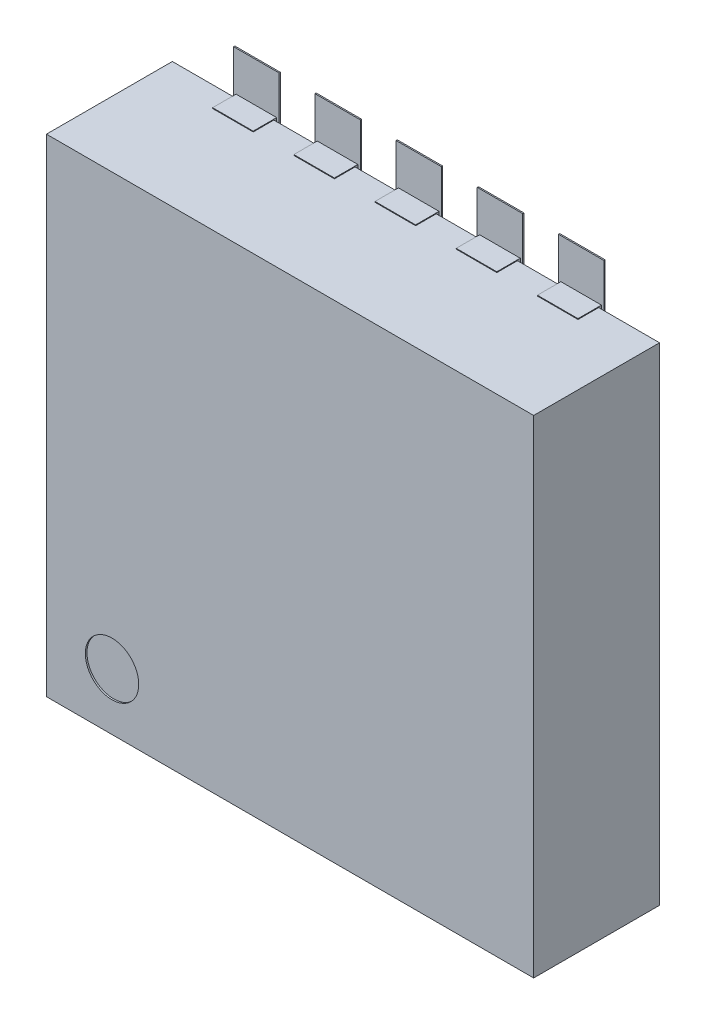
ISO-10303-21;
HEADER;
FILE_DESCRIPTION(('STEP AP214'),'2;1');
FILE_NAME('part.step','',(''),(''),'','','');
FILE_SCHEMA(('AUTOMOTIVE_DESIGN { 1 0 10303 214 1 1 1 1 }'));
ENDSEC;
DATA;
#1=APPLICATION_CONTEXT('core data for automotive mechanical design processes');
#2=APPLICATION_PROTOCOL_DEFINITION('international standard','automotive_design',2000,#1);
#3=PRODUCT_CONTEXT('',#1,'mechanical');
#4=PRODUCT('Part','Part','',(#3));
#5=PRODUCT_RELATED_PRODUCT_CATEGORY('part','',(#4));
#6=PRODUCT_DEFINITION_FORMATION('','',#4);
#7=PRODUCT_DEFINITION_CONTEXT('part definition',#1,'design');
#8=PRODUCT_DEFINITION('design','',#6,#7);
#9=PRODUCT_DEFINITION_SHAPE('','',#8);
#10=(LENGTH_UNIT() NAMED_UNIT(*) SI_UNIT(.MILLI.,.METRE.));
#11=(NAMED_UNIT(*) PLANE_ANGLE_UNIT() SI_UNIT($,.RADIAN.));
#12=(NAMED_UNIT(*) SI_UNIT($,.STERADIAN.) SOLID_ANGLE_UNIT());
#13=UNCERTAINTY_MEASURE_WITH_UNIT(LENGTH_MEASURE(1.E-05),#10,'distance_accuracy_value','');
#14=(GEOMETRIC_REPRESENTATION_CONTEXT(3) GLOBAL_UNCERTAINTY_ASSIGNED_CONTEXT((#13)) GLOBAL_UNIT_ASSIGNED_CONTEXT((#10,
#11,#12)) REPRESENTATION_CONTEXT('',''));
#15=CARTESIAN_POINT('',(0.,0.,0.));
#16=DIRECTION('',(0.,0.,1.));
#17=DIRECTION('',(1.,0.,0.));
#18=AXIS2_PLACEMENT_3D('',#15,#16,#17);
#19=CARTESIAN_POINT('',(0.,0.,0.0762));
#20=DIRECTION('',(0.,0.,1.));
#21=DIRECTION('',(1.,0.,0.));
#22=AXIS2_PLACEMENT_3D('',#19,#20,#21);
#23=PLANE('',#22);
#24=DIRECTION('',(0.,1.,0.));
#25=VECTOR('',#24,1.);
#26=CARTESIAN_POINT('',(-1.35001,0.8750046,0.0762));
#27=LINE('',#26,#25);
#28=CARTESIAN_POINT('',(-1.35001,0.8750046,0.0762));
#29=VERTEX_POINT('',#28);
#30=CARTESIAN_POINT('',(-1.35001,-0.8750046,0.0762));
#31=VERTEX_POINT('',#30);
#32=EDGE_CURVE('E1389',#29,#31,#27,.F.);
#33=ORIENTED_EDGE('',*,*,#32,.F.);
#34=DIRECTION('',(1.,0.,0.));
#35=VECTOR('',#34,1.);
#36=CARTESIAN_POINT('',(1.35001,0.8750046,0.0762));
#37=LINE('',#36,#35);
#38=CARTESIAN_POINT('',(1.35001,0.8750046,0.0762));
#39=VERTEX_POINT('',#38);
#40=EDGE_CURVE('E1394',#39,#29,#37,.F.);
#41=ORIENTED_EDGE('',*,*,#40,.F.);
#42=DIRECTION('',(0.,1.,0.));
#43=VECTOR('',#42,1.);
#44=CARTESIAN_POINT('',(1.35001,-0.8750046,0.0762));
#45=LINE('',#44,#43);
#46=CARTESIAN_POINT('',(1.35001,-0.8750046,0.0762));
#47=VERTEX_POINT('',#46);
#48=EDGE_CURVE('E1375',#47,#39,#45,.T.);
#49=ORIENTED_EDGE('',*,*,#48,.F.);
#50=DIRECTION('',(1.,0.,0.));
#51=VECTOR('',#50,1.);
#52=CARTESIAN_POINT('',(-1.35001,-0.8750046,0.0762));
#53=LINE('',#52,#51);
#54=EDGE_CURVE('E1384',#31,#47,#53,.T.);
#55=ORIENTED_EDGE('',*,*,#54,.F.);
#56=EDGE_LOOP('',(#33,#41,#49,#55));
#57=FACE_BOUND('',#56,.T.);
#58=ADVANCED_FACE('F16',(#57),#23,.F.);
#59=CARTESIAN_POINT('',(0.,0.,0.0762));
#60=DIRECTION('',(0.,0.,1.));
#61=DIRECTION('',(1.,0.,0.));
#62=AXIS2_PLACEMENT_3D('',#59,#60,#61);
#63=PLANE('',#62);
#64=DIRECTION('',(1.,0.,0.));
#65=VECTOR('',#64,1.);
#66=CARTESIAN_POINT('',(-0.3599942,-1.0999978,0.0762));
#67=LINE('',#66,#65);
#68=CARTESIAN_POINT('',(-0.3599942,-1.0999978,0.0762));
#69=VERTEX_POINT('',#68);
#70=CARTESIAN_POINT('',(-0.6400038,-1.0999978,0.0762));
#71=VERTEX_POINT('',#70);
#72=EDGE_CURVE('E1368',#69,#71,#67,.F.);
#73=ORIENTED_EDGE('',*,*,#72,.F.);
#74=DIRECTION('',(0.,1.,0.));
#75=VECTOR('',#74,1.);
#76=CARTESIAN_POINT('',(-0.3599942,-1.7500092,0.0762));
#77=LINE('',#76,#75);
#78=CARTESIAN_POINT('',(-0.3599942,-1.7500092,0.0762));
#79=VERTEX_POINT('',#78);
#80=EDGE_CURVE('E1373',#79,#69,#77,.T.);
#81=ORIENTED_EDGE('',*,*,#80,.F.);
#82=DIRECTION('',(1.,0.,0.));
#83=VECTOR('',#82,1.);
#84=CARTESIAN_POINT('',(-0.6400038,-1.7500092,0.0762));
#85=LINE('',#84,#83);
#86=CARTESIAN_POINT('',(-0.6400038,-1.7500092,0.0762));
#87=VERTEX_POINT('',#86);
#88=EDGE_CURVE('E1354',#87,#79,#85,.T.);
#89=ORIENTED_EDGE('',*,*,#88,.F.);
#90=DIRECTION('',(0.,1.,0.));
#91=VECTOR('',#90,1.);
#92=CARTESIAN_POINT('',(-0.6400038,-1.0999978,0.0762));
#93=LINE('',#92,#91);
#94=EDGE_CURVE('E1363',#71,#87,#93,.F.);
#95=ORIENTED_EDGE('',*,*,#94,.F.);
#96=EDGE_LOOP('',(#73,#81,#89,#95));
#97=FACE_BOUND('',#96,.T.);
#98=ADVANCED_FACE('F3181',(#97),#63,.F.);
#99=CARTESIAN_POINT('',(0.,0.,0.0762));
#100=DIRECTION('',(0.,0.,1.));
#101=DIRECTION('',(1.,0.,0.));
#102=AXIS2_PLACEMENT_3D('',#99,#100,#101);
#103=PLANE('',#102);
#104=DIRECTION('',(1.,0.,0.));
#105=VECTOR('',#104,1.);
#106=CARTESIAN_POINT('',(0.1400048,-1.0999978,0.0762));
#107=LINE('',#106,#105);
#108=CARTESIAN_POINT('',(0.1400048,-1.0999978,0.0762));
#109=VERTEX_POINT('',#108);
#110=CARTESIAN_POINT('',(-0.1400048,-1.0999978,0.0762));
#111=VERTEX_POINT('',#110);
#112=EDGE_CURVE('E1347',#109,#111,#107,.F.);
#113=ORIENTED_EDGE('',*,*,#112,.F.);
#114=DIRECTION('',(0.,1.,0.));
#115=VECTOR('',#114,1.);
#116=CARTESIAN_POINT('',(0.1400048,-1.7500092,0.0762));
#117=LINE('',#116,#115);
#118=CARTESIAN_POINT('',(0.1400048,-1.7500092,0.0762));
#119=VERTEX_POINT('',#118);
#120=EDGE_CURVE('E1352',#119,#109,#117,.T.);
#121=ORIENTED_EDGE('',*,*,#120,.F.);
#122=DIRECTION('',(1.,0.,0.));
#123=VECTOR('',#122,1.);
#124=CARTESIAN_POINT('',(-0.1400048,-1.7500092,0.0762));
#125=LINE('',#124,#123);
#126=CARTESIAN_POINT('',(-0.1400048,-1.7500092,0.0762));
#127=VERTEX_POINT('',#126);
#128=EDGE_CURVE('E1333',#127,#119,#125,.T.);
#129=ORIENTED_EDGE('',*,*,#128,.F.);
#130=DIRECTION('',(0.,1.,0.));
#131=VECTOR('',#130,1.);
#132=CARTESIAN_POINT('',(-0.1400048,-1.0999978,0.0762));
#133=LINE('',#132,#131);
#134=EDGE_CURVE('E1342',#111,#127,#133,.F.);
#135=ORIENTED_EDGE('',*,*,#134,.F.);
#136=EDGE_LOOP('',(#113,#121,#129,#135));
#137=FACE_BOUND('',#136,.T.);
#138=ADVANCED_FACE('F3170',(#137),#103,.F.);
#139=CARTESIAN_POINT('',(0.,0.,0.0762));
#140=DIRECTION('',(0.,0.,1.));
#141=DIRECTION('',(1.,0.,0.));
#142=AXIS2_PLACEMENT_3D('',#139,#140,#141);
#143=PLANE('',#142);
#144=DIRECTION('',(1.,0.,0.));
#145=VECTOR('',#144,1.);
#146=CARTESIAN_POINT('',(0.6400038,-1.0999978,0.0762));
#147=LINE('',#146,#145);
#148=CARTESIAN_POINT('',(0.6400038,-1.0999978,0.0762));
#149=VERTEX_POINT('',#148);
#150=CARTESIAN_POINT('',(0.3599942,-1.0999978,0.0762));
#151=VERTEX_POINT('',#150);
#152=EDGE_CURVE('E1326',#149,#151,#147,.F.);
#153=ORIENTED_EDGE('',*,*,#152,.F.);
#154=DIRECTION('',(0.,1.,0.));
#155=VECTOR('',#154,1.);
#156=CARTESIAN_POINT('',(0.6400038,-1.7500092,0.0762));
#157=LINE('',#156,#155);
#158=CARTESIAN_POINT('',(0.6400038,-1.7500092,0.0762));
#159=VERTEX_POINT('',#158);
#160=EDGE_CURVE('E1331',#159,#149,#157,.T.);
#161=ORIENTED_EDGE('',*,*,#160,.F.);
#162=DIRECTION('',(1.,0.,0.));
#163=VECTOR('',#162,1.);
#164=CARTESIAN_POINT('',(0.3599942,-1.7500092,0.0762));
#165=LINE('',#164,#163);
#166=CARTESIAN_POINT('',(0.3599942,-1.7500092,0.0762));
#167=VERTEX_POINT('',#166);
#168=EDGE_CURVE('E1312',#167,#159,#165,.T.);
#169=ORIENTED_EDGE('',*,*,#168,.F.);
#170=DIRECTION('',(0.,1.,0.));
#171=VECTOR('',#170,1.);
#172=CARTESIAN_POINT('',(0.3599942,-1.0999978,0.0762));
#173=LINE('',#172,#171);
#174=EDGE_CURVE('E1321',#151,#167,#173,.F.);
#175=ORIENTED_EDGE('',*,*,#174,.F.);
#176=EDGE_LOOP('',(#153,#161,#169,#175));
#177=FACE_BOUND('',#176,.T.);
#178=ADVANCED_FACE('F3159',(#177),#143,.F.);
#179=CARTESIAN_POINT('',(0.,0.,0.0762));
#180=DIRECTION('',(0.,0.,1.));
#181=DIRECTION('',(1.,0.,0.));
#182=AXIS2_PLACEMENT_3D('',#179,#180,#181);
#183=PLANE('',#182);
#184=DIRECTION('',(1.,0.,0.));
#185=VECTOR('',#184,1.);
#186=CARTESIAN_POINT('',(1.1400028,-1.0999978,0.0762));
#187=LINE('',#186,#185);
#188=CARTESIAN_POINT('',(1.1400028,-1.0999978,0.0762));
#189=VERTEX_POINT('',#188);
#190=CARTESIAN_POINT('',(0.8599932,-1.0999978,0.0762));
#191=VERTEX_POINT('',#190);
#192=EDGE_CURVE('E1305',#189,#191,#187,.F.);
#193=ORIENTED_EDGE('',*,*,#192,.F.);
#194=DIRECTION('',(0.,1.,0.));
#195=VECTOR('',#194,1.);
#196=CARTESIAN_POINT('',(1.1400028,-1.7500092,0.0762));
#197=LINE('',#196,#195);
#198=CARTESIAN_POINT('',(1.1400028,-1.7500092,0.0762));
#199=VERTEX_POINT('',#198);
#200=EDGE_CURVE('E1310',#199,#189,#197,.T.);
#201=ORIENTED_EDGE('',*,*,#200,.F.);
#202=DIRECTION('',(1.,0.,0.));
#203=VECTOR('',#202,1.);
#204=CARTESIAN_POINT('',(0.8599932,-1.7500092,0.0762));
#205=LINE('',#204,#203);
#206=CARTESIAN_POINT('',(0.8599932,-1.7500092,0.0762));
#207=VERTEX_POINT('',#206);
#208=EDGE_CURVE('E1291',#207,#199,#205,.T.);
#209=ORIENTED_EDGE('',*,*,#208,.F.);
#210=DIRECTION('',(0.,1.,0.));
#211=VECTOR('',#210,1.);
#212=CARTESIAN_POINT('',(0.8599932,-1.0999978,0.0762));
#213=LINE('',#212,#211);
#214=EDGE_CURVE('E1300',#191,#207,#213,.F.);
#215=ORIENTED_EDGE('',*,*,#214,.F.);
#216=EDGE_LOOP('',(#193,#201,#209,#215));
#217=FACE_BOUND('',#216,.T.);
#218=ADVANCED_FACE('F3148',(#217),#183,.F.);
#219=CARTESIAN_POINT('',(0.,0.,0.0762));
#220=DIRECTION('',(0.,0.,1.));
#221=DIRECTION('',(1.,0.,0.));
#222=AXIS2_PLACEMENT_3D('',#219,#220,#221);
#223=PLANE('',#222);
#224=DIRECTION('',(1.,0.,0.));
#225=VECTOR('',#224,1.);
#226=CARTESIAN_POINT('',(-0.8599932,-1.0999978,0.0762));
#227=LINE('',#226,#225);
#228=CARTESIAN_POINT('',(-0.8599932,-1.0999978,0.0762));
#229=VERTEX_POINT('',#228);
#230=CARTESIAN_POINT('',(-1.1400028,-1.0999978,0.0762));
#231=VERTEX_POINT('',#230);
#232=EDGE_CURVE('E1284',#229,#231,#227,.F.);
#233=ORIENTED_EDGE('',*,*,#232,.F.);
#234=DIRECTION('',(0.,1.,0.));
#235=VECTOR('',#234,1.);
#236=CARTESIAN_POINT('',(-0.8599932,-1.7500092,0.0762));
#237=LINE('',#236,#235);
#238=CARTESIAN_POINT('',(-0.8599932,-1.7500092,0.0762));
#239=VERTEX_POINT('',#238);
#240=EDGE_CURVE('E1289',#239,#229,#237,.T.);
#241=ORIENTED_EDGE('',*,*,#240,.F.);
#242=DIRECTION('',(1.,0.,0.));
#243=VECTOR('',#242,1.);
#244=CARTESIAN_POINT('',(-1.1400028,-1.7500092,0.0762));
#245=LINE('',#244,#243);
#246=CARTESIAN_POINT('',(-1.1400028,-1.7500092,0.0762));
#247=VERTEX_POINT('',#246);
#248=EDGE_CURVE('E1270',#247,#239,#245,.T.);
#249=ORIENTED_EDGE('',*,*,#248,.F.);
#250=DIRECTION('',(0.,1.,0.));
#251=VECTOR('',#250,1.);
#252=CARTESIAN_POINT('',(-1.1400028,-1.0999978,0.0762));
#253=LINE('',#252,#251);
#254=EDGE_CURVE('E1279',#231,#247,#253,.F.);
#255=ORIENTED_EDGE('',*,*,#254,.F.);
#256=EDGE_LOOP('',(#233,#241,#249,#255));
#257=FACE_BOUND('',#256,.T.);
#258=ADVANCED_FACE('F3137',(#257),#223,.F.);
#259=CARTESIAN_POINT('',(0.,0.,0.0762));
#260=DIRECTION('',(0.,0.,1.));
#261=DIRECTION('',(1.,0.,0.));
#262=AXIS2_PLACEMENT_3D('',#259,#260,#261);
#263=PLANE('',#262);
#264=DIRECTION('',(0.,1.,0.));
#265=VECTOR('',#264,1.);
#266=CARTESIAN_POINT('',(0.8599932,1.7500092,0.0762));
#267=LINE('',#266,#265);
#268=CARTESIAN_POINT('',(0.8599932,1.7500092,0.0762));
#269=VERTEX_POINT('',#268);
#270=CARTESIAN_POINT('',(0.8599932,1.0999978,0.0762));
#271=VERTEX_POINT('',#270);
#272=EDGE_CURVE('E1263',#269,#271,#267,.F.);
#273=ORIENTED_EDGE('',*,*,#272,.F.);
#274=DIRECTION('',(1.,0.,0.));
#275=VECTOR('',#274,1.);
#276=CARTESIAN_POINT('',(1.1400028,1.7500092,0.0762));
#277=LINE('',#276,#275);
#278=CARTESIAN_POINT('',(1.1400028,1.7500092,0.0762));
#279=VERTEX_POINT('',#278);
#280=EDGE_CURVE('E1268',#279,#269,#277,.F.);
#281=ORIENTED_EDGE('',*,*,#280,.F.);
#282=DIRECTION('',(0.,1.,0.));
#283=VECTOR('',#282,1.);
#284=CARTESIAN_POINT('',(1.1400028,1.0999978,0.0762));
#285=LINE('',#284,#283);
#286=CARTESIAN_POINT('',(1.1400028,1.0999978,0.0762));
#287=VERTEX_POINT('',#286);
#288=EDGE_CURVE('E1249',#287,#279,#285,.T.);
#289=ORIENTED_EDGE('',*,*,#288,.F.);
#290=DIRECTION('',(1.,0.,0.));
#291=VECTOR('',#290,1.);
#292=CARTESIAN_POINT('',(0.8599932,1.0999978,0.0762));
#293=LINE('',#292,#291);
#294=EDGE_CURVE('E1258',#271,#287,#293,.T.);
#295=ORIENTED_EDGE('',*,*,#294,.F.);
#296=EDGE_LOOP('',(#273,#281,#289,#295));
#297=FACE_BOUND('',#296,.T.);
#298=ADVANCED_FACE('F3126',(#297),#263,.F.);
#299=CARTESIAN_POINT('',(0.,0.,0.0762));
#300=DIRECTION('',(0.,0.,1.));
#301=DIRECTION('',(1.,0.,0.));
#302=AXIS2_PLACEMENT_3D('',#299,#300,#301);
#303=PLANE('',#302);
#304=DIRECTION('',(1.,0.,0.));
#305=VECTOR('',#304,1.);
#306=CARTESIAN_POINT('',(0.3599942,1.0999978,0.0762));
#307=LINE('',#306,#305);
#308=CARTESIAN_POINT('',(0.3599942,1.0999978,0.0762));
#309=VERTEX_POINT('',#308);
#310=CARTESIAN_POINT('',(0.6400038,1.0999978,0.0762));
#311=VERTEX_POINT('',#310);
#312=EDGE_CURVE('E1242',#309,#311,#307,.T.);
#313=ORIENTED_EDGE('',*,*,#312,.F.);
#314=DIRECTION('',(0.,1.,0.));
#315=VECTOR('',#314,1.);
#316=CARTESIAN_POINT('',(0.3599942,1.7500092,0.0762));
#317=LINE('',#316,#315);
#318=CARTESIAN_POINT('',(0.3599942,1.7500092,0.0762));
#319=VERTEX_POINT('',#318);
#320=EDGE_CURVE('E1247',#319,#309,#317,.F.);
#321=ORIENTED_EDGE('',*,*,#320,.F.);
#322=DIRECTION('',(1.,0.,0.));
#323=VECTOR('',#322,1.);
#324=CARTESIAN_POINT('',(0.6400038,1.7500092,0.0762));
#325=LINE('',#324,#323);
#326=CARTESIAN_POINT('',(0.6400038,1.7500092,0.0762));
#327=VERTEX_POINT('',#326);
#328=EDGE_CURVE('E1228',#327,#319,#325,.F.);
#329=ORIENTED_EDGE('',*,*,#328,.F.);
#330=DIRECTION('',(0.,1.,0.));
#331=VECTOR('',#330,1.);
#332=CARTESIAN_POINT('',(0.6400038,1.0999978,0.0762));
#333=LINE('',#332,#331);
#334=EDGE_CURVE('E1237',#311,#327,#333,.T.);
#335=ORIENTED_EDGE('',*,*,#334,.F.);
#336=EDGE_LOOP('',(#313,#321,#329,#335));
#337=FACE_BOUND('',#336,.T.);
#338=ADVANCED_FACE('F3115',(#337),#303,.F.);
#339=CARTESIAN_POINT('',(0.,0.,0.0762));
#340=DIRECTION('',(0.,0.,1.));
#341=DIRECTION('',(1.,0.,0.));
#342=AXIS2_PLACEMENT_3D('',#339,#340,#341);
#343=PLANE('',#342);
#344=DIRECTION('',(1.,0.,0.));
#345=VECTOR('',#344,1.);
#346=CARTESIAN_POINT('',(-0.1400048,1.0999978,0.0762));
#347=LINE('',#346,#345);
#348=CARTESIAN_POINT('',(-0.1400048,1.0999978,0.0762));
#349=VERTEX_POINT('',#348);
#350=CARTESIAN_POINT('',(0.1400048,1.0999978,0.0762));
#351=VERTEX_POINT('',#350);
#352=EDGE_CURVE('E1221',#349,#351,#347,.T.);
#353=ORIENTED_EDGE('',*,*,#352,.F.);
#354=DIRECTION('',(0.,1.,0.));
#355=VECTOR('',#354,1.);
#356=CARTESIAN_POINT('',(-0.1400048,1.7500092,0.0762));
#357=LINE('',#356,#355);
#358=CARTESIAN_POINT('',(-0.1400048,1.7500092,0.0762));
#359=VERTEX_POINT('',#358);
#360=EDGE_CURVE('E1226',#359,#349,#357,.F.);
#361=ORIENTED_EDGE('',*,*,#360,.F.);
#362=DIRECTION('',(1.,0.,0.));
#363=VECTOR('',#362,1.);
#364=CARTESIAN_POINT('',(0.1400048,1.7500092,0.0762));
#365=LINE('',#364,#363);
#366=CARTESIAN_POINT('',(0.1400048,1.7500092,0.0762));
#367=VERTEX_POINT('',#366);
#368=EDGE_CURVE('E1207',#367,#359,#365,.F.);
#369=ORIENTED_EDGE('',*,*,#368,.F.);
#370=DIRECTION('',(0.,1.,0.));
#371=VECTOR('',#370,1.);
#372=CARTESIAN_POINT('',(0.1400048,1.0999978,0.0762));
#373=LINE('',#372,#371);
#374=EDGE_CURVE('E1216',#351,#367,#373,.T.);
#375=ORIENTED_EDGE('',*,*,#374,.F.);
#376=EDGE_LOOP('',(#353,#361,#369,#375));
#377=FACE_BOUND('',#376,.T.);
#378=ADVANCED_FACE('F3104',(#377),#343,.F.);
#379=CARTESIAN_POINT('',(0.,0.,0.0762));
#380=DIRECTION('',(0.,0.,1.));
#381=DIRECTION('',(1.,0.,0.));
#382=AXIS2_PLACEMENT_3D('',#379,#380,#381);
#383=PLANE('',#382);
#384=DIRECTION('',(1.,0.,0.));
#385=VECTOR('',#384,1.);
#386=CARTESIAN_POINT('',(-0.6400038,1.0999978,0.0762));
#387=LINE('',#386,#385);
#388=CARTESIAN_POINT('',(-0.6400038,1.0999978,0.0762));
#389=VERTEX_POINT('',#388);
#390=CARTESIAN_POINT('',(-0.3599942,1.0999978,0.0762));
#391=VERTEX_POINT('',#390);
#392=EDGE_CURVE('E1200',#389,#391,#387,.T.);
#393=ORIENTED_EDGE('',*,*,#392,.F.);
#394=DIRECTION('',(0.,1.,0.));
#395=VECTOR('',#394,1.);
#396=CARTESIAN_POINT('',(-0.6400038,1.7500092,0.0762));
#397=LINE('',#396,#395);
#398=CARTESIAN_POINT('',(-0.6400038,1.7500092,0.0762));
#399=VERTEX_POINT('',#398);
#400=EDGE_CURVE('E1205',#399,#389,#397,.F.);
#401=ORIENTED_EDGE('',*,*,#400,.F.);
#402=DIRECTION('',(1.,0.,0.));
#403=VECTOR('',#402,1.);
#404=CARTESIAN_POINT('',(-0.3599942,1.7500092,0.0762));
#405=LINE('',#404,#403);
#406=CARTESIAN_POINT('',(-0.3599942,1.7500092,0.0762));
#407=VERTEX_POINT('',#406);
#408=EDGE_CURVE('E1186',#407,#399,#405,.F.);
#409=ORIENTED_EDGE('',*,*,#408,.F.);
#410=DIRECTION('',(0.,1.,0.));
#411=VECTOR('',#410,1.);
#412=CARTESIAN_POINT('',(-0.3599942,1.0999978,0.0762));
#413=LINE('',#412,#411);
#414=EDGE_CURVE('E1195',#391,#407,#413,.T.);
#415=ORIENTED_EDGE('',*,*,#414,.F.);
#416=EDGE_LOOP('',(#393,#401,#409,#415));
#417=FACE_BOUND('',#416,.T.);
#418=ADVANCED_FACE('F3093',(#417),#383,.F.);
#419=CARTESIAN_POINT('',(0.,0.,0.0762));
#420=DIRECTION('',(0.,0.,1.));
#421=DIRECTION('',(1.,0.,0.));
#422=AXIS2_PLACEMENT_3D('',#419,#420,#421);
#423=PLANE('',#422);
#424=DIRECTION('',(1.,0.,0.));
#425=VECTOR('',#424,1.);
#426=CARTESIAN_POINT('',(-1.1400028,1.0999978,0.0762));
#427=LINE('',#426,#425);
#428=CARTESIAN_POINT('',(-1.1400028,1.0999978,0.0762));
#429=VERTEX_POINT('',#428);
#430=CARTESIAN_POINT('',(-0.8599932,1.0999978,0.0762));
#431=VERTEX_POINT('',#430);
#432=EDGE_CURVE('E1179',#429,#431,#427,.T.);
#433=ORIENTED_EDGE('',*,*,#432,.F.);
#434=DIRECTION('',(0.,1.,0.));
#435=VECTOR('',#434,1.);
#436=CARTESIAN_POINT('',(-1.1400028,1.7500092,0.0762));
#437=LINE('',#436,#435);
#438=CARTESIAN_POINT('',(-1.1400028,1.7500092,0.0762));
#439=VERTEX_POINT('',#438);
#440=EDGE_CURVE('E1184',#439,#429,#437,.F.);
#441=ORIENTED_EDGE('',*,*,#440,.F.);
#442=DIRECTION('',(1.,0.,0.));
#443=VECTOR('',#442,1.);
#444=CARTESIAN_POINT('',(-0.8599932,1.7500092,0.0762));
#445=LINE('',#444,#443);
#446=CARTESIAN_POINT('',(-0.8599932,1.7500092,0.0762));
#447=VERTEX_POINT('',#446);
#448=EDGE_CURVE('E1165',#447,#439,#445,.F.);
#449=ORIENTED_EDGE('',*,*,#448,.F.);
#450=DIRECTION('',(0.,1.,0.));
#451=VECTOR('',#450,1.);
#452=CARTESIAN_POINT('',(-0.8599932,1.0999978,0.0762));
#453=LINE('',#452,#451);
#454=EDGE_CURVE('E1174',#431,#447,#453,.T.);
#455=ORIENTED_EDGE('',*,*,#454,.F.);
#456=EDGE_LOOP('',(#433,#441,#449,#455));
#457=FACE_BOUND('',#456,.T.);
#458=ADVANCED_FACE('F3082',(#457),#423,.F.);
#459=CARTESIAN_POINT('',(1.35001,0.8750046,0.0762));
#460=DIRECTION('',(0.,1.,0.));
#461=DIRECTION('',(0.,0.,1.));
#462=AXIS2_PLACEMENT_3D('',#459,#460,#461);
#463=PLANE('',#462);
#464=DIRECTION('',(0.,0.,-1.));
#465=VECTOR('',#464,1.);
#466=CARTESIAN_POINT('',(1.35001,0.8750046,0.0762));
#467=LINE('',#466,#465);
#468=CARTESIAN_POINT('',(1.35001,0.8750046,0.08382));
#469=VERTEX_POINT('',#468);
#470=EDGE_CURVE('E1381',#39,#469,#467,.F.);
#471=ORIENTED_EDGE('',*,*,#470,.F.);
#472=ORIENTED_EDGE('',*,*,#40,.T.);
#473=DIRECTION('',(0.,0.,1.));
#474=VECTOR('',#473,1.);
#475=CARTESIAN_POINT('',(-1.35001,0.8750046,0.0762));
#476=LINE('',#475,#474);
#477=CARTESIAN_POINT('',(-1.35001,0.8750046,0.08382));
#478=VERTEX_POINT('',#477);
#479=EDGE_CURVE('E1391',#478,#29,#476,.F.);
#480=ORIENTED_EDGE('',*,*,#479,.F.);
#481=DIRECTION('',(1.,0.,0.));
#482=VECTOR('',#481,1.);
#483=CARTESIAN_POINT('',(0.,0.8750046,0.08382));
#484=LINE('',#483,#482);
#485=EDGE_CURVE('E1162',#469,#478,#484,.F.);
#486=ORIENTED_EDGE('',*,*,#485,.F.);
#487=EDGE_LOOP('',(#471,#472,#480,#486));
#488=FACE_BOUND('',#487,.T.);
#489=ADVANCED_FACE('F3071',(#488),#463,.T.);
#490=CARTESIAN_POINT('',(-1.35001,0.8750046,0.0762));
#491=DIRECTION('',(-1.,0.,0.));
#492=DIRECTION('',(0.,0.,1.));
#493=AXIS2_PLACEMENT_3D('',#490,#491,#492);
#494=PLANE('',#493);
#495=ORIENTED_EDGE('',*,*,#479,.T.);
#496=ORIENTED_EDGE('',*,*,#32,.T.);
#497=DIRECTION('',(0.,0.,-1.));
#498=VECTOR('',#497,1.);
#499=CARTESIAN_POINT('',(-1.35001,-0.8750046,0.0762));
#500=LINE('',#499,#498);
#501=CARTESIAN_POINT('',(-1.35001,-0.8750046,0.08382));
#502=VERTEX_POINT('',#501);
#503=EDGE_CURVE('E1386',#502,#31,#500,.T.);
#504=ORIENTED_EDGE('',*,*,#503,.F.);
#505=DIRECTION('',(0.,1.,0.));
#506=VECTOR('',#505,1.);
#507=CARTESIAN_POINT('',(-1.35001,0.,0.08382));
#508=LINE('',#507,#506);
#509=EDGE_CURVE('E1159',#478,#502,#508,.F.);
#510=ORIENTED_EDGE('',*,*,#509,.F.);
#511=EDGE_LOOP('',(#495,#496,#504,#510));
#512=FACE_BOUND('',#511,.T.);
#513=ADVANCED_FACE('F3060',(#512),#494,.T.);
#514=CARTESIAN_POINT('',(-1.35001,-0.8750046,0.0762));
#515=DIRECTION('',(0.,-1.,0.));
#516=DIRECTION('',(0.,0.,-1.));
#517=AXIS2_PLACEMENT_3D('',#514,#515,#516);
#518=PLANE('',#517);
#519=ORIENTED_EDGE('',*,*,#503,.T.);
#520=ORIENTED_EDGE('',*,*,#54,.T.);
#521=DIRECTION('',(0.,0.,-1.));
#522=VECTOR('',#521,1.);
#523=CARTESIAN_POINT('',(1.35001,-0.8750046,0.0762));
#524=LINE('',#523,#522);
#525=CARTESIAN_POINT('',(1.35001,-0.8750046,0.08382));
#526=VERTEX_POINT('',#525);
#527=EDGE_CURVE('E1378',#526,#47,#524,.T.);
#528=ORIENTED_EDGE('',*,*,#527,.F.);
#529=DIRECTION('',(1.,0.,0.));
#530=VECTOR('',#529,1.);
#531=CARTESIAN_POINT('',(0.,-0.8750046,0.08382));
#532=LINE('',#531,#530);
#533=EDGE_CURVE('E1156',#502,#526,#532,.T.);
#534=ORIENTED_EDGE('',*,*,#533,.F.);
#535=EDGE_LOOP('',(#519,#520,#528,#534));
#536=FACE_BOUND('',#535,.T.);
#537=ADVANCED_FACE('F3049',(#536),#518,.T.);
#538=CARTESIAN_POINT('',(1.35001,-0.8750046,0.0762));
#539=DIRECTION('',(1.,0.,0.));
#540=DIRECTION('',(0.,0.,-1.));
#541=AXIS2_PLACEMENT_3D('',#538,#539,#540);
#542=PLANE('',#541);
#543=ORIENTED_EDGE('',*,*,#527,.T.);
#544=ORIENTED_EDGE('',*,*,#48,.T.);
#545=ORIENTED_EDGE('',*,*,#470,.T.);
#546=DIRECTION('',(0.,1.,0.));
#547=VECTOR('',#546,1.);
#548=CARTESIAN_POINT('',(1.35001,0.,0.08382));
#549=LINE('',#548,#547);
#550=EDGE_CURVE('E1153',#526,#469,#549,.T.);
#551=ORIENTED_EDGE('',*,*,#550,.F.);
#552=EDGE_LOOP('',(#543,#544,#545,#551));
#553=FACE_BOUND('',#552,.T.);
#554=ADVANCED_FACE('F3038',(#553),#542,.T.);
#555=CARTESIAN_POINT('',(-0.3599942,-1.7500092,0.0762));
#556=DIRECTION('',(1.,0.,0.));
#557=DIRECTION('',(0.,0.,-1.));
#558=AXIS2_PLACEMENT_3D('',#555,#556,#557);
#559=PLANE('',#558);
#560=DIRECTION('',(0.,0.,-1.));
#561=VECTOR('',#560,1.);
#562=CARTESIAN_POINT('',(-0.3599942,-1.7500092,0.0762));
#563=LINE('',#562,#561);
#564=CARTESIAN_POINT('',(-0.3599942,-1.7500092,0.08382));
#565=VERTEX_POINT('',#564);
#566=EDGE_CURVE('E1360',#79,#565,#563,.F.);
#567=ORIENTED_EDGE('',*,*,#566,.F.);
#568=ORIENTED_EDGE('',*,*,#80,.T.);
#569=DIRECTION('',(0.,0.,1.));
#570=VECTOR('',#569,1.);
#571=CARTESIAN_POINT('',(-0.3599942,-1.0999978,0.0762));
#572=LINE('',#571,#570);
#573=CARTESIAN_POINT('',(-0.3599942,-1.0999978,0.08382));
#574=VERTEX_POINT('',#573);
#575=EDGE_CURVE('E1370',#574,#69,#572,.F.);
#576=ORIENTED_EDGE('',*,*,#575,.F.);
#577=DIRECTION('',(0.,1.,0.));
#578=VECTOR('',#577,1.);
#579=CARTESIAN_POINT('',(-0.3599942,0.,0.08382));
#580=LINE('',#579,#578);
#581=EDGE_CURVE('E1089',#565,#574,#580,.T.);
#582=ORIENTED_EDGE('',*,*,#581,.F.);
#583=EDGE_LOOP('',(#567,#568,#576,#582));
#584=FACE_BOUND('',#583,.T.);
#585=ADVANCED_FACE('F3027',(#584),#559,.T.);
#586=CARTESIAN_POINT('',(-0.3599942,-1.0999978,0.0762));
#587=DIRECTION('',(0.,1.,0.));
#588=DIRECTION('',(0.,0.,1.));
#589=AXIS2_PLACEMENT_3D('',#586,#587,#588);
#590=PLANE('',#589);
#591=ORIENTED_EDGE('',*,*,#575,.T.);
#592=ORIENTED_EDGE('',*,*,#72,.T.);
#593=DIRECTION('',(0.,0.,1.));
#594=VECTOR('',#593,1.);
#595=CARTESIAN_POINT('',(-0.6400038,-1.0999978,0.0762));
#596=LINE('',#595,#594);
#597=CARTESIAN_POINT('',(-0.6400038,-1.0999978,0.08382));
#598=VERTEX_POINT('',#597);
#599=EDGE_CURVE('E1365',#598,#71,#596,.F.);
#600=ORIENTED_EDGE('',*,*,#599,.F.);
#601=DIRECTION('',(1.,0.,0.));
#602=VECTOR('',#601,1.);
#603=CARTESIAN_POINT('',(0.,-1.0999978,0.08382));
#604=LINE('',#603,#602);
#605=EDGE_CURVE('E1086',#574,#598,#604,.F.);
#606=ORIENTED_EDGE('',*,*,#605,.F.);
#607=EDGE_LOOP('',(#591,#592,#600,#606));
#608=FACE_BOUND('',#607,.T.);
#609=ADVANCED_FACE('F3016',(#608),#590,.T.);
#610=CARTESIAN_POINT('',(-0.6400038,-1.0999978,0.0762));
#611=DIRECTION('',(-1.,0.,0.));
#612=DIRECTION('',(0.,0.,1.));
#613=AXIS2_PLACEMENT_3D('',#610,#611,#612);
#614=PLANE('',#613);
#615=ORIENTED_EDGE('',*,*,#599,.T.);
#616=ORIENTED_EDGE('',*,*,#94,.T.);
#617=DIRECTION('',(0.,0.,-1.));
#618=VECTOR('',#617,1.);
#619=CARTESIAN_POINT('',(-0.6400038,-1.7500092,0.0762));
#620=LINE('',#619,#618);
#621=CARTESIAN_POINT('',(-0.6400038,-1.7500092,0.08382));
#622=VERTEX_POINT('',#621);
#623=EDGE_CURVE('E1357',#622,#87,#620,.T.);
#624=ORIENTED_EDGE('',*,*,#623,.F.);
#625=DIRECTION('',(0.,1.,0.));
#626=VECTOR('',#625,1.);
#627=CARTESIAN_POINT('',(-0.6400038,0.,0.08382));
#628=LINE('',#627,#626);
#629=EDGE_CURVE('E1083',#598,#622,#628,.F.);
#630=ORIENTED_EDGE('',*,*,#629,.F.);
#631=EDGE_LOOP('',(#615,#616,#624,#630));
#632=FACE_BOUND('',#631,.T.);
#633=ADVANCED_FACE('F3005',(#632),#614,.T.);
#634=CARTESIAN_POINT('',(-0.6400038,-1.7500092,0.0762));
#635=DIRECTION('',(0.,-1.,0.));
#636=DIRECTION('',(0.,0.,-1.));
#637=AXIS2_PLACEMENT_3D('',#634,#635,#636);
#638=PLANE('',#637);
#639=ORIENTED_EDGE('',*,*,#623,.T.);
#640=ORIENTED_EDGE('',*,*,#88,.T.);
#641=ORIENTED_EDGE('',*,*,#566,.T.);
#642=DIRECTION('',(1.,0.,0.));
#643=VECTOR('',#642,1.);
#644=CARTESIAN_POINT('',(0.,-1.7500092,0.08382));
#645=LINE('',#644,#643);
#646=EDGE_CURVE('E1080',#622,#565,#645,.T.);
#647=ORIENTED_EDGE('',*,*,#646,.F.);
#648=EDGE_LOOP('',(#639,#640,#641,#647));
#649=FACE_BOUND('',#648,.T.);
#650=ADVANCED_FACE('F2994',(#649),#638,.T.);
#651=CARTESIAN_POINT('',(0.1400048,-1.7500092,0.0762));
#652=DIRECTION('',(1.,0.,0.));
#653=DIRECTION('',(0.,0.,-1.));
#654=AXIS2_PLACEMENT_3D('',#651,#652,#653);
#655=PLANE('',#654);
#656=DIRECTION('',(0.,0.,-1.));
#657=VECTOR('',#656,1.);
#658=CARTESIAN_POINT('',(0.1400048,-1.7500092,0.0762));
#659=LINE('',#658,#657);
#660=CARTESIAN_POINT('',(0.1400048,-1.7500092,0.08382));
#661=VERTEX_POINT('',#660);
#662=EDGE_CURVE('E1339',#119,#661,#659,.F.);
#663=ORIENTED_EDGE('',*,*,#662,.F.);
#664=ORIENTED_EDGE('',*,*,#120,.T.);
#665=DIRECTION('',(0.,0.,1.));
#666=VECTOR('',#665,1.);
#667=CARTESIAN_POINT('',(0.1400048,-1.0999978,0.0762));
#668=LINE('',#667,#666);
#669=CARTESIAN_POINT('',(0.1400048,-1.0999978,0.08382));
#670=VERTEX_POINT('',#669);
#671=EDGE_CURVE('E1349',#670,#109,#668,.F.);
#672=ORIENTED_EDGE('',*,*,#671,.F.);
#673=DIRECTION('',(0.,1.,0.));
#674=VECTOR('',#673,1.);
#675=CARTESIAN_POINT('',(0.1400048,0.,0.08382));
#676=LINE('',#675,#674);
#677=EDGE_CURVE('E1031',#661,#670,#676,.T.);
#678=ORIENTED_EDGE('',*,*,#677,.F.);
#679=EDGE_LOOP('',(#663,#664,#672,#678));
#680=FACE_BOUND('',#679,.T.);
#681=ADVANCED_FACE('F2983',(#680),#655,.T.);
#682=CARTESIAN_POINT('',(0.1400048,-1.0999978,0.0762));
#683=DIRECTION('',(0.,1.,0.));
#684=DIRECTION('',(0.,0.,1.));
#685=AXIS2_PLACEMENT_3D('',#682,#683,#684);
#686=PLANE('',#685);
#687=ORIENTED_EDGE('',*,*,#671,.T.);
#688=ORIENTED_EDGE('',*,*,#112,.T.);
#689=DIRECTION('',(0.,0.,1.));
#690=VECTOR('',#689,1.);
#691=CARTESIAN_POINT('',(-0.1400048,-1.0999978,0.0762));
#692=LINE('',#691,#690);
#693=CARTESIAN_POINT('',(-0.1400048,-1.0999978,0.08382));
#694=VERTEX_POINT('',#693);
#695=EDGE_CURVE('E1344',#694,#111,#692,.F.);
#696=ORIENTED_EDGE('',*,*,#695,.F.);
#697=DIRECTION('',(1.,0.,0.));
#698=VECTOR('',#697,1.);
#699=CARTESIAN_POINT('',(0.,-1.0999978,0.08382));
#700=LINE('',#699,#698);
#701=EDGE_CURVE('E1028',#670,#694,#700,.F.);
#702=ORIENTED_EDGE('',*,*,#701,.F.);
#703=EDGE_LOOP('',(#687,#688,#696,#702));
#704=FACE_BOUND('',#703,.T.);
#705=ADVANCED_FACE('F2972',(#704),#686,.T.);
#706=CARTESIAN_POINT('',(-0.1400048,-1.0999978,0.0762));
#707=DIRECTION('',(-1.,0.,0.));
#708=DIRECTION('',(0.,0.,1.));
#709=AXIS2_PLACEMENT_3D('',#706,#707,#708);
#710=PLANE('',#709);
#711=ORIENTED_EDGE('',*,*,#695,.T.);
#712=ORIENTED_EDGE('',*,*,#134,.T.);
#713=DIRECTION('',(0.,0.,-1.));
#714=VECTOR('',#713,1.);
#715=CARTESIAN_POINT('',(-0.1400048,-1.7500092,0.0762));
#716=LINE('',#715,#714);
#717=CARTESIAN_POINT('',(-0.1400048,-1.7500092,0.08382));
#718=VERTEX_POINT('',#717);
#719=EDGE_CURVE('E1336',#718,#127,#716,.T.);
#720=ORIENTED_EDGE('',*,*,#719,.F.);
#721=DIRECTION('',(0.,1.,0.));
#722=VECTOR('',#721,1.);
#723=CARTESIAN_POINT('',(-0.1400048,0.,0.08382));
#724=LINE('',#723,#722);
#725=EDGE_CURVE('E1025',#694,#718,#724,.F.);
#726=ORIENTED_EDGE('',*,*,#725,.F.);
#727=EDGE_LOOP('',(#711,#712,#720,#726));
#728=FACE_BOUND('',#727,.T.);
#729=ADVANCED_FACE('F2961',(#728),#710,.T.);
#730=CARTESIAN_POINT('',(-0.1400048,-1.7500092,0.0762));
#731=DIRECTION('',(0.,-1.,0.));
#732=DIRECTION('',(0.,0.,-1.));
#733=AXIS2_PLACEMENT_3D('',#730,#731,#732);
#734=PLANE('',#733);
#735=ORIENTED_EDGE('',*,*,#719,.T.);
#736=ORIENTED_EDGE('',*,*,#128,.T.);
#737=ORIENTED_EDGE('',*,*,#662,.T.);
#738=DIRECTION('',(1.,0.,0.));
#739=VECTOR('',#738,1.);
#740=CARTESIAN_POINT('',(0.,-1.7500092,0.08382));
#741=LINE('',#740,#739);
#742=EDGE_CURVE('E1022',#718,#661,#741,.T.);
#743=ORIENTED_EDGE('',*,*,#742,.F.);
#744=EDGE_LOOP('',(#735,#736,#737,#743));
#745=FACE_BOUND('',#744,.T.);
#746=ADVANCED_FACE('F2950',(#745),#734,.T.);
#747=CARTESIAN_POINT('',(0.6400038,-1.7500092,0.0762));
#748=DIRECTION('',(1.,0.,0.));
#749=DIRECTION('',(0.,0.,-1.));
#750=AXIS2_PLACEMENT_3D('',#747,#748,#749);
#751=PLANE('',#750);
#752=DIRECTION('',(0.,0.,-1.));
#753=VECTOR('',#752,1.);
#754=CARTESIAN_POINT('',(0.6400038,-1.7500092,0.0762));
#755=LINE('',#754,#753);
#756=CARTESIAN_POINT('',(0.6400038,-1.7500092,0.08382));
#757=VERTEX_POINT('',#756);
#758=EDGE_CURVE('E1318',#159,#757,#755,.F.);
#759=ORIENTED_EDGE('',*,*,#758,.F.);
#760=ORIENTED_EDGE('',*,*,#160,.T.);
#761=DIRECTION('',(0.,0.,1.));
#762=VECTOR('',#761,1.);
#763=CARTESIAN_POINT('',(0.6400038,-1.0999978,0.0762));
#764=LINE('',#763,#762);
#765=CARTESIAN_POINT('',(0.6400038,-1.0999978,0.08382));
#766=VERTEX_POINT('',#765);
#767=EDGE_CURVE('E1328',#766,#149,#764,.F.);
#768=ORIENTED_EDGE('',*,*,#767,.F.);
#769=DIRECTION('',(0.,1.,0.));
#770=VECTOR('',#769,1.);
#771=CARTESIAN_POINT('',(0.6400038,0.,0.08382));
#772=LINE('',#771,#770);
#773=EDGE_CURVE('E973',#757,#766,#772,.T.);
#774=ORIENTED_EDGE('',*,*,#773,.F.);
#775=EDGE_LOOP('',(#759,#760,#768,#774));
#776=FACE_BOUND('',#775,.T.);
#777=ADVANCED_FACE('F2939',(#776),#751,.T.);
#778=CARTESIAN_POINT('',(0.6400038,-1.0999978,0.0762));
#779=DIRECTION('',(0.,1.,0.));
#780=DIRECTION('',(0.,0.,1.));
#781=AXIS2_PLACEMENT_3D('',#778,#779,#780);
#782=PLANE('',#781);
#783=ORIENTED_EDGE('',*,*,#767,.T.);
#784=ORIENTED_EDGE('',*,*,#152,.T.);
#785=DIRECTION('',(0.,0.,1.));
#786=VECTOR('',#785,1.);
#787=CARTESIAN_POINT('',(0.3599942,-1.0999978,0.0762));
#788=LINE('',#787,#786);
#789=CARTESIAN_POINT('',(0.3599942,-1.0999978,0.08382));
#790=VERTEX_POINT('',#789);
#791=EDGE_CURVE('E1323',#790,#151,#788,.F.);
#792=ORIENTED_EDGE('',*,*,#791,.F.);
#793=DIRECTION('',(1.,0.,0.));
#794=VECTOR('',#793,1.);
#795=CARTESIAN_POINT('',(0.,-1.0999978,0.08382));
#796=LINE('',#795,#794);
#797=EDGE_CURVE('E970',#766,#790,#796,.F.);
#798=ORIENTED_EDGE('',*,*,#797,.F.);
#799=EDGE_LOOP('',(#783,#784,#792,#798));
#800=FACE_BOUND('',#799,.T.);
#801=ADVANCED_FACE('F2928',(#800),#782,.T.);
#802=CARTESIAN_POINT('',(0.3599942,-1.0999978,0.0762));
#803=DIRECTION('',(-1.,0.,0.));
#804=DIRECTION('',(0.,0.,1.));
#805=AXIS2_PLACEMENT_3D('',#802,#803,#804);
#806=PLANE('',#805);
#807=ORIENTED_EDGE('',*,*,#791,.T.);
#808=ORIENTED_EDGE('',*,*,#174,.T.);
#809=DIRECTION('',(0.,0.,-1.));
#810=VECTOR('',#809,1.);
#811=CARTESIAN_POINT('',(0.3599942,-1.7500092,0.0762));
#812=LINE('',#811,#810);
#813=CARTESIAN_POINT('',(0.3599942,-1.7500092,0.08382));
#814=VERTEX_POINT('',#813);
#815=EDGE_CURVE('E1315',#814,#167,#812,.T.);
#816=ORIENTED_EDGE('',*,*,#815,.F.);
#817=DIRECTION('',(0.,1.,0.));
#818=VECTOR('',#817,1.);
#819=CARTESIAN_POINT('',(0.3599942,0.,0.08382));
#820=LINE('',#819,#818);
#821=EDGE_CURVE('E967',#790,#814,#820,.F.);
#822=ORIENTED_EDGE('',*,*,#821,.F.);
#823=EDGE_LOOP('',(#807,#808,#816,#822));
#824=FACE_BOUND('',#823,.T.);
#825=ADVANCED_FACE('F2917',(#824),#806,.T.);
#826=CARTESIAN_POINT('',(0.3599942,-1.7500092,0.0762));
#827=DIRECTION('',(0.,-1.,0.));
#828=DIRECTION('',(0.,0.,-1.));
#829=AXIS2_PLACEMENT_3D('',#826,#827,#828);
#830=PLANE('',#829);
#831=ORIENTED_EDGE('',*,*,#815,.T.);
#832=ORIENTED_EDGE('',*,*,#168,.T.);
#833=ORIENTED_EDGE('',*,*,#758,.T.);
#834=DIRECTION('',(1.,0.,0.));
#835=VECTOR('',#834,1.);
#836=CARTESIAN_POINT('',(0.,-1.7500092,0.08382));
#837=LINE('',#836,#835);
#838=EDGE_CURVE('E964',#814,#757,#837,.T.);
#839=ORIENTED_EDGE('',*,*,#838,.F.);
#840=EDGE_LOOP('',(#831,#832,#833,#839));
#841=FACE_BOUND('',#840,.T.);
#842=ADVANCED_FACE('F2906',(#841),#830,.T.);
#843=CARTESIAN_POINT('',(1.1400028,-1.7500092,0.0762));
#844=DIRECTION('',(1.,0.,0.));
#845=DIRECTION('',(0.,0.,-1.));
#846=AXIS2_PLACEMENT_3D('',#843,#844,#845);
#847=PLANE('',#846);
#848=DIRECTION('',(0.,0.,-1.));
#849=VECTOR('',#848,1.);
#850=CARTESIAN_POINT('',(1.1400028,-1.7500092,0.0762));
#851=LINE('',#850,#849);
#852=CARTESIAN_POINT('',(1.1400028,-1.7500092,0.08382));
#853=VERTEX_POINT('',#852);
#854=EDGE_CURVE('E1297',#199,#853,#851,.F.);
#855=ORIENTED_EDGE('',*,*,#854,.F.);
#856=ORIENTED_EDGE('',*,*,#200,.T.);
#857=DIRECTION('',(0.,0.,1.));
#858=VECTOR('',#857,1.);
#859=CARTESIAN_POINT('',(1.1400028,-1.0999978,0.0762));
#860=LINE('',#859,#858);
#861=CARTESIAN_POINT('',(1.1400028,-1.0999978,0.08382));
#862=VERTEX_POINT('',#861);
#863=EDGE_CURVE('E1307',#862,#189,#860,.F.);
#864=ORIENTED_EDGE('',*,*,#863,.F.);
#865=DIRECTION('',(0.,1.,0.));
#866=VECTOR('',#865,1.);
#867=CARTESIAN_POINT('',(1.1400028,0.,0.08382));
#868=LINE('',#867,#866);
#869=EDGE_CURVE('E915',#853,#862,#868,.T.);
#870=ORIENTED_EDGE('',*,*,#869,.F.);
#871=EDGE_LOOP('',(#855,#856,#864,#870));
#872=FACE_BOUND('',#871,.T.);
#873=ADVANCED_FACE('F2895',(#872),#847,.T.);
#874=CARTESIAN_POINT('',(1.1400028,-1.0999978,0.0762));
#875=DIRECTION('',(0.,1.,0.));
#876=DIRECTION('',(0.,0.,1.));
#877=AXIS2_PLACEMENT_3D('',#874,#875,#876);
#878=PLANE('',#877);
#879=ORIENTED_EDGE('',*,*,#863,.T.);
#880=ORIENTED_EDGE('',*,*,#192,.T.);
#881=DIRECTION('',(0.,0.,1.));
#882=VECTOR('',#881,1.);
#883=CARTESIAN_POINT('',(0.8599932,-1.0999978,0.0762));
#884=LINE('',#883,#882);
#885=CARTESIAN_POINT('',(0.8599932,-1.0999978,0.08382));
#886=VERTEX_POINT('',#885);
#887=EDGE_CURVE('E1302',#886,#191,#884,.F.);
#888=ORIENTED_EDGE('',*,*,#887,.F.);
#889=DIRECTION('',(1.,0.,0.));
#890=VECTOR('',#889,1.);
#891=CARTESIAN_POINT('',(0.,-1.0999978,0.08382));
#892=LINE('',#891,#890);
#893=EDGE_CURVE('E912',#862,#886,#892,.F.);
#894=ORIENTED_EDGE('',*,*,#893,.F.);
#895=EDGE_LOOP('',(#879,#880,#888,#894));
#896=FACE_BOUND('',#895,.T.);
#897=ADVANCED_FACE('F2884',(#896),#878,.T.);
#898=CARTESIAN_POINT('',(0.8599932,-1.0999978,0.0762));
#899=DIRECTION('',(-1.,0.,0.));
#900=DIRECTION('',(0.,0.,1.));
#901=AXIS2_PLACEMENT_3D('',#898,#899,#900);
#902=PLANE('',#901);
#903=ORIENTED_EDGE('',*,*,#887,.T.);
#904=ORIENTED_EDGE('',*,*,#214,.T.);
#905=DIRECTION('',(0.,0.,-1.));
#906=VECTOR('',#905,1.);
#907=CARTESIAN_POINT('',(0.8599932,-1.7500092,0.0762));
#908=LINE('',#907,#906);
#909=CARTESIAN_POINT('',(0.8599932,-1.7500092,0.08382));
#910=VERTEX_POINT('',#909);
#911=EDGE_CURVE('E1294',#910,#207,#908,.T.);
#912=ORIENTED_EDGE('',*,*,#911,.F.);
#913=DIRECTION('',(0.,1.,0.));
#914=VECTOR('',#913,1.);
#915=CARTESIAN_POINT('',(0.8599932,0.,0.08382));
#916=LINE('',#915,#914);
#917=EDGE_CURVE('E909',#886,#910,#916,.F.);
#918=ORIENTED_EDGE('',*,*,#917,.F.);
#919=EDGE_LOOP('',(#903,#904,#912,#918));
#920=FACE_BOUND('',#919,.T.);
#921=ADVANCED_FACE('F2873',(#920),#902,.T.);
#922=CARTESIAN_POINT('',(0.8599932,-1.7500092,0.0762));
#923=DIRECTION('',(0.,-1.,0.));
#924=DIRECTION('',(0.,0.,-1.));
#925=AXIS2_PLACEMENT_3D('',#922,#923,#924);
#926=PLANE('',#925);
#927=ORIENTED_EDGE('',*,*,#911,.T.);
#928=ORIENTED_EDGE('',*,*,#208,.T.);
#929=ORIENTED_EDGE('',*,*,#854,.T.);
#930=DIRECTION('',(1.,0.,0.));
#931=VECTOR('',#930,1.);
#932=CARTESIAN_POINT('',(0.,-1.7500092,0.08382));
#933=LINE('',#932,#931);
#934=EDGE_CURVE('E906',#910,#853,#933,.T.);
#935=ORIENTED_EDGE('',*,*,#934,.F.);
#936=EDGE_LOOP('',(#927,#928,#929,#935));
#937=FACE_BOUND('',#936,.T.);
#938=ADVANCED_FACE('F2862',(#937),#926,.T.);
#939=CARTESIAN_POINT('',(-0.8599932,-1.7500092,0.0762));
#940=DIRECTION('',(1.,0.,0.));
#941=DIRECTION('',(0.,0.,-1.));
#942=AXIS2_PLACEMENT_3D('',#939,#940,#941);
#943=PLANE('',#942);
#944=DIRECTION('',(0.,0.,-1.));
#945=VECTOR('',#944,1.);
#946=CARTESIAN_POINT('',(-0.8599932,-1.7500092,0.0762));
#947=LINE('',#946,#945);
#948=CARTESIAN_POINT('',(-0.8599932,-1.7500092,0.08382));
#949=VERTEX_POINT('',#948);
#950=EDGE_CURVE('E1276',#239,#949,#947,.F.);
#951=ORIENTED_EDGE('',*,*,#950,.F.);
#952=ORIENTED_EDGE('',*,*,#240,.T.);
#953=DIRECTION('',(0.,0.,1.));
#954=VECTOR('',#953,1.);
#955=CARTESIAN_POINT('',(-0.8599932,-1.0999978,0.0762));
#956=LINE('',#955,#954);
#957=CARTESIAN_POINT('',(-0.8599932,-1.0999978,0.08382));
#958=VERTEX_POINT('',#957);
#959=EDGE_CURVE('E1286',#958,#229,#956,.F.);
#960=ORIENTED_EDGE('',*,*,#959,.F.);
#961=DIRECTION('',(0.,1.,0.));
#962=VECTOR('',#961,1.);
#963=CARTESIAN_POINT('',(-0.8599932,0.,0.08382));
#964=LINE('',#963,#962);
#965=EDGE_CURVE('E881',#949,#958,#964,.T.);
#966=ORIENTED_EDGE('',*,*,#965,.F.);
#967=EDGE_LOOP('',(#951,#952,#960,#966));
#968=FACE_BOUND('',#967,.T.);
#969=ADVANCED_FACE('F2851',(#968),#943,.T.);
#970=CARTESIAN_POINT('',(-0.8599932,-1.0999978,0.0762));
#971=DIRECTION('',(0.,1.,0.));
#972=DIRECTION('',(0.,0.,1.));
#973=AXIS2_PLACEMENT_3D('',#970,#971,#972);
#974=PLANE('',#973);
#975=ORIENTED_EDGE('',*,*,#959,.T.);
#976=ORIENTED_EDGE('',*,*,#232,.T.);
#977=DIRECTION('',(0.,0.,1.));
#978=VECTOR('',#977,1.);
#979=CARTESIAN_POINT('',(-1.1400028,-1.0999978,0.0762));
#980=LINE('',#979,#978);
#981=CARTESIAN_POINT('',(-1.1400028,-1.0999978,0.08382));
#982=VERTEX_POINT('',#981);
#983=EDGE_CURVE('E1281',#982,#231,#980,.F.);
#984=ORIENTED_EDGE('',*,*,#983,.F.);
#985=DIRECTION('',(1.,0.,0.));
#986=VECTOR('',#985,1.);
#987=CARTESIAN_POINT('',(0.,-1.0999978,0.08382));
#988=LINE('',#987,#986);
#989=EDGE_CURVE('E878',#958,#982,#988,.F.);
#990=ORIENTED_EDGE('',*,*,#989,.F.);
#991=EDGE_LOOP('',(#975,#976,#984,#990));
#992=FACE_BOUND('',#991,.T.);
#993=ADVANCED_FACE('F2840',(#992),#974,.T.);
#994=CARTESIAN_POINT('',(-1.1400028,-1.0999978,0.0762));
#995=DIRECTION('',(-1.,0.,0.));
#996=DIRECTION('',(0.,0.,1.));
#997=AXIS2_PLACEMENT_3D('',#994,#995,#996);
#998=PLANE('',#997);
#999=ORIENTED_EDGE('',*,*,#983,.T.);
#1000=ORIENTED_EDGE('',*,*,#254,.T.);
#1001=DIRECTION('',(0.,0.,-1.));
#1002=VECTOR('',#1001,1.);
#1003=CARTESIAN_POINT('',(-1.1400028,-1.7500092,0.0762));
#1004=LINE('',#1003,#1002);
#1005=CARTESIAN_POINT('',(-1.1400028,-1.7500092,0.08382));
#1006=VERTEX_POINT('',#1005);
#1007=EDGE_CURVE('E1273',#1006,#247,#1004,.T.);
#1008=ORIENTED_EDGE('',*,*,#1007,.F.);
#1009=DIRECTION('',(0.,1.,0.));
#1010=VECTOR('',#1009,1.);
#1011=CARTESIAN_POINT('',(-1.1400028,0.,0.08382));
#1012=LINE('',#1011,#1010);
#1013=EDGE_CURVE('E875',#982,#1006,#1012,.F.);
#1014=ORIENTED_EDGE('',*,*,#1013,.F.);
#1015=EDGE_LOOP('',(#999,#1000,#1008,#1014));
#1016=FACE_BOUND('',#1015,.T.);
#1017=ADVANCED_FACE('F2829',(#1016),#998,.T.);
#1018=CARTESIAN_POINT('',(-1.1400028,-1.7500092,0.0762));
#1019=DIRECTION('',(0.,-1.,0.));
#1020=DIRECTION('',(0.,0.,-1.));
#1021=AXIS2_PLACEMENT_3D('',#1018,#1019,#1020);
#1022=PLANE('',#1021);
#1023=ORIENTED_EDGE('',*,*,#1007,.T.);
#1024=ORIENTED_EDGE('',*,*,#248,.T.);
#1025=ORIENTED_EDGE('',*,*,#950,.T.);
#1026=DIRECTION('',(1.,0.,0.));
#1027=VECTOR('',#1026,1.);
#1028=CARTESIAN_POINT('',(0.,-1.7500092,0.08382));
#1029=LINE('',#1028,#1027);
#1030=EDGE_CURVE('E872',#1006,#949,#1029,.T.);
#1031=ORIENTED_EDGE('',*,*,#1030,.F.);
#1032=EDGE_LOOP('',(#1023,#1024,#1025,#1031));
#1033=FACE_BOUND('',#1032,.T.);
#1034=ADVANCED_FACE('F2818',(#1033),#1022,.T.);
#1035=CARTESIAN_POINT('',(1.1400028,1.7500092,0.0762));
#1036=DIRECTION('',(0.,1.,0.));
#1037=DIRECTION('',(0.,0.,1.));
#1038=AXIS2_PLACEMENT_3D('',#1035,#1036,#1037);
#1039=PLANE('',#1038);
#1040=DIRECTION('',(0.,0.,-1.));
#1041=VECTOR('',#1040,1.);
#1042=CARTESIAN_POINT('',(1.1400028,1.7500092,0.0762));
#1043=LINE('',#1042,#1041);
#1044=CARTESIAN_POINT('',(1.1400028,1.7500092,0.08382));
#1045=VERTEX_POINT('',#1044);
#1046=EDGE_CURVE('E1255',#279,#1045,#1043,.F.);
#1047=ORIENTED_EDGE('',*,*,#1046,.F.);
#1048=ORIENTED_EDGE('',*,*,#280,.T.);
#1049=DIRECTION('',(0.,0.,1.));
#1050=VECTOR('',#1049,1.);
#1051=CARTESIAN_POINT('',(0.8599932,1.7500092,0.0762));
#1052=LINE('',#1051,#1050);
#1053=CARTESIAN_POINT('',(0.8599932,1.7500092,0.08382));
#1054=VERTEX_POINT('',#1053);
#1055=EDGE_CURVE('E1265',#1054,#269,#1052,.F.);
#1056=ORIENTED_EDGE('',*,*,#1055,.F.);
#1057=DIRECTION('',(1.,0.,0.));
#1058=VECTOR('',#1057,1.);
#1059=CARTESIAN_POINT('',(0.,1.7500092,0.08382));
#1060=LINE('',#1059,#1058);
#1061=EDGE_CURVE('E806',#1045,#1054,#1060,.F.);
#1062=ORIENTED_EDGE('',*,*,#1061,.F.);
#1063=EDGE_LOOP('',(#1047,#1048,#1056,#1062));
#1064=FACE_BOUND('',#1063,.T.);
#1065=ADVANCED_FACE('F2807',(#1064),#1039,.T.);
#1066=CARTESIAN_POINT('',(0.8599932,1.7500092,0.0762));
#1067=DIRECTION('',(-1.,0.,0.));
#1068=DIRECTION('',(0.,0.,1.));
#1069=AXIS2_PLACEMENT_3D('',#1066,#1067,#1068);
#1070=PLANE('',#1069);
#1071=ORIENTED_EDGE('',*,*,#1055,.T.);
#1072=ORIENTED_EDGE('',*,*,#272,.T.);
#1073=DIRECTION('',(0.,0.,-1.));
#1074=VECTOR('',#1073,1.);
#1075=CARTESIAN_POINT('',(0.8599932,1.0999978,0.0762));
#1076=LINE('',#1075,#1074);
#1077=CARTESIAN_POINT('',(0.8599932,1.0999978,0.08382));
#1078=VERTEX_POINT('',#1077);
#1079=EDGE_CURVE('E1260',#1078,#271,#1076,.T.);
#1080=ORIENTED_EDGE('',*,*,#1079,.F.);
#1081=DIRECTION('',(0.,1.,0.));
#1082=VECTOR('',#1081,1.);
#1083=CARTESIAN_POINT('',(0.8599932,0.,0.08382));
#1084=LINE('',#1083,#1082);
#1085=EDGE_CURVE('E803',#1054,#1078,#1084,.F.);
#1086=ORIENTED_EDGE('',*,*,#1085,.F.);
#1087=EDGE_LOOP('',(#1071,#1072,#1080,#1086));
#1088=FACE_BOUND('',#1087,.T.);
#1089=ADVANCED_FACE('F2796',(#1088),#1070,.T.);
#1090=CARTESIAN_POINT('',(0.8599932,1.0999978,0.0762));
#1091=DIRECTION('',(0.,-1.,0.));
#1092=DIRECTION('',(0.,0.,-1.));
#1093=AXIS2_PLACEMENT_3D('',#1090,#1091,#1092);
#1094=PLANE('',#1093);
#1095=ORIENTED_EDGE('',*,*,#1079,.T.);
#1096=ORIENTED_EDGE('',*,*,#294,.T.);
#1097=DIRECTION('',(0.,0.,-1.));
#1098=VECTOR('',#1097,1.);
#1099=CARTESIAN_POINT('',(1.1400028,1.0999978,0.0762));
#1100=LINE('',#1099,#1098);
#1101=CARTESIAN_POINT('',(1.1400028,1.0999978,0.08382));
#1102=VERTEX_POINT('',#1101);
#1103=EDGE_CURVE('E1252',#1102,#287,#1100,.T.);
#1104=ORIENTED_EDGE('',*,*,#1103,.F.);
#1105=DIRECTION('',(1.,0.,0.));
#1106=VECTOR('',#1105,1.);
#1107=CARTESIAN_POINT('',(0.,1.0999978,0.08382));
#1108=LINE('',#1107,#1106);
#1109=EDGE_CURVE('E800',#1078,#1102,#1108,.T.);
#1110=ORIENTED_EDGE('',*,*,#1109,.F.);
#1111=EDGE_LOOP('',(#1095,#1096,#1104,#1110));
#1112=FACE_BOUND('',#1111,.T.);
#1113=ADVANCED_FACE('F2785',(#1112),#1094,.T.);
#1114=CARTESIAN_POINT('',(1.1400028,1.0999978,0.0762));
#1115=DIRECTION('',(1.,0.,0.));
#1116=DIRECTION('',(0.,0.,-1.));
#1117=AXIS2_PLACEMENT_3D('',#1114,#1115,#1116);
#1118=PLANE('',#1117);
#1119=ORIENTED_EDGE('',*,*,#1103,.T.);
#1120=ORIENTED_EDGE('',*,*,#288,.T.);
#1121=ORIENTED_EDGE('',*,*,#1046,.T.);
#1122=DIRECTION('',(0.,1.,0.));
#1123=VECTOR('',#1122,1.);
#1124=CARTESIAN_POINT('',(1.1400028,0.,0.08382));
#1125=LINE('',#1124,#1123);
#1126=EDGE_CURVE('E797',#1102,#1045,#1125,.T.);
#1127=ORIENTED_EDGE('',*,*,#1126,.F.);
#1128=EDGE_LOOP('',(#1119,#1120,#1121,#1127));
#1129=FACE_BOUND('',#1128,.T.);
#1130=ADVANCED_FACE('F2774',(#1129),#1118,.T.);
#1131=CARTESIAN_POINT('',(0.3599942,1.7500092,0.0762));
#1132=DIRECTION('',(-1.,0.,0.));
#1133=DIRECTION('',(0.,0.,1.));
#1134=AXIS2_PLACEMENT_3D('',#1131,#1132,#1133);
#1135=PLANE('',#1134);
#1136=DIRECTION('',(0.,0.,1.));
#1137=VECTOR('',#1136,1.);
#1138=CARTESIAN_POINT('',(0.3599942,1.7500092,0.0762));
#1139=LINE('',#1138,#1137);
#1140=CARTESIAN_POINT('',(0.3599942,1.7500092,0.08382));
#1141=VERTEX_POINT('',#1140);
#1142=EDGE_CURVE('E1234',#319,#1141,#1139,.T.);
#1143=ORIENTED_EDGE('',*,*,#1142,.F.);
#1144=ORIENTED_EDGE('',*,*,#320,.T.);
#1145=DIRECTION('',(0.,0.,-1.));
#1146=VECTOR('',#1145,1.);
#1147=CARTESIAN_POINT('',(0.3599942,1.0999978,0.0762));
#1148=LINE('',#1147,#1146);
#1149=CARTESIAN_POINT('',(0.3599942,1.0999978,0.08382));
#1150=VERTEX_POINT('',#1149);
#1151=EDGE_CURVE('E1244',#1150,#309,#1148,.T.);
#1152=ORIENTED_EDGE('',*,*,#1151,.F.);
#1153=DIRECTION('',(0.,1.,0.));
#1154=VECTOR('',#1153,1.);
#1155=CARTESIAN_POINT('',(0.3599942,0.,0.08382));
#1156=LINE('',#1155,#1154);
#1157=EDGE_CURVE('E753',#1141,#1150,#1156,.F.);
#1158=ORIENTED_EDGE('',*,*,#1157,.F.);
#1159=EDGE_LOOP('',(#1143,#1144,#1152,#1158));
#1160=FACE_BOUND('',#1159,.T.);
#1161=ADVANCED_FACE('F2763',(#1160),#1135,.T.);
#1162=CARTESIAN_POINT('',(0.3599942,1.0999978,0.0762));
#1163=DIRECTION('',(0.,-1.,0.));
#1164=DIRECTION('',(0.,0.,-1.));
#1165=AXIS2_PLACEMENT_3D('',#1162,#1163,#1164);
#1166=PLANE('',#1165);
#1167=ORIENTED_EDGE('',*,*,#1151,.T.);
#1168=ORIENTED_EDGE('',*,*,#312,.T.);
#1169=DIRECTION('',(0.,0.,-1.));
#1170=VECTOR('',#1169,1.);
#1171=CARTESIAN_POINT('',(0.6400038,1.0999978,0.0762));
#1172=LINE('',#1171,#1170);
#1173=CARTESIAN_POINT('',(0.6400038,1.0999978,0.08382));
#1174=VERTEX_POINT('',#1173);
#1175=EDGE_CURVE('E1239',#1174,#311,#1172,.T.);
#1176=ORIENTED_EDGE('',*,*,#1175,.F.);
#1177=DIRECTION('',(1.,0.,0.));
#1178=VECTOR('',#1177,1.);
#1179=CARTESIAN_POINT('',(0.,1.0999978,0.08382));
#1180=LINE('',#1179,#1178);
#1181=EDGE_CURVE('E750',#1150,#1174,#1180,.T.);
#1182=ORIENTED_EDGE('',*,*,#1181,.F.);
#1183=EDGE_LOOP('',(#1167,#1168,#1176,#1182));
#1184=FACE_BOUND('',#1183,.T.);
#1185=ADVANCED_FACE('F2752',(#1184),#1166,.T.);
#1186=CARTESIAN_POINT('',(0.6400038,1.0999978,0.0762));
#1187=DIRECTION('',(1.,0.,0.));
#1188=DIRECTION('',(0.,0.,-1.));
#1189=AXIS2_PLACEMENT_3D('',#1186,#1187,#1188);
#1190=PLANE('',#1189);
#1191=ORIENTED_EDGE('',*,*,#1175,.T.);
#1192=ORIENTED_EDGE('',*,*,#334,.T.);
#1193=DIRECTION('',(0.,0.,1.));
#1194=VECTOR('',#1193,1.);
#1195=CARTESIAN_POINT('',(0.6400038,1.7500092,0.0762));
#1196=LINE('',#1195,#1194);
#1197=CARTESIAN_POINT('',(0.6400038,1.7500092,0.08382));
#1198=VERTEX_POINT('',#1197);
#1199=EDGE_CURVE('E1231',#1198,#327,#1196,.F.);
#1200=ORIENTED_EDGE('',*,*,#1199,.F.);
#1201=DIRECTION('',(0.,1.,0.));
#1202=VECTOR('',#1201,1.);
#1203=CARTESIAN_POINT('',(0.6400038,0.,0.08382));
#1204=LINE('',#1203,#1202);
#1205=EDGE_CURVE('E747',#1174,#1198,#1204,.T.);
#1206=ORIENTED_EDGE('',*,*,#1205,.F.);
#1207=EDGE_LOOP('',(#1191,#1192,#1200,#1206));
#1208=FACE_BOUND('',#1207,.T.);
#1209=ADVANCED_FACE('F2741',(#1208),#1190,.T.);
#1210=CARTESIAN_POINT('',(0.6400038,1.7500092,0.0762));
#1211=DIRECTION('',(0.,1.,0.));
#1212=DIRECTION('',(0.,0.,1.));
#1213=AXIS2_PLACEMENT_3D('',#1210,#1211,#1212);
#1214=PLANE('',#1213);
#1215=ORIENTED_EDGE('',*,*,#1199,.T.);
#1216=ORIENTED_EDGE('',*,*,#328,.T.);
#1217=ORIENTED_EDGE('',*,*,#1142,.T.);
#1218=DIRECTION('',(1.,0.,0.));
#1219=VECTOR('',#1218,1.);
#1220=CARTESIAN_POINT('',(0.,1.7500092,0.08382));
#1221=LINE('',#1220,#1219);
#1222=EDGE_CURVE('E743',#1198,#1141,#1221,.F.);
#1223=ORIENTED_EDGE('',*,*,#1222,.F.);
#1224=EDGE_LOOP('',(#1215,#1216,#1217,#1223));
#1225=FACE_BOUND('',#1224,.T.);
#1226=ADVANCED_FACE('F2730',(#1225),#1214,.T.);
#1227=CARTESIAN_POINT('',(-0.1400048,1.7500092,0.0762));
#1228=DIRECTION('',(-1.,0.,0.));
#1229=DIRECTION('',(0.,0.,1.));
#1230=AXIS2_PLACEMENT_3D('',#1227,#1228,#1229);
#1231=PLANE('',#1230);
#1232=DIRECTION('',(0.,0.,1.));
#1233=VECTOR('',#1232,1.);
#1234=CARTESIAN_POINT('',(-0.1400048,1.7500092,0.0762));
#1235=LINE('',#1234,#1233);
#1236=CARTESIAN_POINT('',(-0.1400048,1.7500092,0.08382));
#1237=VERTEX_POINT('',#1236);
#1238=EDGE_CURVE('E1213',#359,#1237,#1235,.T.);
#1239=ORIENTED_EDGE('',*,*,#1238,.F.);
#1240=ORIENTED_EDGE('',*,*,#360,.T.);
#1241=DIRECTION('',(0.,0.,-1.));
#1242=VECTOR('',#1241,1.);
#1243=CARTESIAN_POINT('',(-0.1400048,1.0999978,0.0762));
#1244=LINE('',#1243,#1242);
#1245=CARTESIAN_POINT('',(-0.1400048,1.0999978,0.08382));
#1246=VERTEX_POINT('',#1245);
#1247=EDGE_CURVE('E1223',#1246,#349,#1244,.T.);
#1248=ORIENTED_EDGE('',*,*,#1247,.F.);
#1249=DIRECTION('',(0.,1.,0.));
#1250=VECTOR('',#1249,1.);
#1251=CARTESIAN_POINT('',(-0.1400048,0.,0.08382));
#1252=LINE('',#1251,#1250);
#1253=EDGE_CURVE('E758',#1237,#1246,#1252,.F.);
#1254=ORIENTED_EDGE('',*,*,#1253,.F.);
#1255=EDGE_LOOP('',(#1239,#1240,#1248,#1254));
#1256=FACE_BOUND('',#1255,.T.);
#1257=ADVANCED_FACE('F2719',(#1256),#1231,.T.);
#1258=CARTESIAN_POINT('',(-0.1400048,1.0999978,0.0762));
#1259=DIRECTION('',(0.,-1.,0.));
#1260=DIRECTION('',(0.,0.,-1.));
#1261=AXIS2_PLACEMENT_3D('',#1258,#1259,#1260);
#1262=PLANE('',#1261);
#1263=ORIENTED_EDGE('',*,*,#1247,.T.);
#1264=ORIENTED_EDGE('',*,*,#352,.T.);
#1265=DIRECTION('',(0.,0.,-1.));
#1266=VECTOR('',#1265,1.);
#1267=CARTESIAN_POINT('',(0.1400048,1.0999978,0.0762));
#1268=LINE('',#1267,#1266);
#1269=CARTESIAN_POINT('',(0.1400048,1.0999978,0.08382));
#1270=VERTEX_POINT('',#1269);
#1271=EDGE_CURVE('E1218',#1270,#351,#1268,.T.);
#1272=ORIENTED_EDGE('',*,*,#1271,.F.);
#1273=DIRECTION('',(1.,0.,0.));
#1274=VECTOR('',#1273,1.);
#1275=CARTESIAN_POINT('',(0.,1.0999978,0.08382));
#1276=LINE('',#1275,#1274);
#1277=EDGE_CURVE('E1608',#1246,#1270,#1276,.T.);
#1278=ORIENTED_EDGE('',*,*,#1277,.F.);
#1279=EDGE_LOOP('',(#1263,#1264,#1272,#1278));
#1280=FACE_BOUND('',#1279,.T.);
#1281=ADVANCED_FACE('F2708',(#1280),#1262,.T.);
#1282=CARTESIAN_POINT('',(0.1400048,1.0999978,0.0762));
#1283=DIRECTION('',(1.,0.,0.));
#1284=DIRECTION('',(0.,0.,-1.));
#1285=AXIS2_PLACEMENT_3D('',#1282,#1283,#1284);
#1286=PLANE('',#1285);
#1287=ORIENTED_EDGE('',*,*,#1271,.T.);
#1288=ORIENTED_EDGE('',*,*,#374,.T.);
#1289=DIRECTION('',(0.,0.,1.));
#1290=VECTOR('',#1289,1.);
#1291=CARTESIAN_POINT('',(0.1400048,1.7500092,0.0762));
#1292=LINE('',#1291,#1290);
#1293=CARTESIAN_POINT('',(0.1400048,1.7500092,0.08382));
#1294=VERTEX_POINT('',#1293);
#1295=EDGE_CURVE('E1210',#1294,#367,#1292,.F.);
#1296=ORIENTED_EDGE('',*,*,#1295,.F.);
#1297=DIRECTION('',(0.,1.,0.));
#1298=VECTOR('',#1297,1.);
#1299=CARTESIAN_POINT('',(0.1400048,0.,0.08382));
#1300=LINE('',#1299,#1298);
#1301=EDGE_CURVE('E1605',#1270,#1294,#1300,.T.);
#1302=ORIENTED_EDGE('',*,*,#1301,.F.);
#1303=EDGE_LOOP('',(#1287,#1288,#1296,#1302));
#1304=FACE_BOUND('',#1303,.T.);
#1305=ADVANCED_FACE('F2697',(#1304),#1286,.T.);
#1306=CARTESIAN_POINT('',(0.1400048,1.7500092,0.0762));
#1307=DIRECTION('',(0.,1.,0.));
#1308=DIRECTION('',(0.,0.,1.));
#1309=AXIS2_PLACEMENT_3D('',#1306,#1307,#1308);
#1310=PLANE('',#1309);
#1311=ORIENTED_EDGE('',*,*,#1295,.T.);
#1312=ORIENTED_EDGE('',*,*,#368,.T.);
#1313=ORIENTED_EDGE('',*,*,#1238,.T.);
#1314=DIRECTION('',(1.,0.,0.));
#1315=VECTOR('',#1314,1.);
#1316=CARTESIAN_POINT('',(0.,1.7500092,0.08382));
#1317=LINE('',#1316,#1315);
#1318=EDGE_CURVE('E1602',#1294,#1237,#1317,.F.);
#1319=ORIENTED_EDGE('',*,*,#1318,.F.);
#1320=EDGE_LOOP('',(#1311,#1312,#1313,#1319));
#1321=FACE_BOUND('',#1320,.T.);
#1322=ADVANCED_FACE('F2686',(#1321),#1310,.T.);
#1323=CARTESIAN_POINT('',(-0.6400038,1.7500092,0.0762));
#1324=DIRECTION('',(-1.,0.,0.));
#1325=DIRECTION('',(0.,0.,1.));
#1326=AXIS2_PLACEMENT_3D('',#1323,#1324,#1325);
#1327=PLANE('',#1326);
#1328=DIRECTION('',(0.,0.,1.));
#1329=VECTOR('',#1328,1.);
#1330=CARTESIAN_POINT('',(-0.6400038,1.7500092,0.0762));
#1331=LINE('',#1330,#1329);
#1332=CARTESIAN_POINT('',(-0.6400038,1.7500092,0.08382));
#1333=VERTEX_POINT('',#1332);
#1334=EDGE_CURVE('E1192',#399,#1333,#1331,.T.);
#1335=ORIENTED_EDGE('',*,*,#1334,.F.);
#1336=ORIENTED_EDGE('',*,*,#400,.T.);
#1337=DIRECTION('',(0.,0.,-1.));
#1338=VECTOR('',#1337,1.);
#1339=CARTESIAN_POINT('',(-0.6400038,1.0999978,0.0762));
#1340=LINE('',#1339,#1338);
#1341=CARTESIAN_POINT('',(-0.6400038,1.0999978,0.08382));
#1342=VERTEX_POINT('',#1341);
#1343=EDGE_CURVE('E1202',#1342,#389,#1340,.T.);
#1344=ORIENTED_EDGE('',*,*,#1343,.F.);
#1345=DIRECTION('',(0.,1.,0.));
#1346=VECTOR('',#1345,1.);
#1347=CARTESIAN_POINT('',(-0.6400038,0.,0.08382));
#1348=LINE('',#1347,#1346);
#1349=EDGE_CURVE('E1556',#1333,#1342,#1348,.F.);
#1350=ORIENTED_EDGE('',*,*,#1349,.F.);
#1351=EDGE_LOOP('',(#1335,#1336,#1344,#1350));
#1352=FACE_BOUND('',#1351,.T.);
#1353=ADVANCED_FACE('F2675',(#1352),#1327,.T.);
#1354=CARTESIAN_POINT('',(-0.6400038,1.0999978,0.0762));
#1355=DIRECTION('',(0.,-1.,0.));
#1356=DIRECTION('',(0.,0.,-1.));
#1357=AXIS2_PLACEMENT_3D('',#1354,#1355,#1356);
#1358=PLANE('',#1357);
#1359=ORIENTED_EDGE('',*,*,#1343,.T.);
#1360=ORIENTED_EDGE('',*,*,#392,.T.);
#1361=DIRECTION('',(0.,0.,-1.));
#1362=VECTOR('',#1361,1.);
#1363=CARTESIAN_POINT('',(-0.3599942,1.0999978,0.0762));
#1364=LINE('',#1363,#1362);
#1365=CARTESIAN_POINT('',(-0.3599942,1.0999978,0.08382));
#1366=VERTEX_POINT('',#1365);
#1367=EDGE_CURVE('E1197',#1366,#391,#1364,.T.);
#1368=ORIENTED_EDGE('',*,*,#1367,.F.);
#1369=DIRECTION('',(1.,0.,0.));
#1370=VECTOR('',#1369,1.);
#1371=CARTESIAN_POINT('',(0.,1.0999978,0.08382));
#1372=LINE('',#1371,#1370);
#1373=EDGE_CURVE('E1553',#1342,#1366,#1372,.T.);
#1374=ORIENTED_EDGE('',*,*,#1373,.F.);
#1375=EDGE_LOOP('',(#1359,#1360,#1368,#1374));
#1376=FACE_BOUND('',#1375,.T.);
#1377=ADVANCED_FACE('F2664',(#1376),#1358,.T.);
#1378=CARTESIAN_POINT('',(-0.3599942,1.0999978,0.0762));
#1379=DIRECTION('',(1.,0.,0.));
#1380=DIRECTION('',(0.,0.,-1.));
#1381=AXIS2_PLACEMENT_3D('',#1378,#1379,#1380);
#1382=PLANE('',#1381);
#1383=ORIENTED_EDGE('',*,*,#1367,.T.);
#1384=ORIENTED_EDGE('',*,*,#414,.T.);
#1385=DIRECTION('',(0.,0.,1.));
#1386=VECTOR('',#1385,1.);
#1387=CARTESIAN_POINT('',(-0.3599942,1.7500092,0.0762));
#1388=LINE('',#1387,#1386);
#1389=CARTESIAN_POINT('',(-0.3599942,1.7500092,0.08382));
#1390=VERTEX_POINT('',#1389);
#1391=EDGE_CURVE('E1189',#1390,#407,#1388,.F.);
#1392=ORIENTED_EDGE('',*,*,#1391,.F.);
#1393=DIRECTION('',(0.,1.,0.));
#1394=VECTOR('',#1393,1.);
#1395=CARTESIAN_POINT('',(-0.3599942,0.,0.08382));
#1396=LINE('',#1395,#1394);
#1397=EDGE_CURVE('E1550',#1366,#1390,#1396,.T.);
#1398=ORIENTED_EDGE('',*,*,#1397,.F.);
#1399=EDGE_LOOP('',(#1383,#1384,#1392,#1398));
#1400=FACE_BOUND('',#1399,.T.);
#1401=ADVANCED_FACE('F2653',(#1400),#1382,.T.);
#1402=CARTESIAN_POINT('',(-0.3599942,1.7500092,0.0762));
#1403=DIRECTION('',(0.,1.,0.));
#1404=DIRECTION('',(0.,0.,1.));
#1405=AXIS2_PLACEMENT_3D('',#1402,#1403,#1404);
#1406=PLANE('',#1405);
#1407=ORIENTED_EDGE('',*,*,#1391,.T.);
#1408=ORIENTED_EDGE('',*,*,#408,.T.);
#1409=ORIENTED_EDGE('',*,*,#1334,.T.);
#1410=DIRECTION('',(1.,0.,0.));
#1411=VECTOR('',#1410,1.);
#1412=CARTESIAN_POINT('',(0.,1.7500092,0.08382));
#1413=LINE('',#1412,#1411);
#1414=EDGE_CURVE('E1547',#1390,#1333,#1413,.F.);
#1415=ORIENTED_EDGE('',*,*,#1414,.F.);
#1416=EDGE_LOOP('',(#1407,#1408,#1409,#1415));
#1417=FACE_BOUND('',#1416,.T.);
#1418=ADVANCED_FACE('F2642',(#1417),#1406,.T.);
#1419=CARTESIAN_POINT('',(-1.1400028,1.7500092,0.0762));
#1420=DIRECTION('',(-1.,0.,0.));
#1421=DIRECTION('',(0.,0.,1.));
#1422=AXIS2_PLACEMENT_3D('',#1419,#1420,#1421);
#1423=PLANE('',#1422);
#1424=DIRECTION('',(0.,0.,1.));
#1425=VECTOR('',#1424,1.);
#1426=CARTESIAN_POINT('',(-1.1400028,1.7500092,0.0762));
#1427=LINE('',#1426,#1425);
#1428=CARTESIAN_POINT('',(-1.1400028,1.7500092,0.08382));
#1429=VERTEX_POINT('',#1428);
#1430=EDGE_CURVE('E1171',#439,#1429,#1427,.T.);
#1431=ORIENTED_EDGE('',*,*,#1430,.F.);
#1432=ORIENTED_EDGE('',*,*,#440,.T.);
#1433=DIRECTION('',(0.,0.,-1.));
#1434=VECTOR('',#1433,1.);
#1435=CARTESIAN_POINT('',(-1.1400028,1.0999978,0.0762));
#1436=LINE('',#1435,#1434);
#1437=CARTESIAN_POINT('',(-1.1400028,1.0999978,0.08382));
#1438=VERTEX_POINT('',#1437);
#1439=EDGE_CURVE('E1181',#1438,#429,#1436,.T.);
#1440=ORIENTED_EDGE('',*,*,#1439,.F.);
#1441=DIRECTION('',(0.,1.,0.));
#1442=VECTOR('',#1441,1.);
#1443=CARTESIAN_POINT('',(-1.1400028,0.,0.08382));
#1444=LINE('',#1443,#1442);
#1445=EDGE_CURVE('E1523',#1429,#1438,#1444,.F.);
#1446=ORIENTED_EDGE('',*,*,#1445,.F.);
#1447=EDGE_LOOP('',(#1431,#1432,#1440,#1446));
#1448=FACE_BOUND('',#1447,.T.);
#1449=ADVANCED_FACE('F2631',(#1448),#1423,.T.);
#1450=CARTESIAN_POINT('',(-1.1400028,1.0999978,0.0762));
#1451=DIRECTION('',(0.,-1.,0.));
#1452=DIRECTION('',(0.,0.,-1.));
#1453=AXIS2_PLACEMENT_3D('',#1450,#1451,#1452);
#1454=PLANE('',#1453);
#1455=ORIENTED_EDGE('',*,*,#1439,.T.);
#1456=ORIENTED_EDGE('',*,*,#432,.T.);
#1457=DIRECTION('',(0.,0.,-1.));
#1458=VECTOR('',#1457,1.);
#1459=CARTESIAN_POINT('',(-0.8599932,1.0999978,0.0762));
#1460=LINE('',#1459,#1458);
#1461=CARTESIAN_POINT('',(-0.8599932,1.0999978,0.08382));
#1462=VERTEX_POINT('',#1461);
#1463=EDGE_CURVE('E1176',#1462,#431,#1460,.T.);
#1464=ORIENTED_EDGE('',*,*,#1463,.F.);
#1465=DIRECTION('',(1.,0.,0.));
#1466=VECTOR('',#1465,1.);
#1467=CARTESIAN_POINT('',(0.,1.0999978,0.08382));
#1468=LINE('',#1467,#1466);
#1469=EDGE_CURVE('E1520',#1438,#1462,#1468,.T.);
#1470=ORIENTED_EDGE('',*,*,#1469,.F.);
#1471=EDGE_LOOP('',(#1455,#1456,#1464,#1470));
#1472=FACE_BOUND('',#1471,.T.);
#1473=ADVANCED_FACE('F2620',(#1472),#1454,.T.);
#1474=CARTESIAN_POINT('',(-0.8599932,1.0999978,0.0762));
#1475=DIRECTION('',(1.,0.,0.));
#1476=DIRECTION('',(0.,0.,-1.));
#1477=AXIS2_PLACEMENT_3D('',#1474,#1475,#1476);
#1478=PLANE('',#1477);
#1479=ORIENTED_EDGE('',*,*,#1463,.T.);
#1480=ORIENTED_EDGE('',*,*,#454,.T.);
#1481=DIRECTION('',(0.,0.,1.));
#1482=VECTOR('',#1481,1.);
#1483=CARTESIAN_POINT('',(-0.8599932,1.7500092,0.0762));
#1484=LINE('',#1483,#1482);
#1485=CARTESIAN_POINT('',(-0.8599932,1.7500092,0.08382));
#1486=VERTEX_POINT('',#1485);
#1487=EDGE_CURVE('E1168',#1486,#447,#1484,.F.);
#1488=ORIENTED_EDGE('',*,*,#1487,.F.);
#1489=DIRECTION('',(0.,1.,0.));
#1490=VECTOR('',#1489,1.);
#1491=CARTESIAN_POINT('',(-0.8599932,0.,0.08382));
#1492=LINE('',#1491,#1490);
#1493=EDGE_CURVE('E1517',#1462,#1486,#1492,.T.);
#1494=ORIENTED_EDGE('',*,*,#1493,.F.);
#1495=EDGE_LOOP('',(#1479,#1480,#1488,#1494));
#1496=FACE_BOUND('',#1495,.T.);
#1497=ADVANCED_FACE('F2609',(#1496),#1478,.T.);
#1498=CARTESIAN_POINT('',(-0.8599932,1.7500092,0.0762));
#1499=DIRECTION('',(0.,1.,0.));
#1500=DIRECTION('',(0.,0.,1.));
#1501=AXIS2_PLACEMENT_3D('',#1498,#1499,#1500);
#1502=PLANE('',#1501);
#1503=ORIENTED_EDGE('',*,*,#1487,.T.);
#1504=ORIENTED_EDGE('',*,*,#448,.T.);
#1505=ORIENTED_EDGE('',*,*,#1430,.T.);
#1506=DIRECTION('',(1.,0.,0.));
#1507=VECTOR('',#1506,1.);
#1508=CARTESIAN_POINT('',(0.,1.7500092,0.08382));
#1509=LINE('',#1508,#1507);
#1510=EDGE_CURVE('E1514',#1486,#1429,#1509,.F.);
#1511=ORIENTED_EDGE('',*,*,#1510,.F.);
#1512=EDGE_LOOP('',(#1503,#1504,#1505,#1511));
#1513=FACE_BOUND('',#1512,.T.);
#1514=ADVANCED_FACE('F2598',(#1513),#1502,.T.);
#1515=CARTESIAN_POINT('',(0.,0.,0.08382));
#1516=DIRECTION('',(0.,0.,1.));
#1517=DIRECTION('',(1.,0.,0.));
#1518=AXIS2_PLACEMENT_3D('',#1515,#1516,#1517);
#1519=PLANE('',#1518);
#1520=DIRECTION('',(0.707106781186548,-0.707106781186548,0.));
#1521=VECTOR('',#1520,1.);
#1522=CARTESIAN_POINT('',(-1.04719999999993,-0.609699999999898,0.08382));
#1523=LINE('',#1522,#1521);
#1524=CARTESIAN_POINT('',(-1.22499999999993,-0.431899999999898,0.08382));
#1525=VERTEX_POINT('',#1524);
#1526=CARTESIAN_POINT('',(-0.869399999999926,-0.787499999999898,0.08382));
#1527=VERTEX_POINT('',#1526);
#1528=EDGE_CURVE('E1698',#1525,#1527,#1523,.T.);
#1529=ORIENTED_EDGE('',*,*,#1528,.F.);
#1530=DIRECTION('',(0.,1.,0.));
#1531=VECTOR('',#1530,1.);
#1532=CARTESIAN_POINT('',(-1.22499999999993,0.787499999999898,0.08382));
#1533=LINE('',#1532,#1531);
#1534=CARTESIAN_POINT('',(-1.22499999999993,0.787499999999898,0.08382));
#1535=VERTEX_POINT('',#1534);
#1536=EDGE_CURVE('E1692',#1535,#1525,#1533,.F.);
#1537=ORIENTED_EDGE('',*,*,#1536,.F.);
#1538=DIRECTION('',(1.,0.,0.));
#1539=VECTOR('',#1538,1.);
#1540=CARTESIAN_POINT('',(1.22499999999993,0.787499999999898,0.08382));
#1541=LINE('',#1540,#1539);
#1542=CARTESIAN_POINT('',(1.22499999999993,0.787499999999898,0.08382));
#1543=VERTEX_POINT('',#1542);
#1544=EDGE_CURVE('E1686',#1543,#1535,#1541,.F.);
#1545=ORIENTED_EDGE('',*,*,#1544,.F.);
#1546=DIRECTION('',(0.,1.,0.));
#1547=VECTOR('',#1546,1.);
#1548=CARTESIAN_POINT('',(1.22499999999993,0.,0.08382));
#1549=LINE('',#1548,#1547);
#1550=CARTESIAN_POINT('',(1.22499999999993,-0.787499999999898,0.08382));
#1551=VERTEX_POINT('',#1550);
#1552=EDGE_CURVE('E1092',#1543,#1551,#1549,.F.);
#1553=ORIENTED_EDGE('',*,*,#1552,.T.);
#1554=DIRECTION('',(1.,0.,0.));
#1555=VECTOR('',#1554,1.);
#1556=CARTESIAN_POINT('',(-1.22499999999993,-0.787499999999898,0.08382));
#1557=LINE('',#1556,#1555);
#1558=EDGE_CURVE('E1443',#1527,#1551,#1557,.T.);
#1559=ORIENTED_EDGE('',*,*,#1558,.F.);
#1560=EDGE_LOOP('',(#1529,#1537,#1545,#1553,#1559));
#1561=FACE_BOUND('',#1560,.T.);
#1562=ORIENTED_EDGE('',*,*,#533,.T.);
#1563=ORIENTED_EDGE('',*,*,#550,.T.);
#1564=ORIENTED_EDGE('',*,*,#485,.T.);
#1565=ORIENTED_EDGE('',*,*,#509,.T.);
#1566=EDGE_LOOP('',(#1562,#1563,#1564,#1565));
#1567=FACE_BOUND('',#1566,.T.);
#1568=ADVANCED_FACE('F2592',(#1561,#1567),#1519,.T.);
#1569=CARTESIAN_POINT('',(-0.624968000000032,-1.504696,0.0762));
#1570=DIRECTION('',(0.,-1.,0.));
#1571=DIRECTION('',(0.,0.,-1.));
#1572=AXIS2_PLACEMENT_3D('',#1569,#1570,#1571);
#1573=PLANE('',#1572);
#1574=DIRECTION('',(0.,0.,1.));
#1575=VECTOR('',#1574,1.);
#1576=CARTESIAN_POINT('',(-0.624968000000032,-1.504696,0.0762));
#1577=LINE('',#1576,#1575);
#1578=CARTESIAN_POINT('',(-0.624968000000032,-1.504696,0.08382));
#1579=VERTEX_POINT('',#1578);
#1580=CARTESIAN_POINT('',(-0.624968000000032,-1.504696,0.2281999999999));
#1581=VERTEX_POINT('',#1580);
#1582=EDGE_CURVE('E1119',#1579,#1581,#1577,.T.);
#1583=ORIENTED_EDGE('',*,*,#1582,.F.);
#1584=DIRECTION('',(1.,0.,0.));
#1585=VECTOR('',#1584,1.);
#1586=CARTESIAN_POINT('',(0.,-1.504696,0.08382));
#1587=LINE('',#1586,#1585);
#1588=CARTESIAN_POINT('',(-0.375032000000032,-1.504696,0.08382));
#1589=VERTEX_POINT('',#1588);
#1590=EDGE_CURVE('E1034',#1589,#1579,#1587,.F.);
#1591=ORIENTED_EDGE('',*,*,#1590,.F.);
#1592=DIRECTION('',(0.,0.,-1.));
#1593=VECTOR('',#1592,1.);
#1594=CARTESIAN_POINT('',(-0.375032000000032,-1.504696,0.0762));
#1595=LINE('',#1594,#1593);
#1596=CARTESIAN_POINT('',(-0.375032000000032,-1.504696,0.2281999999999));
#1597=VERTEX_POINT('',#1596);
#1598=EDGE_CURVE('E1077',#1597,#1589,#1595,.T.);
#1599=ORIENTED_EDGE('',*,*,#1598,.F.);
#1600=DIRECTION('',(1.,0.,0.));
#1601=VECTOR('',#1600,1.);
#1602=CARTESIAN_POINT('',(0.,-1.504696,0.2281999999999));
#1603=LINE('',#1602,#1601);
#1604=EDGE_CURVE('E1103',#1581,#1597,#1603,.T.);
#1605=ORIENTED_EDGE('',*,*,#1604,.F.);
#1606=EDGE_LOOP('',(#1583,#1591,#1599,#1605));
#1607=FACE_BOUND('',#1606,.T.);
#1608=ADVANCED_FACE('F2584',(#1607),#1573,.T.);
#1609=CARTESIAN_POINT('',(0.,0.,0.08382));
#1610=DIRECTION('',(0.,0.,1.));
#1611=DIRECTION('',(1.,0.,0.));
#1612=AXIS2_PLACEMENT_3D('',#1609,#1610,#1611);
#1613=PLANE('',#1612);
#1614=CARTESIAN_POINT('',(-0.500000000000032,-1.22966400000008,0.08382));
#1615=DIRECTION('',(0.,0.,1.));
#1616=DIRECTION('',(1.,0.,0.));
#1617=AXIS2_PLACEMENT_3D('',#1614,#1615,#1616);
#1618=CIRCLE('',#1617,0.124968);
#1619=CARTESIAN_POINT('',(-0.375032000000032,-1.22966400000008,0.08382));
#1620=VERTEX_POINT('',#1619);
#1621=CARTESIAN_POINT('',(-0.624968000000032,-1.22966400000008,0.08382));
#1622=VERTEX_POINT('',#1621);
#1623=EDGE_CURVE('E1450',#1620,#1622,#1618,.T.);
#1624=ORIENTED_EDGE('',*,*,#1623,.F.);
#1625=DIRECTION('',(0.,1.,0.));
#1626=VECTOR('',#1625,1.);
#1627=CARTESIAN_POINT('',(-0.375032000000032,-1.504696,0.08382));
#1628=LINE('',#1627,#1626);
#1629=EDGE_CURVE('E1073',#1589,#1620,#1628,.T.);
#1630=ORIENTED_EDGE('',*,*,#1629,.F.);
#1631=ORIENTED_EDGE('',*,*,#1590,.T.);
#1632=DIRECTION('',(0.,1.,0.));
#1633=VECTOR('',#1632,1.);
#1634=CARTESIAN_POINT('',(-0.624968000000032,-1.22966400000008,0.08382));
#1635=LINE('',#1634,#1633);
#1636=EDGE_CURVE('E1123',#1622,#1579,#1635,.F.);
#1637=ORIENTED_EDGE('',*,*,#1636,.F.);
#1638=EDGE_LOOP('',(#1624,#1630,#1631,#1637));
#1639=FACE_BOUND('',#1638,.T.);
#1640=ORIENTED_EDGE('',*,*,#629,.T.);
#1641=ORIENTED_EDGE('',*,*,#646,.T.);
#1642=ORIENTED_EDGE('',*,*,#581,.T.);
#1643=ORIENTED_EDGE('',*,*,#605,.T.);
#1644=EDGE_LOOP('',(#1640,#1641,#1642,#1643));
#1645=FACE_BOUND('',#1644,.T.);
#1646=ADVANCED_FACE('F2578',(#1639,#1645),#1613,.T.);
#1647=CARTESIAN_POINT('',(-0.124968,-1.504696,0.0762));
#1648=DIRECTION('',(0.,-1.,0.));
#1649=DIRECTION('',(0.,0.,-1.));
#1650=AXIS2_PLACEMENT_3D('',#1647,#1648,#1649);
#1651=PLANE('',#1650);
#1652=DIRECTION('',(0.,0.,1.));
#1653=VECTOR('',#1652,1.);
#1654=CARTESIAN_POINT('',(-0.124968,-1.504696,0.0762));
#1655=LINE('',#1654,#1653);
#1656=CARTESIAN_POINT('',(-0.124968,-1.504696,0.08382));
#1657=VERTEX_POINT('',#1656);
#1658=CARTESIAN_POINT('',(-0.124968,-1.504696,0.2281999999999));
#1659=VERTEX_POINT('',#1658);
#1660=EDGE_CURVE('E1061',#1657,#1659,#1655,.T.);
#1661=ORIENTED_EDGE('',*,*,#1660,.F.);
#1662=DIRECTION('',(1.,0.,0.));
#1663=VECTOR('',#1662,1.);
#1664=CARTESIAN_POINT('',(0.,-1.504696,0.08382));
#1665=LINE('',#1664,#1663);
#1666=CARTESIAN_POINT('',(0.124968,-1.504696,0.08382));
#1667=VERTEX_POINT('',#1666);
#1668=EDGE_CURVE('E976',#1667,#1657,#1665,.F.);
#1669=ORIENTED_EDGE('',*,*,#1668,.F.);
#1670=DIRECTION('',(0.,0.,-1.));
#1671=VECTOR('',#1670,1.);
#1672=CARTESIAN_POINT('',(0.124968,-1.504696,0.0762));
#1673=LINE('',#1672,#1671);
#1674=CARTESIAN_POINT('',(0.124968,-1.504696,0.2281999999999));
#1675=VERTEX_POINT('',#1674);
#1676=EDGE_CURVE('E1019',#1675,#1667,#1673,.T.);
#1677=ORIENTED_EDGE('',*,*,#1676,.F.);
#1678=DIRECTION('',(1.,0.,0.));
#1679=VECTOR('',#1678,1.);
#1680=CARTESIAN_POINT('',(0.,-1.504696,0.2281999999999));
#1681=LINE('',#1680,#1679);
#1682=EDGE_CURVE('E1045',#1659,#1675,#1681,.T.);
#1683=ORIENTED_EDGE('',*,*,#1682,.F.);
#1684=EDGE_LOOP('',(#1661,#1669,#1677,#1683));
#1685=FACE_BOUND('',#1684,.T.);
#1686=ADVANCED_FACE('F2570',(#1685),#1651,.T.);
#1687=CARTESIAN_POINT('',(0.,0.,0.08382));
#1688=DIRECTION('',(0.,0.,1.));
#1689=DIRECTION('',(1.,0.,0.));
#1690=AXIS2_PLACEMENT_3D('',#1687,#1688,#1689);
#1691=PLANE('',#1690);
#1692=DIRECTION('',(0.,1.,0.));
#1693=VECTOR('',#1692,1.);
#1694=CARTESIAN_POINT('',(0.124968,-1.504696,0.08382));
#1695=LINE('',#1694,#1693);
#1696=CARTESIAN_POINT('',(0.124968,-1.22966400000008,0.08382));
#1697=VERTEX_POINT('',#1696);
#1698=EDGE_CURVE('E1015',#1667,#1697,#1695,.T.);
#1699=ORIENTED_EDGE('',*,*,#1698,.F.);
#1700=ORIENTED_EDGE('',*,*,#1668,.T.);
#1701=DIRECTION('',(0.,1.,0.));
#1702=VECTOR('',#1701,1.);
#1703=CARTESIAN_POINT('',(-0.124968,-1.22966400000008,0.08382));
#1704=LINE('',#1703,#1702);
#1705=CARTESIAN_POINT('',(-0.124968,-1.22966400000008,0.08382));
#1706=VERTEX_POINT('',#1705);
#1707=EDGE_CURVE('E1065',#1706,#1657,#1704,.F.);
#1708=ORIENTED_EDGE('',*,*,#1707,.F.);
#1709=CARTESIAN_POINT('',(0.,-1.22966400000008,0.08382));
#1710=DIRECTION('',(0.,0.,1.));
#1711=DIRECTION('',(1.,0.,0.));
#1712=AXIS2_PLACEMENT_3D('',#1709,#1710,#1711);
#1713=CIRCLE('',#1712,0.124968);
#1714=EDGE_CURVE('E1448',#1697,#1706,#1713,.T.);
#1715=ORIENTED_EDGE('',*,*,#1714,.F.);
#1716=EDGE_LOOP('',(#1699,#1700,#1708,#1715));
#1717=FACE_BOUND('',#1716,.T.);
#1718=ORIENTED_EDGE('',*,*,#725,.T.);
#1719=ORIENTED_EDGE('',*,*,#742,.T.);
#1720=ORIENTED_EDGE('',*,*,#677,.T.);
#1721=ORIENTED_EDGE('',*,*,#701,.T.);
#1722=EDGE_LOOP('',(#1718,#1719,#1720,#1721));
#1723=FACE_BOUND('',#1722,.T.);
#1724=ADVANCED_FACE('F2564',(#1717,#1723),#1691,.T.);
#1725=CARTESIAN_POINT('',(0.375032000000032,-1.504696,0.0762));
#1726=DIRECTION('',(0.,-1.,0.));
#1727=DIRECTION('',(0.,0.,-1.));
#1728=AXIS2_PLACEMENT_3D('',#1725,#1726,#1727);
#1729=PLANE('',#1728);
#1730=DIRECTION('',(0.,0.,1.));
#1731=VECTOR('',#1730,1.);
#1732=CARTESIAN_POINT('',(0.375032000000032,-1.504696,0.0762));
#1733=LINE('',#1732,#1731);
#1734=CARTESIAN_POINT('',(0.375032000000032,-1.504696,0.08382));
#1735=VERTEX_POINT('',#1734);
#1736=CARTESIAN_POINT('',(0.375032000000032,-1.504696,0.2281999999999));
#1737=VERTEX_POINT('',#1736);
#1738=EDGE_CURVE('E1003',#1735,#1737,#1733,.T.);
#1739=ORIENTED_EDGE('',*,*,#1738,.F.);
#1740=DIRECTION('',(1.,0.,0.));
#1741=VECTOR('',#1740,1.);
#1742=CARTESIAN_POINT('',(0.,-1.504696,0.08382));
#1743=LINE('',#1742,#1741);
#1744=CARTESIAN_POINT('',(0.624968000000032,-1.504696,0.08382));
#1745=VERTEX_POINT('',#1744);
#1746=EDGE_CURVE('E918',#1745,#1735,#1743,.F.);
#1747=ORIENTED_EDGE('',*,*,#1746,.F.);
#1748=DIRECTION('',(0.,0.,-1.));
#1749=VECTOR('',#1748,1.);
#1750=CARTESIAN_POINT('',(0.624968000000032,-1.504696,0.0762));
#1751=LINE('',#1750,#1749);
#1752=CARTESIAN_POINT('',(0.624968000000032,-1.504696,0.2281999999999));
#1753=VERTEX_POINT('',#1752);
#1754=EDGE_CURVE('E961',#1753,#1745,#1751,.T.);
#1755=ORIENTED_EDGE('',*,*,#1754,.F.);
#1756=DIRECTION('',(1.,0.,0.));
#1757=VECTOR('',#1756,1.);
#1758=CARTESIAN_POINT('',(0.,-1.504696,0.2281999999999));
#1759=LINE('',#1758,#1757);
#1760=EDGE_CURVE('E987',#1737,#1753,#1759,.T.);
#1761=ORIENTED_EDGE('',*,*,#1760,.F.);
#1762=EDGE_LOOP('',(#1739,#1747,#1755,#1761));
#1763=FACE_BOUND('',#1762,.T.);
#1764=ADVANCED_FACE('F2556',(#1763),#1729,.T.);
#1765=CARTESIAN_POINT('',(0.,0.,0.08382));
#1766=DIRECTION('',(0.,0.,1.));
#1767=DIRECTION('',(1.,0.,0.));
#1768=AXIS2_PLACEMENT_3D('',#1765,#1766,#1767);
#1769=PLANE('',#1768);
#1770=DIRECTION('',(0.,1.,0.));
#1771=VECTOR('',#1770,1.);
#1772=CARTESIAN_POINT('',(0.624968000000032,-1.504696,0.08382));
#1773=LINE('',#1772,#1771);
#1774=CARTESIAN_POINT('',(0.624968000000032,-1.22966400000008,0.08382));
#1775=VERTEX_POINT('',#1774);
#1776=EDGE_CURVE('E957',#1745,#1775,#1773,.T.);
#1777=ORIENTED_EDGE('',*,*,#1776,.F.);
#1778=ORIENTED_EDGE('',*,*,#1746,.T.);
#1779=DIRECTION('',(0.,1.,0.));
#1780=VECTOR('',#1779,1.);
#1781=CARTESIAN_POINT('',(0.375032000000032,-1.22966400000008,0.08382));
#1782=LINE('',#1781,#1780);
#1783=CARTESIAN_POINT('',(0.375032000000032,-1.22966400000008,0.08382));
#1784=VERTEX_POINT('',#1783);
#1785=EDGE_CURVE('E1007',#1784,#1735,#1782,.F.);
#1786=ORIENTED_EDGE('',*,*,#1785,.F.);
#1787=CARTESIAN_POINT('',(0.500000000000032,-1.22966400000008,0.08382));
#1788=DIRECTION('',(0.,0.,1.));
#1789=DIRECTION('',(1.,0.,0.));
#1790=AXIS2_PLACEMENT_3D('',#1787,#1788,#1789);
#1791=CIRCLE('',#1790,0.124968);
#1792=EDGE_CURVE('E1446',#1775,#1784,#1791,.T.);
#1793=ORIENTED_EDGE('',*,*,#1792,.F.);
#1794=EDGE_LOOP('',(#1777,#1778,#1786,#1793));
#1795=FACE_BOUND('',#1794,.T.);
#1796=ORIENTED_EDGE('',*,*,#821,.T.);
#1797=ORIENTED_EDGE('',*,*,#838,.T.);
#1798=ORIENTED_EDGE('',*,*,#773,.T.);
#1799=ORIENTED_EDGE('',*,*,#797,.T.);
#1800=EDGE_LOOP('',(#1796,#1797,#1798,#1799));
#1801=FACE_BOUND('',#1800,.T.);
#1802=ADVANCED_FACE('F2550',(#1795,#1801),#1769,.T.);
#1803=CARTESIAN_POINT('',(0.875032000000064,-1.504696,0.0762));
#1804=DIRECTION('',(0.,-1.,0.));
#1805=DIRECTION('',(0.,0.,-1.));
#1806=AXIS2_PLACEMENT_3D('',#1803,#1804,#1805);
#1807=PLANE('',#1806);
#1808=DIRECTION('',(0.,0.,1.));
#1809=VECTOR('',#1808,1.);
#1810=CARTESIAN_POINT('',(0.875032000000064,-1.504696,0.0762));
#1811=LINE('',#1810,#1809);
#1812=CARTESIAN_POINT('',(0.875032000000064,-1.504696,0.08382));
#1813=VERTEX_POINT('',#1812);
#1814=CARTESIAN_POINT('',(0.875032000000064,-1.504696,0.2281999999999));
#1815=VERTEX_POINT('',#1814);
#1816=EDGE_CURVE('E945',#1813,#1815,#1811,.T.);
#1817=ORIENTED_EDGE('',*,*,#1816,.F.);
#1818=DIRECTION('',(1.,0.,0.));
#1819=VECTOR('',#1818,1.);
#1820=CARTESIAN_POINT('',(0.,-1.504696,0.08382));
#1821=LINE('',#1820,#1819);
#1822=CARTESIAN_POINT('',(1.12496800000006,-1.504696,0.08382));
#1823=VERTEX_POINT('',#1822);
#1824=EDGE_CURVE('E884',#1823,#1813,#1821,.F.);
#1825=ORIENTED_EDGE('',*,*,#1824,.F.);
#1826=DIRECTION('',(0.,0.,-1.));
#1827=VECTOR('',#1826,1.);
#1828=CARTESIAN_POINT('',(1.12496800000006,-1.504696,0.0762));
#1829=LINE('',#1828,#1827);
#1830=CARTESIAN_POINT('',(1.12496800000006,-1.504696,0.2281999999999));
#1831=VERTEX_POINT('',#1830);
#1832=EDGE_CURVE('E903',#1831,#1823,#1829,.T.);
#1833=ORIENTED_EDGE('',*,*,#1832,.F.);
#1834=DIRECTION('',(1.,0.,0.));
#1835=VECTOR('',#1834,1.);
#1836=CARTESIAN_POINT('',(0.,-1.504696,0.2281999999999));
#1837=LINE('',#1836,#1835);
#1838=EDGE_CURVE('E929',#1815,#1831,#1837,.T.);
#1839=ORIENTED_EDGE('',*,*,#1838,.F.);
#1840=EDGE_LOOP('',(#1817,#1825,#1833,#1839));
#1841=FACE_BOUND('',#1840,.T.);
#1842=ADVANCED_FACE('F2542',(#1841),#1807,.T.);
#1843=CARTESIAN_POINT('',(0.,0.,0.08382));
#1844=DIRECTION('',(0.,0.,1.));
#1845=DIRECTION('',(1.,0.,0.));
#1846=AXIS2_PLACEMENT_3D('',#1843,#1844,#1845);
#1847=PLANE('',#1846);
#1848=DIRECTION('',(0.,1.,0.));
#1849=VECTOR('',#1848,1.);
#1850=CARTESIAN_POINT('',(1.12496800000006,-1.504696,0.08382));
#1851=LINE('',#1850,#1849);
#1852=CARTESIAN_POINT('',(1.12496800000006,-1.22966400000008,0.08382));
#1853=VERTEX_POINT('',#1852);
#1854=EDGE_CURVE('E899',#1823,#1853,#1851,.T.);
#1855=ORIENTED_EDGE('',*,*,#1854,.F.);
#1856=ORIENTED_EDGE('',*,*,#1824,.T.);
#1857=DIRECTION('',(0.,1.,0.));
#1858=VECTOR('',#1857,1.);
#1859=CARTESIAN_POINT('',(0.875032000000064,-1.22966400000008,0.08382));
#1860=LINE('',#1859,#1858);
#1861=CARTESIAN_POINT('',(0.875032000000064,-1.22966400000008,0.08382));
#1862=VERTEX_POINT('',#1861);
#1863=EDGE_CURVE('E949',#1862,#1813,#1860,.F.);
#1864=ORIENTED_EDGE('',*,*,#1863,.F.);
#1865=CARTESIAN_POINT('',(1.00000000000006,-1.22966400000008,0.08382));
#1866=DIRECTION('',(0.,0.,1.));
#1867=DIRECTION('',(1.,0.,0.));
#1868=AXIS2_PLACEMENT_3D('',#1865,#1866,#1867);
#1869=CIRCLE('',#1868,0.124968);
#1870=EDGE_CURVE('E1444',#1853,#1862,#1869,.T.);
#1871=ORIENTED_EDGE('',*,*,#1870,.F.);
#1872=EDGE_LOOP('',(#1855,#1856,#1864,#1871));
#1873=FACE_BOUND('',#1872,.T.);
#1874=ORIENTED_EDGE('',*,*,#917,.T.);
#1875=ORIENTED_EDGE('',*,*,#934,.T.);
#1876=ORIENTED_EDGE('',*,*,#869,.T.);
#1877=ORIENTED_EDGE('',*,*,#893,.T.);
#1878=EDGE_LOOP('',(#1874,#1875,#1876,#1877));
#1879=FACE_BOUND('',#1878,.T.);
#1880=ADVANCED_FACE('F2529',(#1873,#1879),#1847,.T.);
#1881=CARTESIAN_POINT('',(0.,0.,0.08382));
#1882=DIRECTION('',(0.,0.,1.));
#1883=DIRECTION('',(1.,0.,0.));
#1884=AXIS2_PLACEMENT_3D('',#1881,#1882,#1883);
#1885=PLANE('',#1884);
#1886=CARTESIAN_POINT('',(-1.00000000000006,-1.22966400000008,0.08382));
#1887=DIRECTION('',(0.,0.,1.));
#1888=DIRECTION('',(1.,0.,0.));
#1889=AXIS2_PLACEMENT_3D('',#1886,#1887,#1888);
#1890=CIRCLE('',#1889,0.124968);
#1891=CARTESIAN_POINT('',(-0.875032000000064,-1.22966400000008,0.08382));
#1892=VERTEX_POINT('',#1891);
#1893=CARTESIAN_POINT('',(-1.12496800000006,-1.22966400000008,0.08382));
#1894=VERTEX_POINT('',#1893);
#1895=EDGE_CURVE('E1452',#1892,#1894,#1890,.T.);
#1896=ORIENTED_EDGE('',*,*,#1895,.F.);
#1897=DIRECTION('',(0.,1.,0.));
#1898=VECTOR('',#1897,1.);
#1899=CARTESIAN_POINT('',(-0.875032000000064,-1.504696,0.08382));
#1900=LINE('',#1899,#1898);
#1901=CARTESIAN_POINT('',(-0.875032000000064,-1.504696,0.08382));
#1902=VERTEX_POINT('',#1901);
#1903=EDGE_CURVE('E1131',#1902,#1892,#1900,.T.);
#1904=ORIENTED_EDGE('',*,*,#1903,.F.);
#1905=DIRECTION('',(1.,0.,0.));
#1906=VECTOR('',#1905,1.);
#1907=CARTESIAN_POINT('',(-1.12496800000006,-1.504696,0.08382));
#1908=LINE('',#1907,#1906);
#1909=CARTESIAN_POINT('',(-1.12496800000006,-1.504696,0.08382));
#1910=VERTEX_POINT('',#1909);
#1911=EDGE_CURVE('E809',#1910,#1902,#1908,.T.);
#1912=ORIENTED_EDGE('',*,*,#1911,.F.);
#1913=DIRECTION('',(0.,1.,0.));
#1914=VECTOR('',#1913,1.);
#1915=CARTESIAN_POINT('',(-1.12496800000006,-1.22966400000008,0.08382));
#1916=LINE('',#1915,#1914);
#1917=EDGE_CURVE('E885',#1894,#1910,#1916,.F.);
#1918=ORIENTED_EDGE('',*,*,#1917,.F.);
#1919=EDGE_LOOP('',(#1896,#1904,#1912,#1918));
#1920=FACE_BOUND('',#1919,.T.);
#1921=ORIENTED_EDGE('',*,*,#1013,.T.);
#1922=ORIENTED_EDGE('',*,*,#1030,.T.);
#1923=ORIENTED_EDGE('',*,*,#965,.T.);
#1924=ORIENTED_EDGE('',*,*,#989,.T.);
#1925=EDGE_LOOP('',(#1921,#1922,#1923,#1924));
#1926=FACE_BOUND('',#1925,.T.);
#1927=ADVANCED_FACE('F2522',(#1920,#1926),#1885,.T.);
#1928=CARTESIAN_POINT('',(-1.12496800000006,-1.504696,0.0762));
#1929=DIRECTION('',(0.,-1.,0.));
#1930=DIRECTION('',(0.,0.,-1.));
#1931=AXIS2_PLACEMENT_3D('',#1928,#1929,#1930);
#1932=PLANE('',#1931);
#1933=DIRECTION('',(0.,0.,1.));
#1934=VECTOR('',#1933,1.);
#1935=CARTESIAN_POINT('',(-1.12496800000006,-1.504696,0.0762));
#1936=LINE('',#1935,#1934);
#1937=CARTESIAN_POINT('',(-1.12496800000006,-1.504696,0.2281999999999));
#1938=VERTEX_POINT('',#1937);
#1939=EDGE_CURVE('E888',#1910,#1938,#1936,.T.);
#1940=ORIENTED_EDGE('',*,*,#1939,.F.);
#1941=ORIENTED_EDGE('',*,*,#1911,.T.);
#1942=DIRECTION('',(0.,0.,-1.));
#1943=VECTOR('',#1942,1.);
#1944=CARTESIAN_POINT('',(-0.875032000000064,-1.504696,0.0762));
#1945=LINE('',#1944,#1943);
#1946=CARTESIAN_POINT('',(-0.875032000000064,-1.504696,0.2281999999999));
#1947=VERTEX_POINT('',#1946);
#1948=EDGE_CURVE('E1135',#1947,#1902,#1945,.T.);
#1949=ORIENTED_EDGE('',*,*,#1948,.F.);
#1950=DIRECTION('',(1.,0.,0.));
#1951=VECTOR('',#1950,1.);
#1952=CARTESIAN_POINT('',(0.,-1.504696,0.2281999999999));
#1953=LINE('',#1952,#1951);
#1954=EDGE_CURVE('E1145',#1938,#1947,#1953,.T.);
#1955=ORIENTED_EDGE('',*,*,#1954,.F.);
#1956=EDGE_LOOP('',(#1940,#1941,#1949,#1955));
#1957=FACE_BOUND('',#1956,.T.);
#1958=ADVANCED_FACE('F2528',(#1957),#1932,.T.);
#1959=CARTESIAN_POINT('',(1.12496800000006,1.504696,0.0762));
#1960=DIRECTION('',(0.,1.,0.));
#1961=DIRECTION('',(0.,0.,1.));
#1962=AXIS2_PLACEMENT_3D('',#1959,#1960,#1961);
#1963=PLANE('',#1962);
#1964=DIRECTION('',(1.,0.,0.));
#1965=VECTOR('',#1964,1.);
#1966=CARTESIAN_POINT('',(0.,1.504696,0.08382));
#1967=LINE('',#1966,#1965);
#1968=CARTESIAN_POINT('',(0.875032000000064,1.504696,0.08382));
#1969=VERTEX_POINT('',#1968);
#1970=CARTESIAN_POINT('',(1.12496800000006,1.504696,0.08382));
#1971=VERTEX_POINT('',#1970);
#1972=EDGE_CURVE('E756',#1969,#1971,#1967,.T.);
#1973=ORIENTED_EDGE('',*,*,#1972,.F.);
#1974=DIRECTION('',(0.,0.,1.));
#1975=VECTOR('',#1974,1.);
#1976=CARTESIAN_POINT('',(0.875032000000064,1.504696,0.0762));
#1977=LINE('',#1976,#1975);
#1978=CARTESIAN_POINT('',(0.875032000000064,1.504696,0.2281999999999));
#1979=VERTEX_POINT('',#1978);
#1980=EDGE_CURVE('E794',#1979,#1969,#1977,.F.);
#1981=ORIENTED_EDGE('',*,*,#1980,.F.);
#1982=DIRECTION('',(1.,0.,0.));
#1983=VECTOR('',#1982,1.);
#1984=CARTESIAN_POINT('',(0.,1.504696,0.2281999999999));
#1985=LINE('',#1984,#1983);
#1986=CARTESIAN_POINT('',(1.12496800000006,1.504696,0.2281999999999));
#1987=VERTEX_POINT('',#1986);
#1988=EDGE_CURVE('E820',#1987,#1979,#1985,.F.);
#1989=ORIENTED_EDGE('',*,*,#1988,.F.);
#1990=DIRECTION('',(0.,0.,-1.));
#1991=VECTOR('',#1990,1.);
#1992=CARTESIAN_POINT('',(1.12496800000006,1.504696,0.0762));
#1993=LINE('',#1992,#1991);
#1994=EDGE_CURVE('E836',#1971,#1987,#1993,.F.);
#1995=ORIENTED_EDGE('',*,*,#1994,.F.);
#1996=EDGE_LOOP('',(#1973,#1981,#1989,#1995));
#1997=FACE_BOUND('',#1996,.T.);
#1998=ADVANCED_FACE('F2016',(#1997),#1963,.T.);
#1999=CARTESIAN_POINT('',(0.,0.,0.08382));
#2000=DIRECTION('',(0.,0.,1.));
#2001=DIRECTION('',(1.,0.,0.));
#2002=AXIS2_PLACEMENT_3D('',#1999,#2000,#2001);
#2003=PLANE('',#2002);
#2004=CARTESIAN_POINT('',(1.00000000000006,1.22966400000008,0.08382));
#2005=DIRECTION('',(0.,0.,1.));
#2006=DIRECTION('',(1.,0.,0.));
#2007=AXIS2_PLACEMENT_3D('',#2004,#2005,#2006);
#2008=CIRCLE('',#2007,0.124968);
#2009=CARTESIAN_POINT('',(0.875032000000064,1.22966400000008,0.08382));
#2010=VERTEX_POINT('',#2009);
#2011=CARTESIAN_POINT('',(1.12496800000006,1.22966400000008,0.08382));
#2012=VERTEX_POINT('',#2011);
#2013=EDGE_CURVE('E1441',#2010,#2012,#2008,.T.);
#2014=ORIENTED_EDGE('',*,*,#2013,.F.);
#2015=DIRECTION('',(0.,1.,0.));
#2016=VECTOR('',#2015,1.);
#2017=CARTESIAN_POINT('',(0.875032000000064,1.504696,0.08382));
#2018=LINE('',#2017,#2016);
#2019=EDGE_CURVE('E790',#1969,#2010,#2018,.F.);
#2020=ORIENTED_EDGE('',*,*,#2019,.F.);
#2021=ORIENTED_EDGE('',*,*,#1972,.T.);
#2022=DIRECTION('',(0.,1.,0.));
#2023=VECTOR('',#2022,1.);
#2024=CARTESIAN_POINT('',(1.12496800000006,1.22966400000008,0.08382));
#2025=LINE('',#2024,#2023);
#2026=EDGE_CURVE('E840',#2012,#1971,#2025,.T.);
#2027=ORIENTED_EDGE('',*,*,#2026,.F.);
#2028=EDGE_LOOP('',(#2014,#2020,#2021,#2027));
#2029=FACE_BOUND('',#2028,.T.);
#2030=ORIENTED_EDGE('',*,*,#1109,.T.);
#2031=ORIENTED_EDGE('',*,*,#1126,.T.);
#2032=ORIENTED_EDGE('',*,*,#1061,.T.);
#2033=ORIENTED_EDGE('',*,*,#1085,.T.);
#2034=EDGE_LOOP('',(#2030,#2031,#2032,#2033));
#2035=FACE_BOUND('',#2034,.T.);
#2036=ADVANCED_FACE('F2008',(#2029,#2035),#2003,.T.);
#2037=CARTESIAN_POINT('',(0.624968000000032,1.504696,0.0762));
#2038=DIRECTION('',(0.,1.,0.));
#2039=DIRECTION('',(0.,0.,1.));
#2040=AXIS2_PLACEMENT_3D('',#2037,#2038,#2039);
#2041=PLANE('',#2040);
#2042=DIRECTION('',(1.,0.,0.));
#2043=VECTOR('',#2042,1.);
#2044=CARTESIAN_POINT('',(0.,1.504696,0.08382));
#2045=LINE('',#2044,#2043);
#2046=CARTESIAN_POINT('',(0.375032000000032,1.504696,0.08382));
#2047=VERTEX_POINT('',#2046);
#2048=CARTESIAN_POINT('',(0.624968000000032,1.504696,0.08382));
#2049=VERTEX_POINT('',#2048);
#2050=EDGE_CURVE('E746',#2047,#2049,#2045,.T.);
#2051=ORIENTED_EDGE('',*,*,#2050,.F.);
#2052=DIRECTION('',(0.,0.,1.));
#2053=VECTOR('',#2052,1.);
#2054=CARTESIAN_POINT('',(0.375032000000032,1.504696,0.0762));
#2055=LINE('',#2054,#2053);
#2056=CARTESIAN_POINT('',(0.375032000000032,1.504696,0.2281999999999));
#2057=VERTEX_POINT('',#2056);
#2058=EDGE_CURVE('E733',#2057,#2047,#2055,.F.);
#2059=ORIENTED_EDGE('',*,*,#2058,.F.);
#2060=DIRECTION('',(1.,0.,0.));
#2061=VECTOR('',#2060,1.);
#2062=CARTESIAN_POINT('',(0.,1.504696,0.2281999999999));
#2063=LINE('',#2062,#2061);
#2064=CARTESIAN_POINT('',(0.624968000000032,1.504696,0.2281999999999));
#2065=VERTEX_POINT('',#2064);
#2066=EDGE_CURVE('E764',#2065,#2057,#2063,.F.);
#2067=ORIENTED_EDGE('',*,*,#2066,.F.);
#2068=DIRECTION('',(0.,0.,-1.));
#2069=VECTOR('',#2068,1.);
#2070=CARTESIAN_POINT('',(0.624968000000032,1.504696,0.0762));
#2071=LINE('',#2070,#2069);
#2072=EDGE_CURVE('E780',#2049,#2065,#2071,.F.);
#2073=ORIENTED_EDGE('',*,*,#2072,.F.);
#2074=EDGE_LOOP('',(#2051,#2059,#2067,#2073));
#2075=FACE_BOUND('',#2074,.T.);
#2076=ADVANCED_FACE('F2006',(#2075),#2041,.T.);
#2077=CARTESIAN_POINT('',(0.,0.,0.08382));
#2078=DIRECTION('',(0.,0.,1.));
#2079=DIRECTION('',(1.,0.,0.));
#2080=AXIS2_PLACEMENT_3D('',#2077,#2078,#2079);
#2081=PLANE('',#2080);
#2082=CARTESIAN_POINT('',(0.500000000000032,1.22966400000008,0.08382));
#2083=DIRECTION('',(0.,0.,1.));
#2084=DIRECTION('',(1.,0.,0.));
#2085=AXIS2_PLACEMENT_3D('',#2082,#2083,#2084);
#2086=CIRCLE('',#2085,0.124968);
#2087=CARTESIAN_POINT('',(0.375032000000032,1.22966400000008,0.08382));
#2088=VERTEX_POINT('',#2087);
#2089=CARTESIAN_POINT('',(0.624968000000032,1.22966400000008,0.08382));
#2090=VERTEX_POINT('',#2089);
#2091=EDGE_CURVE('E19',#2088,#2090,#2086,.T.);
#2092=ORIENTED_EDGE('',*,*,#2091,.F.);
#2093=DIRECTION('',(0.,1.,0.));
#2094=VECTOR('',#2093,1.);
#2095=CARTESIAN_POINT('',(0.375032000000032,1.504696,0.08382));
#2096=LINE('',#2095,#2094);
#2097=EDGE_CURVE('E713',#2047,#2088,#2096,.F.);
#2098=ORIENTED_EDGE('',*,*,#2097,.F.);
#2099=ORIENTED_EDGE('',*,*,#2050,.T.);
#2100=DIRECTION('',(0.,1.,0.));
#2101=VECTOR('',#2100,1.);
#2102=CARTESIAN_POINT('',(0.624968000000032,1.22966400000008,0.08382));
#2103=LINE('',#2102,#2101);
#2104=EDGE_CURVE('E716',#2090,#2049,#2103,.T.);
#2105=ORIENTED_EDGE('',*,*,#2104,.F.);
#2106=EDGE_LOOP('',(#2092,#2098,#2099,#2105));
#2107=FACE_BOUND('',#2106,.T.);
#2108=ORIENTED_EDGE('',*,*,#1205,.T.);
#2109=ORIENTED_EDGE('',*,*,#1222,.T.);
#2110=ORIENTED_EDGE('',*,*,#1157,.T.);
#2111=ORIENTED_EDGE('',*,*,#1181,.T.);
#2112=EDGE_LOOP('',(#2108,#2109,#2110,#2111));
#2113=FACE_BOUND('',#2112,.T.);
#2114=ADVANCED_FACE('F710',(#2107,#2113),#2081,.T.);
#2115=CARTESIAN_POINT('',(0.124968,1.504696,0.0762));
#2116=DIRECTION('',(0.,1.,0.));
#2117=DIRECTION('',(0.,0.,1.));
#2118=AXIS2_PLACEMENT_3D('',#2115,#2116,#2117);
#2119=PLANE('',#2118);
#2120=DIRECTION('',(1.,0.,0.));
#2121=VECTOR('',#2120,1.);
#2122=CARTESIAN_POINT('',(0.,1.504696,0.08382));
#2123=LINE('',#2122,#2121);
#2124=CARTESIAN_POINT('',(-0.124968,1.504696,0.08382));
#2125=VERTEX_POINT('',#2124);
#2126=CARTESIAN_POINT('',(0.124968,1.504696,0.08382));
#2127=VERTEX_POINT('',#2126);
#2128=EDGE_CURVE('E1472',#2125,#2127,#2123,.T.);
#2129=ORIENTED_EDGE('',*,*,#2128,.F.);
#2130=DIRECTION('',(0.,0.,1.));
#2131=VECTOR('',#2130,1.);
#2132=CARTESIAN_POINT('',(-0.124968,1.504696,0.0762));
#2133=LINE('',#2132,#2131);
#2134=CARTESIAN_POINT('',(-0.124968,1.504696,0.2281999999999));
#2135=VERTEX_POINT('',#2134);
#2136=EDGE_CURVE('E1599',#2135,#2125,#2133,.F.);
#2137=ORIENTED_EDGE('',*,*,#2136,.F.);
#2138=DIRECTION('',(1.,0.,0.));
#2139=VECTOR('',#2138,1.);
#2140=CARTESIAN_POINT('',(0.,1.504696,0.2281999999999));
#2141=LINE('',#2140,#2139);
#2142=CARTESIAN_POINT('',(0.124968,1.504696,0.2281999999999));
#2143=VERTEX_POINT('',#2142);
#2144=EDGE_CURVE('E1623',#2143,#2135,#2141,.F.);
#2145=ORIENTED_EDGE('',*,*,#2144,.F.);
#2146=DIRECTION('',(0.,0.,-1.));
#2147=VECTOR('',#2146,1.);
#2148=CARTESIAN_POINT('',(0.124968,1.504696,0.0762));
#2149=LINE('',#2148,#2147);
#2150=EDGE_CURVE('E1475',#2127,#2143,#2149,.F.);
#2151=ORIENTED_EDGE('',*,*,#2150,.F.);
#2152=EDGE_LOOP('',(#2129,#2137,#2145,#2151));
#2153=FACE_BOUND('',#2152,.T.);
#2154=ADVANCED_FACE('F1645',(#2153),#2119,.T.);
#2155=CARTESIAN_POINT('',(0.,0.,0.08382));
#2156=DIRECTION('',(0.,0.,1.));
#2157=DIRECTION('',(1.,0.,0.));
#2158=AXIS2_PLACEMENT_3D('',#2155,#2156,#2157);
#2159=PLANE('',#2158);
#2160=CARTESIAN_POINT('',(0.,1.22966400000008,0.08382));
#2161=DIRECTION('',(0.,0.,1.));
#2162=DIRECTION('',(1.,0.,0.));
#2163=AXIS2_PLACEMENT_3D('',#2160,#2161,#2162);
#2164=CIRCLE('',#2163,0.124968);
#2165=CARTESIAN_POINT('',(-0.124968,1.22966400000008,0.08382));
#2166=VERTEX_POINT('',#2165);
#2167=CARTESIAN_POINT('',(0.124968,1.22966400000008,0.08382));
#2168=VERTEX_POINT('',#2167);
#2169=EDGE_CURVE('E719',#2166,#2168,#2164,.T.);
#2170=ORIENTED_EDGE('',*,*,#2169,.F.);
#2171=DIRECTION('',(0.,1.,0.));
#2172=VECTOR('',#2171,1.);
#2173=CARTESIAN_POINT('',(-0.124968,1.504696,0.08382));
#2174=LINE('',#2173,#2172);
#2175=EDGE_CURVE('E1597',#2125,#2166,#2174,.F.);
#2176=ORIENTED_EDGE('',*,*,#2175,.F.);
#2177=ORIENTED_EDGE('',*,*,#2128,.T.);
#2178=DIRECTION('',(0.,1.,0.));
#2179=VECTOR('',#2178,1.);
#2180=CARTESIAN_POINT('',(0.124968,1.22966400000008,0.08382));
#2181=LINE('',#2180,#2179);
#2182=EDGE_CURVE('E1469',#2168,#2127,#2181,.T.);
#2183=ORIENTED_EDGE('',*,*,#2182,.F.);
#2184=EDGE_LOOP('',(#2170,#2176,#2177,#2183));
#2185=FACE_BOUND('',#2184,.T.);
#2186=ORIENTED_EDGE('',*,*,#1301,.T.);
#2187=ORIENTED_EDGE('',*,*,#1318,.T.);
#2188=ORIENTED_EDGE('',*,*,#1253,.T.);
#2189=ORIENTED_EDGE('',*,*,#1277,.T.);
#2190=EDGE_LOOP('',(#2186,#2187,#2188,#2189));
#2191=FACE_BOUND('',#2190,.T.);
#2192=ADVANCED_FACE('F1470',(#2185,#2191),#2159,.T.);
#2193=CARTESIAN_POINT('',(-0.375032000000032,1.504696,0.0762));
#2194=DIRECTION('',(0.,1.,0.));
#2195=DIRECTION('',(0.,0.,1.));
#2196=AXIS2_PLACEMENT_3D('',#2193,#2194,#2195);
#2197=PLANE('',#2196);
#2198=DIRECTION('',(1.,0.,0.));
#2199=VECTOR('',#2198,1.);
#2200=CARTESIAN_POINT('',(0.,1.504696,0.2281999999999));
#2201=LINE('',#2200,#2199);
#2202=CARTESIAN_POINT('',(-0.375032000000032,1.504696,0.2281999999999));
#2203=VERTEX_POINT('',#2202);
#2204=CARTESIAN_POINT('',(-0.624968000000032,1.504696,0.2281999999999));
#2205=VERTEX_POINT('',#2204);
#2206=EDGE_CURVE('E1569',#2203,#2205,#2201,.F.);
#2207=ORIENTED_EDGE('',*,*,#2206,.F.);
#2208=DIRECTION('',(0.,0.,-1.));
#2209=VECTOR('',#2208,1.);
#2210=CARTESIAN_POINT('',(-0.375032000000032,1.504696,0.0762));
#2211=LINE('',#2210,#2209);
#2212=CARTESIAN_POINT('',(-0.375032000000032,1.504696,0.08382));
#2213=VERTEX_POINT('',#2212);
#2214=EDGE_CURVE('E1585',#2213,#2203,#2211,.F.);
#2215=ORIENTED_EDGE('',*,*,#2214,.F.);
#2216=DIRECTION('',(1.,0.,0.));
#2217=VECTOR('',#2216,1.);
#2218=CARTESIAN_POINT('',(0.,1.504696,0.08382));
#2219=LINE('',#2218,#2217);
#2220=CARTESIAN_POINT('',(-0.624968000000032,1.504696,0.08382));
#2221=VERTEX_POINT('',#2220);
#2222=EDGE_CURVE('E1526',#2221,#2213,#2219,.T.);
#2223=ORIENTED_EDGE('',*,*,#2222,.F.);
#2224=DIRECTION('',(0.,0.,1.));
#2225=VECTOR('',#2224,1.);
#2226=CARTESIAN_POINT('',(-0.624968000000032,1.504696,0.0762));
#2227=LINE('',#2226,#2225);
#2228=EDGE_CURVE('E1544',#2205,#2221,#2227,.F.);
#2229=ORIENTED_EDGE('',*,*,#2228,.F.);
#2230=EDGE_LOOP('',(#2207,#2215,#2223,#2229));
#2231=FACE_BOUND('',#2230,.T.);
#2232=ADVANCED_FACE('F2203',(#2231),#2197,.T.);
#2233=CARTESIAN_POINT('',(0.,0.,0.08382));
#2234=DIRECTION('',(0.,0.,1.));
#2235=DIRECTION('',(1.,0.,0.));
#2236=AXIS2_PLACEMENT_3D('',#2233,#2234,#2235);
#2237=PLANE('',#2236);
#2238=DIRECTION('',(0.,1.,0.));
#2239=VECTOR('',#2238,1.);
#2240=CARTESIAN_POINT('',(-0.624968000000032,1.504696,0.08382));
#2241=LINE('',#2240,#2239);
#2242=CARTESIAN_POINT('',(-0.624968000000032,1.22966400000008,0.08382));
#2243=VERTEX_POINT('',#2242);
#2244=EDGE_CURVE('E1540',#2221,#2243,#2241,.F.);
#2245=ORIENTED_EDGE('',*,*,#2244,.F.);
#2246=ORIENTED_EDGE('',*,*,#2222,.T.);
#2247=DIRECTION('',(0.,1.,0.));
#2248=VECTOR('',#2247,1.);
#2249=CARTESIAN_POINT('',(-0.375032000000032,1.22966400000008,0.08382));
#2250=LINE('',#2249,#2248);
#2251=CARTESIAN_POINT('',(-0.375032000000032,1.22966400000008,0.08382));
#2252=VERTEX_POINT('',#2251);
#2253=EDGE_CURVE('E1589',#2252,#2213,#2250,.T.);
#2254=ORIENTED_EDGE('',*,*,#2253,.F.);
#2255=CARTESIAN_POINT('',(-0.500000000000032,1.22966400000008,0.08382));
#2256=DIRECTION('',(0.,0.,1.));
#2257=DIRECTION('',(1.,0.,0.));
#2258=AXIS2_PLACEMENT_3D('',#2255,#2256,#2257);
#2259=CIRCLE('',#2258,0.124968);
#2260=EDGE_CURVE('E1456',#2243,#2252,#2259,.T.);
#2261=ORIENTED_EDGE('',*,*,#2260,.F.);
#2262=EDGE_LOOP('',(#2245,#2246,#2254,#2261));
#2263=FACE_BOUND('',#2262,.T.);
#2264=ORIENTED_EDGE('',*,*,#1397,.T.);
#2265=ORIENTED_EDGE('',*,*,#1414,.T.);
#2266=ORIENTED_EDGE('',*,*,#1349,.T.);
#2267=ORIENTED_EDGE('',*,*,#1373,.T.);
#2268=EDGE_LOOP('',(#2264,#2265,#2266,#2267));
#2269=FACE_BOUND('',#2268,.T.);
#2270=ADVANCED_FACE('F2199',(#2263,#2269),#2237,.T.);
#2271=CARTESIAN_POINT('',(0.,0.,0.08382));
#2272=DIRECTION('',(0.,0.,1.));
#2273=DIRECTION('',(1.,0.,0.));
#2274=AXIS2_PLACEMENT_3D('',#2271,#2272,#2273);
#2275=PLANE('',#2274);
#2276=DIRECTION('',(0.,1.,0.));
#2277=VECTOR('',#2276,1.);
#2278=CARTESIAN_POINT('',(-1.12496800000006,1.504696,0.08382));
#2279=LINE('',#2278,#2277);
#2280=CARTESIAN_POINT('',(-1.12496800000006,1.504696,0.08382));
#2281=VERTEX_POINT('',#2280);
#2282=CARTESIAN_POINT('',(-1.12496800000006,1.22966400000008,0.08382));
#2283=VERTEX_POINT('',#2282);
#2284=EDGE_CURVE('E848',#2281,#2283,#2279,.F.);
#2285=ORIENTED_EDGE('',*,*,#2284,.F.);
#2286=DIRECTION('',(1.,0.,0.));
#2287=VECTOR('',#2286,1.);
#2288=CARTESIAN_POINT('',(-0.875032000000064,1.504696,0.08382));
#2289=LINE('',#2288,#2287);
#2290=CARTESIAN_POINT('',(-0.875032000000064,1.504696,0.08382));
#2291=VERTEX_POINT('',#2290);
#2292=EDGE_CURVE('E720',#2291,#2281,#2289,.F.);
#2293=ORIENTED_EDGE('',*,*,#2292,.F.);
#2294=DIRECTION('',(0.,1.,0.));
#2295=VECTOR('',#2294,1.);
#2296=CARTESIAN_POINT('',(-0.875032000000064,1.22966400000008,0.08382));
#2297=LINE('',#2296,#2295);
#2298=CARTESIAN_POINT('',(-0.875032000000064,1.22966400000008,0.08382));
#2299=VERTEX_POINT('',#2298);
#2300=EDGE_CURVE('E1527',#2299,#2291,#2297,.T.);
#2301=ORIENTED_EDGE('',*,*,#2300,.F.);
#2302=CARTESIAN_POINT('',(-1.00000000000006,1.22966400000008,0.08382));
#2303=DIRECTION('',(0.,0.,1.));
#2304=DIRECTION('',(1.,0.,0.));
#2305=AXIS2_PLACEMENT_3D('',#2302,#2303,#2304);
#2306=CIRCLE('',#2305,0.124968);
#2307=EDGE_CURVE('E1454',#2283,#2299,#2306,.T.);
#2308=ORIENTED_EDGE('',*,*,#2307,.F.);
#2309=EDGE_LOOP('',(#2285,#2293,#2301,#2308));
#2310=FACE_BOUND('',#2309,.T.);
#2311=ORIENTED_EDGE('',*,*,#1493,.T.);
#2312=ORIENTED_EDGE('',*,*,#1510,.T.);
#2313=ORIENTED_EDGE('',*,*,#1445,.T.);
#2314=ORIENTED_EDGE('',*,*,#1469,.T.);
#2315=EDGE_LOOP('',(#2311,#2312,#2313,#2314));
#2316=FACE_BOUND('',#2315,.T.);
#2317=ADVANCED_FACE('F2195',(#2310,#2316),#2275,.T.);
#2318=CARTESIAN_POINT('',(-0.875032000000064,1.504696,0.0762));
#2319=DIRECTION('',(0.,1.,0.));
#2320=DIRECTION('',(0.,0.,1.));
#2321=AXIS2_PLACEMENT_3D('',#2318,#2319,#2320);
#2322=PLANE('',#2321);
#2323=DIRECTION('',(1.,0.,0.));
#2324=VECTOR('',#2323,1.);
#2325=CARTESIAN_POINT('',(0.,1.504696,0.2281999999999));
#2326=LINE('',#2325,#2324);
#2327=CARTESIAN_POINT('',(-0.875032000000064,1.504696,0.2281999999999));
#2328=VERTEX_POINT('',#2327);
#2329=CARTESIAN_POINT('',(-1.12496800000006,1.504696,0.2281999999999));
#2330=VERTEX_POINT('',#2329);
#2331=EDGE_CURVE('E864',#2328,#2330,#2326,.F.);
#2332=ORIENTED_EDGE('',*,*,#2331,.F.);
#2333=DIRECTION('',(0.,0.,-1.));
#2334=VECTOR('',#2333,1.);
#2335=CARTESIAN_POINT('',(-0.875032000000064,1.504696,0.0762));
#2336=LINE('',#2335,#2334);
#2337=EDGE_CURVE('E1530',#2291,#2328,#2336,.F.);
#2338=ORIENTED_EDGE('',*,*,#2337,.F.);
#2339=ORIENTED_EDGE('',*,*,#2292,.T.);
#2340=DIRECTION('',(0.,0.,1.));
#2341=VECTOR('',#2340,1.);
#2342=CARTESIAN_POINT('',(-1.12496800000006,1.504696,0.0762));
#2343=LINE('',#2342,#2341);
#2344=EDGE_CURVE('E852',#2330,#2281,#2343,.F.);
#2345=ORIENTED_EDGE('',*,*,#2344,.F.);
#2346=EDGE_LOOP('',(#2332,#2338,#2339,#2345));
#2347=FACE_BOUND('',#2346,.T.);
#2348=ADVANCED_FACE('F2192',(#2347),#2322,.T.);
#2349=CARTESIAN_POINT('',(0.500000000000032,1.22966400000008,0.0762));
#2350=DIRECTION('',(0.,0.,1.));
#2351=DIRECTION('',(1.,0.,0.));
#2352=AXIS2_PLACEMENT_3D('',#2349,#2350,#2351);
#2353=CYLINDRICAL_SURFACE('',#2352,0.124968);
#2354=DIRECTION('',(0.,0.,-1.));
#2355=VECTOR('',#2354,1.);
#2356=CARTESIAN_POINT('',(0.624968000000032,1.22966400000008,0.0762));
#2357=LINE('',#2356,#2355);
#2358=CARTESIAN_POINT('',(0.624968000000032,1.22966400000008,0.1012000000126));
#2359=VERTEX_POINT('',#2358);
#2360=EDGE_CURVE('E787',#2359,#2090,#2357,.T.);
#2361=ORIENTED_EDGE('',*,*,#2360,.F.);
#2362=CARTESIAN_POINT('',(0.500000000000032,1.22966400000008,0.1012000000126));
#2363=DIRECTION('',(0.,0.,1.));
#2364=DIRECTION('',(1.,0.,0.));
#2365=AXIS2_PLACEMENT_3D('',#2362,#2363,#2364);
#2366=CIRCLE('',#2365,0.124968);
#2367=CARTESIAN_POINT('',(0.375032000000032,1.22966400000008,0.1012000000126));
#2368=VERTEX_POINT('',#2367);
#2369=EDGE_CURVE('E725',#2359,#2368,#2366,.F.);
#2370=ORIENTED_EDGE('',*,*,#2369,.T.);
#2371=DIRECTION('',(0.,0.,1.));
#2372=VECTOR('',#2371,1.);
#2373=CARTESIAN_POINT('',(0.375032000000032,1.22966400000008,0.0762));
#2374=LINE('',#2373,#2372);
#2375=EDGE_CURVE('E722',#2088,#2368,#2374,.T.);
#2376=ORIENTED_EDGE('',*,*,#2375,.F.);
#2377=ORIENTED_EDGE('',*,*,#2091,.T.);
#2378=EDGE_LOOP('',(#2361,#2370,#2376,#2377));
#2379=FACE_BOUND('',#2378,.T.);
#2380=ADVANCED_FACE('F723',(#2379),#2353,.T.);
#2381=CARTESIAN_POINT('',(0.,1.22966400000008,0.0762));
#2382=DIRECTION('',(0.,0.,1.));
#2383=DIRECTION('',(1.,0.,0.));
#2384=AXIS2_PLACEMENT_3D('',#2381,#2382,#2383);
#2385=CYLINDRICAL_SURFACE('',#2384,0.124968);
#2386=DIRECTION('',(0.,0.,-1.));
#2387=VECTOR('',#2386,1.);
#2388=CARTESIAN_POINT('',(0.124968,1.22966400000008,0.0762));
#2389=LINE('',#2388,#2387);
#2390=CARTESIAN_POINT('',(0.124968,1.22966400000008,0.1012000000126));
#2391=VERTEX_POINT('',#2390);
#2392=EDGE_CURVE('E728',#2391,#2168,#2389,.T.);
#2393=ORIENTED_EDGE('',*,*,#2392,.F.);
#2394=CARTESIAN_POINT('',(0.,1.22966400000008,0.1012000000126));
#2395=DIRECTION('',(0.,0.,1.));
#2396=DIRECTION('',(1.,0.,0.));
#2397=AXIS2_PLACEMENT_3D('',#2394,#2395,#2396);
#2398=CIRCLE('',#2397,0.124968);
#2399=CARTESIAN_POINT('',(-0.124968,1.22966400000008,0.1012000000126));
#2400=VERTEX_POINT('',#2399);
#2401=EDGE_CURVE('E1434',#2391,#2400,#2398,.F.);
#2402=ORIENTED_EDGE('',*,*,#2401,.T.);
#2403=DIRECTION('',(0.,0.,1.));
#2404=VECTOR('',#2403,1.);
#2405=CARTESIAN_POINT('',(-0.124968,1.22966400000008,0.0762));
#2406=LINE('',#2405,#2404);
#2407=EDGE_CURVE('E1464',#2166,#2400,#2406,.T.);
#2408=ORIENTED_EDGE('',*,*,#2407,.F.);
#2409=ORIENTED_EDGE('',*,*,#2169,.T.);
#2410=EDGE_LOOP('',(#2393,#2402,#2408,#2409));
#2411=FACE_BOUND('',#2410,.T.);
#2412=ADVANCED_FACE('F1460',(#2411),#2385,.T.);
#2413=CARTESIAN_POINT('',(-0.500000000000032,1.22966400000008,0.0762));
#2414=DIRECTION('',(0.,0.,1.));
#2415=DIRECTION('',(1.,0.,0.));
#2416=AXIS2_PLACEMENT_3D('',#2413,#2414,#2415);
#2417=CYLINDRICAL_SURFACE('',#2416,0.124968);
#2418=DIRECTION('',(0.,0.,-1.));
#2419=VECTOR('',#2418,1.);
#2420=CARTESIAN_POINT('',(-0.375032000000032,1.22966400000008,0.0762));
#2421=LINE('',#2420,#2419);
#2422=CARTESIAN_POINT('',(-0.375032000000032,1.22966400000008,0.1012000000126));
#2423=VERTEX_POINT('',#2422);
#2424=EDGE_CURVE('E1594',#2423,#2252,#2421,.T.);
#2425=ORIENTED_EDGE('',*,*,#2424,.F.);
#2426=CARTESIAN_POINT('',(-0.500000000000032,1.22966400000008,0.1012000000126));
#2427=DIRECTION('',(0.,0.,1.));
#2428=DIRECTION('',(1.,0.,0.));
#2429=AXIS2_PLACEMENT_3D('',#2426,#2427,#2428);
#2430=CIRCLE('',#2429,0.124968);
#2431=CARTESIAN_POINT('',(-0.624968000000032,1.22966400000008,0.1012000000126));
#2432=VERTEX_POINT('',#2431);
#2433=EDGE_CURVE('E1430',#2423,#2432,#2430,.F.);
#2434=ORIENTED_EDGE('',*,*,#2433,.T.);
#2435=DIRECTION('',(0.,0.,1.));
#2436=VECTOR('',#2435,1.);
#2437=CARTESIAN_POINT('',(-0.624968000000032,1.22966400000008,0.0762));
#2438=LINE('',#2437,#2436);
#2439=EDGE_CURVE('E1543',#2243,#2432,#2438,.T.);
#2440=ORIENTED_EDGE('',*,*,#2439,.F.);
#2441=ORIENTED_EDGE('',*,*,#2260,.T.);
#2442=EDGE_LOOP('',(#2425,#2434,#2440,#2441));
#2443=FACE_BOUND('',#2442,.T.);
#2444=ADVANCED_FACE('F2183',(#2443),#2417,.T.);
#2445=CARTESIAN_POINT('',(-1.00000000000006,1.22966400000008,0.0762));
#2446=DIRECTION('',(0.,0.,1.));
#2447=DIRECTION('',(1.,0.,0.));
#2448=AXIS2_PLACEMENT_3D('',#2445,#2446,#2447);
#2449=CYLINDRICAL_SURFACE('',#2448,0.124968);
#2450=DIRECTION('',(0.,0.,-1.));
#2451=VECTOR('',#2450,1.);
#2452=CARTESIAN_POINT('',(-0.875032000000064,1.22966400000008,0.0762));
#2453=LINE('',#2452,#2451);
#2454=CARTESIAN_POINT('',(-0.875032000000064,1.22966400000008,0.1012000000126));
#2455=VERTEX_POINT('',#2454);
#2456=EDGE_CURVE('E1531',#2455,#2299,#2453,.T.);
#2457=ORIENTED_EDGE('',*,*,#2456,.F.);
#2458=CARTESIAN_POINT('',(-1.00000000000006,1.22966400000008,0.1012000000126));
#2459=DIRECTION('',(0.,0.,1.));
#2460=DIRECTION('',(1.,0.,0.));
#2461=AXIS2_PLACEMENT_3D('',#2458,#2459,#2460);
#2462=CIRCLE('',#2461,0.124968);
#2463=CARTESIAN_POINT('',(-1.12496800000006,1.22966400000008,0.1012000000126));
#2464=VERTEX_POINT('',#2463);
#2465=EDGE_CURVE('E1426',#2455,#2464,#2462,.F.);
#2466=ORIENTED_EDGE('',*,*,#2465,.T.);
#2467=DIRECTION('',(0.,0.,1.));
#2468=VECTOR('',#2467,1.);
#2469=CARTESIAN_POINT('',(-1.12496800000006,1.22966400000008,0.0762));
#2470=LINE('',#2469,#2468);
#2471=EDGE_CURVE('E851',#2283,#2464,#2470,.T.);
#2472=ORIENTED_EDGE('',*,*,#2471,.F.);
#2473=ORIENTED_EDGE('',*,*,#2307,.T.);
#2474=EDGE_LOOP('',(#2457,#2466,#2472,#2473));
#2475=FACE_BOUND('',#2474,.T.);
#2476=ADVANCED_FACE('F2179',(#2475),#2449,.T.);
#2477=CARTESIAN_POINT('',(-1.00000000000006,-1.22966400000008,0.0762));
#2478=DIRECTION('',(0.,0.,1.));
#2479=DIRECTION('',(1.,0.,0.));
#2480=AXIS2_PLACEMENT_3D('',#2477,#2478,#2479);
#2481=CYLINDRICAL_SURFACE('',#2480,0.124968);
#2482=DIRECTION('',(0.,0.,1.));
#2483=VECTOR('',#2482,1.);
#2484=CARTESIAN_POINT('',(-1.12496800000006,-1.22966400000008,0.0762));
#2485=LINE('',#2484,#2483);
#2486=CARTESIAN_POINT('',(-1.12496800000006,-1.22966400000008,0.1012000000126));
#2487=VERTEX_POINT('',#2486);
#2488=EDGE_CURVE('E889',#2487,#1894,#2485,.F.);
#2489=ORIENTED_EDGE('',*,*,#2488,.F.);
#2490=CARTESIAN_POINT('',(-1.00000000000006,-1.22966400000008,0.1012000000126));
#2491=DIRECTION('',(0.,0.,1.));
#2492=DIRECTION('',(1.,0.,0.));
#2493=AXIS2_PLACEMENT_3D('',#2490,#2491,#2492);
#2494=CIRCLE('',#2493,0.124968);
#2495=CARTESIAN_POINT('',(-0.875032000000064,-1.22966400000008,0.1012000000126));
#2496=VERTEX_POINT('',#2495);
#2497=EDGE_CURVE('E1422',#2487,#2496,#2494,.F.);
#2498=ORIENTED_EDGE('',*,*,#2497,.T.);
#2499=DIRECTION('',(0.,0.,-1.));
#2500=VECTOR('',#2499,1.);
#2501=CARTESIAN_POINT('',(-0.875032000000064,-1.22966400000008,0.0762));
#2502=LINE('',#2501,#2500);
#2503=EDGE_CURVE('E1134',#1892,#2496,#2502,.F.);
#2504=ORIENTED_EDGE('',*,*,#2503,.F.);
#2505=ORIENTED_EDGE('',*,*,#1895,.T.);
#2506=EDGE_LOOP('',(#2489,#2498,#2504,#2505));
#2507=FACE_BOUND('',#2506,.T.);
#2508=ADVANCED_FACE('F2175',(#2507),#2481,.T.);
#2509=CARTESIAN_POINT('',(-0.500000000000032,-1.22966400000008,0.0762));
#2510=DIRECTION('',(0.,0.,1.));
#2511=DIRECTION('',(1.,0.,0.));
#2512=AXIS2_PLACEMENT_3D('',#2509,#2510,#2511);
#2513=CYLINDRICAL_SURFACE('',#2512,0.124968);
#2514=DIRECTION('',(0.,0.,1.));
#2515=VECTOR('',#2514,1.);
#2516=CARTESIAN_POINT('',(-0.624968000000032,-1.22966400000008,0.0762));
#2517=LINE('',#2516,#2515);
#2518=CARTESIAN_POINT('',(-0.624968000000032,-1.22966400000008,0.1012000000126));
#2519=VERTEX_POINT('',#2518);
#2520=EDGE_CURVE('E1128',#2519,#1622,#2517,.F.);
#2521=ORIENTED_EDGE('',*,*,#2520,.F.);
#2522=CARTESIAN_POINT('',(-0.500000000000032,-1.22966400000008,0.1012000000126));
#2523=DIRECTION('',(0.,0.,1.));
#2524=DIRECTION('',(1.,0.,0.));
#2525=AXIS2_PLACEMENT_3D('',#2522,#2523,#2524);
#2526=CIRCLE('',#2525,0.124968);
#2527=CARTESIAN_POINT('',(-0.375032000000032,-1.22966400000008,0.1012000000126));
#2528=VERTEX_POINT('',#2527);
#2529=EDGE_CURVE('E1418',#2519,#2528,#2526,.F.);
#2530=ORIENTED_EDGE('',*,*,#2529,.T.);
#2531=DIRECTION('',(0.,0.,-1.));
#2532=VECTOR('',#2531,1.);
#2533=CARTESIAN_POINT('',(-0.375032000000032,-1.22966400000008,0.0762));
#2534=LINE('',#2533,#2532);
#2535=EDGE_CURVE('E1076',#1620,#2528,#2534,.F.);
#2536=ORIENTED_EDGE('',*,*,#2535,.F.);
#2537=ORIENTED_EDGE('',*,*,#1623,.T.);
#2538=EDGE_LOOP('',(#2521,#2530,#2536,#2537));
#2539=FACE_BOUND('',#2538,.T.);
#2540=ADVANCED_FACE('F2171',(#2539),#2513,.T.);
#2541=CARTESIAN_POINT('',(0.,-1.22966400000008,0.0762));
#2542=DIRECTION('',(0.,0.,1.));
#2543=DIRECTION('',(1.,0.,0.));
#2544=AXIS2_PLACEMENT_3D('',#2541,#2542,#2543);
#2545=CYLINDRICAL_SURFACE('',#2544,0.124968);
#2546=DIRECTION('',(0.,0.,1.));
#2547=VECTOR('',#2546,1.);
#2548=CARTESIAN_POINT('',(-0.124968,-1.22966400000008,0.0762));
#2549=LINE('',#2548,#2547);
#2550=CARTESIAN_POINT('',(-0.124968,-1.22966400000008,0.1012000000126));
#2551=VERTEX_POINT('',#2550);
#2552=EDGE_CURVE('E1070',#2551,#1706,#2549,.F.);
#2553=ORIENTED_EDGE('',*,*,#2552,.F.);
#2554=CARTESIAN_POINT('',(0.,-1.22966400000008,0.1012000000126));
#2555=DIRECTION('',(0.,0.,1.));
#2556=DIRECTION('',(1.,0.,0.));
#2557=AXIS2_PLACEMENT_3D('',#2554,#2555,#2556);
#2558=CIRCLE('',#2557,0.124968);
#2559=CARTESIAN_POINT('',(0.124968,-1.22966400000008,0.1012000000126));
#2560=VERTEX_POINT('',#2559);
#2561=EDGE_CURVE('E1414',#2551,#2560,#2558,.F.);
#2562=ORIENTED_EDGE('',*,*,#2561,.T.);
#2563=DIRECTION('',(0.,0.,-1.));
#2564=VECTOR('',#2563,1.);
#2565=CARTESIAN_POINT('',(0.124968,-1.22966400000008,0.0762));
#2566=LINE('',#2565,#2564);
#2567=EDGE_CURVE('E1018',#1697,#2560,#2566,.F.);
#2568=ORIENTED_EDGE('',*,*,#2567,.F.);
#2569=ORIENTED_EDGE('',*,*,#1714,.T.);
#2570=EDGE_LOOP('',(#2553,#2562,#2568,#2569));
#2571=FACE_BOUND('',#2570,.T.);
#2572=ADVANCED_FACE('F2167',(#2571),#2545,.T.);
#2573=CARTESIAN_POINT('',(0.500000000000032,-1.22966400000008,0.0762));
#2574=DIRECTION('',(0.,0.,1.));
#2575=DIRECTION('',(1.,0.,0.));
#2576=AXIS2_PLACEMENT_3D('',#2573,#2574,#2575);
#2577=CYLINDRICAL_SURFACE('',#2576,0.124968);
#2578=DIRECTION('',(0.,0.,1.));
#2579=VECTOR('',#2578,1.);
#2580=CARTESIAN_POINT('',(0.375032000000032,-1.22966400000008,0.0762));
#2581=LINE('',#2580,#2579);
#2582=CARTESIAN_POINT('',(0.375032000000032,-1.22966400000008,0.1012000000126));
#2583=VERTEX_POINT('',#2582);
#2584=EDGE_CURVE('E1012',#2583,#1784,#2581,.F.);
#2585=ORIENTED_EDGE('',*,*,#2584,.F.);
#2586=CARTESIAN_POINT('',(0.500000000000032,-1.22966400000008,0.1012000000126));
#2587=DIRECTION('',(0.,0.,1.));
#2588=DIRECTION('',(1.,0.,0.));
#2589=AXIS2_PLACEMENT_3D('',#2586,#2587,#2588);
#2590=CIRCLE('',#2589,0.124968);
#2591=CARTESIAN_POINT('',(0.624968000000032,-1.22966400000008,0.1012000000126));
#2592=VERTEX_POINT('',#2591);
#2593=EDGE_CURVE('E1410',#2583,#2592,#2590,.F.);
#2594=ORIENTED_EDGE('',*,*,#2593,.T.);
#2595=DIRECTION('',(0.,0.,-1.));
#2596=VECTOR('',#2595,1.);
#2597=CARTESIAN_POINT('',(0.624968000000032,-1.22966400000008,0.0762));
#2598=LINE('',#2597,#2596);
#2599=EDGE_CURVE('E960',#1775,#2592,#2598,.F.);
#2600=ORIENTED_EDGE('',*,*,#2599,.F.);
#2601=ORIENTED_EDGE('',*,*,#1792,.T.);
#2602=EDGE_LOOP('',(#2585,#2594,#2600,#2601));
#2603=FACE_BOUND('',#2602,.T.);
#2604=ADVANCED_FACE('F2163',(#2603),#2577,.T.);
#2605=CARTESIAN_POINT('',(1.00000000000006,-1.22966400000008,0.0762));
#2606=DIRECTION('',(0.,0.,1.));
#2607=DIRECTION('',(1.,0.,0.));
#2608=AXIS2_PLACEMENT_3D('',#2605,#2606,#2607);
#2609=CYLINDRICAL_SURFACE('',#2608,0.124968);
#2610=DIRECTION('',(0.,0.,1.));
#2611=VECTOR('',#2610,1.);
#2612=CARTESIAN_POINT('',(0.875032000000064,-1.22966400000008,0.0762));
#2613=LINE('',#2612,#2611);
#2614=CARTESIAN_POINT('',(0.875032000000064,-1.22966400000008,0.1012000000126));
#2615=VERTEX_POINT('',#2614);
#2616=EDGE_CURVE('E954',#2615,#1862,#2613,.F.);
#2617=ORIENTED_EDGE('',*,*,#2616,.F.);
#2618=CARTESIAN_POINT('',(1.00000000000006,-1.22966400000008,0.1012000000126));
#2619=DIRECTION('',(0.,0.,1.));
#2620=DIRECTION('',(1.,0.,0.));
#2621=AXIS2_PLACEMENT_3D('',#2618,#2619,#2620);
#2622=CIRCLE('',#2621,0.124968);
#2623=CARTESIAN_POINT('',(1.12496800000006,-1.22966400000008,0.1012000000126));
#2624=VERTEX_POINT('',#2623);
#2625=EDGE_CURVE('E1406',#2615,#2624,#2622,.F.);
#2626=ORIENTED_EDGE('',*,*,#2625,.T.);
#2627=DIRECTION('',(0.,0.,-1.));
#2628=VECTOR('',#2627,1.);
#2629=CARTESIAN_POINT('',(1.12496800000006,-1.22966400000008,0.0762));
#2630=LINE('',#2629,#2628);
#2631=EDGE_CURVE('E902',#1853,#2624,#2630,.F.);
#2632=ORIENTED_EDGE('',*,*,#2631,.F.);
#2633=ORIENTED_EDGE('',*,*,#1870,.T.);
#2634=EDGE_LOOP('',(#2617,#2626,#2632,#2633));
#2635=FACE_BOUND('',#2634,.T.);
#2636=ADVANCED_FACE('F2159',(#2635),#2609,.T.);
#2637=CARTESIAN_POINT('',(1.00000000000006,1.22966400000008,0.0762));
#2638=DIRECTION('',(0.,0.,1.));
#2639=DIRECTION('',(1.,0.,0.));
#2640=AXIS2_PLACEMENT_3D('',#2637,#2638,#2639);
#2641=CYLINDRICAL_SURFACE('',#2640,0.124968);
#2642=DIRECTION('',(0.,0.,-1.));
#2643=VECTOR('',#2642,1.);
#2644=CARTESIAN_POINT('',(1.12496800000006,1.22966400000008,0.0762));
#2645=LINE('',#2644,#2643);
#2646=CARTESIAN_POINT('',(1.12496800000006,1.22966400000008,0.1012000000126));
#2647=VERTEX_POINT('',#2646);
#2648=EDGE_CURVE('E845',#2647,#2012,#2645,.T.);
#2649=ORIENTED_EDGE('',*,*,#2648,.F.);
#2650=CARTESIAN_POINT('',(1.00000000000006,1.22966400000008,0.1012000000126));
#2651=DIRECTION('',(0.,0.,1.));
#2652=DIRECTION('',(1.,0.,0.));
#2653=AXIS2_PLACEMENT_3D('',#2650,#2651,#2652);
#2654=CIRCLE('',#2653,0.124968);
#2655=CARTESIAN_POINT('',(0.875032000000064,1.22966400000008,0.1012000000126));
#2656=VERTEX_POINT('',#2655);
#2657=EDGE_CURVE('E1401',#2647,#2656,#2654,.F.);
#2658=ORIENTED_EDGE('',*,*,#2657,.T.);
#2659=DIRECTION('',(0.,0.,1.));
#2660=VECTOR('',#2659,1.);
#2661=CARTESIAN_POINT('',(0.875032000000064,1.22966400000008,0.0762));
#2662=LINE('',#2661,#2660);
#2663=EDGE_CURVE('E793',#2010,#2656,#2662,.T.);
#2664=ORIENTED_EDGE('',*,*,#2663,.F.);
#2665=ORIENTED_EDGE('',*,*,#2013,.T.);
#2666=EDGE_LOOP('',(#2649,#2658,#2664,#2665));
#2667=FACE_BOUND('',#2666,.T.);
#2668=ADVANCED_FACE('F2155',(#2667),#2641,.T.);
#2669=CARTESIAN_POINT('',(-1.22499999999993,-0.787499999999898,0.0762));
#2670=DIRECTION('',(0.,-1.,0.));
#2671=DIRECTION('',(0.,0.,-1.));
#2672=AXIS2_PLACEMENT_3D('',#2669,#2670,#2671);
#2673=PLANE('',#2672);
#2674=DIRECTION('',(1.,0.,0.));
#2675=VECTOR('',#2674,1.);
#2676=CARTESIAN_POINT('',(0.,-0.787499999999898,0.1012000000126));
#2677=LINE('',#2676,#2675);
#2678=CARTESIAN_POINT('',(1.22499999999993,-0.787499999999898,0.1012000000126));
#2679=VERTEX_POINT('',#2678);
#2680=CARTESIAN_POINT('',(-0.869399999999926,-0.787499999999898,0.1012000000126));
#2681=VERTEX_POINT('',#2680);
#2682=EDGE_CURVE('E1404',#2679,#2681,#2677,.F.);
#2683=ORIENTED_EDGE('',*,*,#2682,.T.);
#2684=DIRECTION('',(0.,0.,1.));
#2685=VECTOR('',#2684,1.);
#2686=CARTESIAN_POINT('',(-0.869399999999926,-0.787499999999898,0.0925100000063));
#2687=LINE('',#2686,#2685);
#2688=EDGE_CURVE('E1695',#1527,#2681,#2687,.T.);
#2689=ORIENTED_EDGE('',*,*,#2688,.F.);
#2690=ORIENTED_EDGE('',*,*,#1558,.T.);
#2691=DIRECTION('',(0.,0.,-1.));
#2692=VECTOR('',#2691,1.);
#2693=CARTESIAN_POINT('',(1.22499999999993,-0.787499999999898,0.0762));
#2694=LINE('',#2693,#2692);
#2695=EDGE_CURVE('E1680',#2679,#1551,#2694,.T.);
#2696=ORIENTED_EDGE('',*,*,#2695,.F.);
#2697=EDGE_LOOP('',(#2683,#2689,#2690,#2696));
#2698=FACE_BOUND('',#2697,.T.);
#2699=ADVANCED_FACE('F2151',(#2698),#2673,.T.);
#2700=CARTESIAN_POINT('',(-1.04719999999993,-0.609699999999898,0.0925100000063));
#2701=DIRECTION('',(-0.707106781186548,-0.707106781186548,0.));
#2702=DIRECTION('',(0.707106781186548,-0.707106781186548,0.));
#2703=AXIS2_PLACEMENT_3D('',#2700,#2701,#2702);
#2704=PLANE('',#2703);
#2705=DIRECTION('',(-0.707106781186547,0.707106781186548,0.));
#2706=VECTOR('',#2705,1.);
#2707=CARTESIAN_POINT('',(-0.869399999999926,-0.787499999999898,0.1012000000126));
#2708=LINE('',#2707,#2706);
#2709=CARTESIAN_POINT('',(-1.22499999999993,-0.431899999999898,0.1012000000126));
#2710=VERTEX_POINT('',#2709);
#2711=EDGE_CURVE('E1902',#2681,#2710,#2708,.T.);
#2712=ORIENTED_EDGE('',*,*,#2711,.T.);
#2713=DIRECTION('',(0.,0.,1.));
#2714=VECTOR('',#2713,1.);
#2715=CARTESIAN_POINT('',(-1.22499999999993,-0.431899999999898,0.0762));
#2716=LINE('',#2715,#2714);
#2717=EDGE_CURVE('E1689',#1525,#2710,#2716,.T.);
#2718=ORIENTED_EDGE('',*,*,#2717,.F.);
#2719=ORIENTED_EDGE('',*,*,#1528,.T.);
#2720=ORIENTED_EDGE('',*,*,#2688,.T.);
#2721=EDGE_LOOP('',(#2712,#2718,#2719,#2720));
#2722=FACE_BOUND('',#2721,.T.);
#2723=ADVANCED_FACE('F2147',(#2722),#2704,.T.);
#2724=CARTESIAN_POINT('',(-1.22499999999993,0.787499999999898,0.0762));
#2725=DIRECTION('',(-1.,0.,0.));
#2726=DIRECTION('',(0.,0.,1.));
#2727=AXIS2_PLACEMENT_3D('',#2724,#2725,#2726);
#2728=PLANE('',#2727);
#2729=ORIENTED_EDGE('',*,*,#1536,.T.);
#2730=ORIENTED_EDGE('',*,*,#2717,.T.);
#2731=DIRECTION('',(0.,1.,0.));
#2732=VECTOR('',#2731,1.);
#2733=CARTESIAN_POINT('',(-1.22499999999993,0.,0.1012000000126));
#2734=LINE('',#2733,#2732);
#2735=CARTESIAN_POINT('',(-1.22499999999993,0.787499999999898,0.1012000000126));
#2736=VERTEX_POINT('',#2735);
#2737=EDGE_CURVE('E1900',#2710,#2736,#2734,.T.);
#2738=ORIENTED_EDGE('',*,*,#2737,.T.);
#2739=DIRECTION('',(0.,0.,1.));
#2740=VECTOR('',#2739,1.);
#2741=CARTESIAN_POINT('',(-1.22499999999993,0.787499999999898,0.0762));
#2742=LINE('',#2741,#2740);
#2743=EDGE_CURVE('E1683',#1535,#2736,#2742,.T.);
#2744=ORIENTED_EDGE('',*,*,#2743,.F.);
#2745=EDGE_LOOP('',(#2729,#2730,#2738,#2744));
#2746=FACE_BOUND('',#2745,.T.);
#2747=ADVANCED_FACE('F2143',(#2746),#2728,.T.);
#2748=CARTESIAN_POINT('',(1.22499999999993,0.787499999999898,0.0762));
#2749=DIRECTION('',(0.,1.,0.));
#2750=DIRECTION('',(0.,0.,1.));
#2751=AXIS2_PLACEMENT_3D('',#2748,#2749,#2750);
#2752=PLANE('',#2751);
#2753=ORIENTED_EDGE('',*,*,#2743,.T.);
#2754=DIRECTION('',(1.,0.,0.));
#2755=VECTOR('',#2754,1.);
#2756=CARTESIAN_POINT('',(0.,0.787499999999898,0.1012000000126));
#2757=LINE('',#2756,#2755);
#2758=CARTESIAN_POINT('',(1.22499999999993,0.787499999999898,0.1012000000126));
#2759=VERTEX_POINT('',#2758);
#2760=EDGE_CURVE('E1898',#2736,#2759,#2757,.T.);
#2761=ORIENTED_EDGE('',*,*,#2760,.T.);
#2762=DIRECTION('',(0.,0.,-1.));
#2763=VECTOR('',#2762,1.);
#2764=CARTESIAN_POINT('',(1.22499999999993,0.787499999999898,0.0762));
#2765=LINE('',#2764,#2763);
#2766=EDGE_CURVE('E1140',#1543,#2759,#2765,.F.);
#2767=ORIENTED_EDGE('',*,*,#2766,.F.);
#2768=ORIENTED_EDGE('',*,*,#1544,.T.);
#2769=EDGE_LOOP('',(#2753,#2761,#2767,#2768));
#2770=FACE_BOUND('',#2769,.T.);
#2771=ADVANCED_FACE('F2139',(#2770),#2752,.T.);
#2772=CARTESIAN_POINT('',(1.22499999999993,-0.787499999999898,0.0762));
#2773=DIRECTION('',(1.,0.,0.));
#2774=DIRECTION('',(0.,0.,-1.));
#2775=AXIS2_PLACEMENT_3D('',#2772,#2773,#2774);
#2776=PLANE('',#2775);
#2777=ORIENTED_EDGE('',*,*,#2766,.T.);
#2778=DIRECTION('',(0.,1.,0.));
#2779=VECTOR('',#2778,1.);
#2780=CARTESIAN_POINT('',(1.22499999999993,0.,0.1012000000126));
#2781=LINE('',#2780,#2779);
#2782=EDGE_CURVE('E1793',#2759,#2679,#2781,.F.);
#2783=ORIENTED_EDGE('',*,*,#2782,.T.);
#2784=ORIENTED_EDGE('',*,*,#2695,.T.);
#2785=ORIENTED_EDGE('',*,*,#1552,.F.);
#2786=EDGE_LOOP('',(#2777,#2783,#2784,#2785));
#2787=FACE_BOUND('',#2786,.T.);
#2788=ADVANCED_FACE('F2135',(#2787),#2776,.T.);
#2789=CARTESIAN_POINT('',(-0.875032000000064,-1.504696,0.0762));
#2790=DIRECTION('',(1.,0.,0.));
#2791=DIRECTION('',(0.,0.,-1.));
#2792=AXIS2_PLACEMENT_3D('',#2789,#2790,#2791);
#2793=PLANE('',#2792);
#2794=ORIENTED_EDGE('',*,*,#2503,.T.);
#2795=DIRECTION('',(0.,1.,0.));
#2796=VECTOR('',#2795,1.);
#2797=CARTESIAN_POINT('',(-0.875032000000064,0.,0.1012000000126));
#2798=LINE('',#2797,#2796);
#2799=CARTESIAN_POINT('',(-0.875032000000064,-1.5000000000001,0.1012000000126));
#2800=VERTEX_POINT('',#2799);
#2801=EDGE_CURVE('E1424',#2496,#2800,#2798,.F.);
#2802=ORIENTED_EDGE('',*,*,#2801,.T.);
#2803=DIRECTION('',(0.,0.,-1.));
#2804=VECTOR('',#2803,1.);
#2805=CARTESIAN_POINT('',(-0.875032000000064,-1.5000000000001,0.0762));
#2806=LINE('',#2805,#2804);
#2807=CARTESIAN_POINT('',(-0.875032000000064,-1.5000000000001,0.2281999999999));
#2808=VERTEX_POINT('',#2807);
#2809=EDGE_CURVE('E1786',#2808,#2800,#2806,.T.);
#2810=ORIENTED_EDGE('',*,*,#2809,.F.);
#2811=DIRECTION('',(0.,1.,0.));
#2812=VECTOR('',#2811,1.);
#2813=CARTESIAN_POINT('',(-0.875032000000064,0.,0.2281999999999));
#2814=LINE('',#2813,#2812);
#2815=EDGE_CURVE('E857',#1947,#2808,#2814,.T.);
#2816=ORIENTED_EDGE('',*,*,#2815,.F.);
#2817=ORIENTED_EDGE('',*,*,#1948,.T.);
#2818=ORIENTED_EDGE('',*,*,#1903,.T.);
#2819=EDGE_LOOP('',(#2794,#2802,#2810,#2816,#2817,#2818));
#2820=FACE_BOUND('',#2819,.T.);
#2821=ADVANCED_FACE('F2131',(#2820),#2793,.T.);
#2822=CARTESIAN_POINT('',(-0.624968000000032,-1.22966400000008,0.0762));
#2823=DIRECTION('',(-1.,0.,0.));
#2824=DIRECTION('',(0.,0.,1.));
#2825=AXIS2_PLACEMENT_3D('',#2822,#2823,#2824);
#2826=PLANE('',#2825);
#2827=DIRECTION('',(0.,0.,-1.));
#2828=VECTOR('',#2827,1.);
#2829=CARTESIAN_POINT('',(-0.624968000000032,-1.5000000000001,0.0762));
#2830=LINE('',#2829,#2828);
#2831=CARTESIAN_POINT('',(-0.624968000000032,-1.5000000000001,0.1012000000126));
#2832=VERTEX_POINT('',#2831);
#2833=CARTESIAN_POINT('',(-0.624968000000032,-1.5000000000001,0.2281999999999));
#2834=VERTEX_POINT('',#2833);
#2835=EDGE_CURVE('E1114',#2832,#2834,#2830,.F.);
#2836=ORIENTED_EDGE('',*,*,#2835,.F.);
#2837=DIRECTION('',(0.,1.,0.));
#2838=VECTOR('',#2837,1.);
#2839=CARTESIAN_POINT('',(-0.624968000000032,0.,0.1012000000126));
#2840=LINE('',#2839,#2838);
#2841=EDGE_CURVE('E1421',#2832,#2519,#2840,.T.);
#2842=ORIENTED_EDGE('',*,*,#2841,.T.);
#2843=ORIENTED_EDGE('',*,*,#2520,.T.);
#2844=ORIENTED_EDGE('',*,*,#1636,.T.);
#2845=ORIENTED_EDGE('',*,*,#1582,.T.);
#2846=DIRECTION('',(0.,1.,0.));
#2847=VECTOR('',#2846,1.);
#2848=CARTESIAN_POINT('',(-0.624968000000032,0.,0.2281999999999));
#2849=LINE('',#2848,#2847);
#2850=EDGE_CURVE('E1107',#2834,#1581,#2849,.F.);
#2851=ORIENTED_EDGE('',*,*,#2850,.F.);
#2852=EDGE_LOOP('',(#2836,#2842,#2843,#2844,#2845,#2851));
#2853=FACE_BOUND('',#2852,.T.);
#2854=ADVANCED_FACE('F2127',(#2853),#2826,.T.);
#2855=CARTESIAN_POINT('',(0.,0.,0.2281999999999));
#2856=DIRECTION('',(0.,0.,1.));
#2857=DIRECTION('',(1.,0.,0.));
#2858=AXIS2_PLACEMENT_3D('',#2855,#2856,#2857);
#2859=PLANE('',#2858);
#2860=DIRECTION('',(0.,1.,0.));
#2861=VECTOR('',#2860,1.);
#2862=CARTESIAN_POINT('',(-0.375032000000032,-1.504696,0.2281999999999));
#2863=LINE('',#2862,#2861);
#2864=CARTESIAN_POINT('',(-0.375032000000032,-1.5000000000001,0.2281999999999));
#2865=VERTEX_POINT('',#2864);
#2866=EDGE_CURVE('E1098',#2865,#1597,#2863,.F.);
#2867=ORIENTED_EDGE('',*,*,#2866,.F.);
#2868=DIRECTION('',(1.,0.,0.));
#2869=VECTOR('',#2868,1.);
#2870=CARTESIAN_POINT('',(-1.5000000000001,-1.5000000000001,0.2281999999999));
#2871=LINE('',#2870,#2869);
#2872=EDGE_CURVE('E1110',#2834,#2865,#2871,.T.);
#2873=ORIENTED_EDGE('',*,*,#2872,.F.);
#2874=ORIENTED_EDGE('',*,*,#2850,.T.);
#2875=ORIENTED_EDGE('',*,*,#1604,.T.);
#2876=EDGE_LOOP('',(#2867,#2873,#2874,#2875));
#2877=FACE_BOUND('',#2876,.T.);
#2878=ADVANCED_FACE('F2123',(#2877),#2859,.T.);
#2879=CARTESIAN_POINT('',(-0.375032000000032,-1.504696,0.0762));
#2880=DIRECTION('',(1.,0.,0.));
#2881=DIRECTION('',(0.,0.,-1.));
#2882=AXIS2_PLACEMENT_3D('',#2879,#2880,#2881);
#2883=PLANE('',#2882);
#2884=ORIENTED_EDGE('',*,*,#2535,.T.);
#2885=DIRECTION('',(0.,1.,0.));
#2886=VECTOR('',#2885,1.);
#2887=CARTESIAN_POINT('',(-0.375032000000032,0.,0.1012000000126));
#2888=LINE('',#2887,#2886);
#2889=CARTESIAN_POINT('',(-0.375032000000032,-1.5000000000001,0.1012000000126));
#2890=VERTEX_POINT('',#2889);
#2891=EDGE_CURVE('E1420',#2528,#2890,#2888,.F.);
#2892=ORIENTED_EDGE('',*,*,#2891,.T.);
#2893=DIRECTION('',(0.,0.,-1.));
#2894=VECTOR('',#2893,1.);
#2895=CARTESIAN_POINT('',(-0.375032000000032,-1.5000000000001,0.0762));
#2896=LINE('',#2895,#2894);
#2897=EDGE_CURVE('E1113',#2865,#2890,#2896,.T.);
#2898=ORIENTED_EDGE('',*,*,#2897,.F.);
#2899=ORIENTED_EDGE('',*,*,#2866,.T.);
#2900=ORIENTED_EDGE('',*,*,#1598,.T.);
#2901=ORIENTED_EDGE('',*,*,#1629,.T.);
#2902=EDGE_LOOP('',(#2884,#2892,#2898,#2899,#2900,#2901));
#2903=FACE_BOUND('',#2902,.T.);
#2904=ADVANCED_FACE('F2119',(#2903),#2883,.T.);
#2905=CARTESIAN_POINT('',(-0.124968,-1.22966400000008,0.0762));
#2906=DIRECTION('',(-1.,0.,0.));
#2907=DIRECTION('',(0.,0.,1.));
#2908=AXIS2_PLACEMENT_3D('',#2905,#2906,#2907);
#2909=PLANE('',#2908);
#2910=DIRECTION('',(0.,0.,-1.));
#2911=VECTOR('',#2910,1.);
#2912=CARTESIAN_POINT('',(-0.124968,-1.5000000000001,0.0762));
#2913=LINE('',#2912,#2911);
#2914=CARTESIAN_POINT('',(-0.124968,-1.5000000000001,0.1012000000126));
#2915=VERTEX_POINT('',#2914);
#2916=CARTESIAN_POINT('',(-0.124968,-1.5000000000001,0.2281999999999));
#2917=VERTEX_POINT('',#2916);
#2918=EDGE_CURVE('E1056',#2915,#2917,#2913,.F.);
#2919=ORIENTED_EDGE('',*,*,#2918,.F.);
#2920=DIRECTION('',(0.,1.,0.));
#2921=VECTOR('',#2920,1.);
#2922=CARTESIAN_POINT('',(-0.124968,0.,0.1012000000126));
#2923=LINE('',#2922,#2921);
#2924=EDGE_CURVE('E1417',#2915,#2551,#2923,.T.);
#2925=ORIENTED_EDGE('',*,*,#2924,.T.);
#2926=ORIENTED_EDGE('',*,*,#2552,.T.);
#2927=ORIENTED_EDGE('',*,*,#1707,.T.);
#2928=ORIENTED_EDGE('',*,*,#1660,.T.);
#2929=DIRECTION('',(0.,1.,0.));
#2930=VECTOR('',#2929,1.);
#2931=CARTESIAN_POINT('',(-0.124968,0.,0.2281999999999));
#2932=LINE('',#2931,#2930);
#2933=EDGE_CURVE('E1049',#2917,#1659,#2932,.F.);
#2934=ORIENTED_EDGE('',*,*,#2933,.F.);
#2935=EDGE_LOOP('',(#2919,#2925,#2926,#2927,#2928,#2934));
#2936=FACE_BOUND('',#2935,.T.);
#2937=ADVANCED_FACE('F2115',(#2936),#2909,.T.);
#2938=CARTESIAN_POINT('',(0.,0.,0.2281999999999));
#2939=DIRECTION('',(0.,0.,1.));
#2940=DIRECTION('',(1.,0.,0.));
#2941=AXIS2_PLACEMENT_3D('',#2938,#2939,#2940);
#2942=PLANE('',#2941);
#2943=DIRECTION('',(0.,1.,0.));
#2944=VECTOR('',#2943,1.);
#2945=CARTESIAN_POINT('',(0.124968,-1.504696,0.2281999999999));
#2946=LINE('',#2945,#2944);
#2947=CARTESIAN_POINT('',(0.124968,-1.5000000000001,0.2281999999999));
#2948=VERTEX_POINT('',#2947);
#2949=EDGE_CURVE('E1040',#2948,#1675,#2946,.F.);
#2950=ORIENTED_EDGE('',*,*,#2949,.F.);
#2951=DIRECTION('',(1.,0.,0.));
#2952=VECTOR('',#2951,1.);
#2953=CARTESIAN_POINT('',(-1.5000000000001,-1.5000000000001,0.2281999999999));
#2954=LINE('',#2953,#2952);
#2955=EDGE_CURVE('E1052',#2917,#2948,#2954,.T.);
#2956=ORIENTED_EDGE('',*,*,#2955,.F.);
#2957=ORIENTED_EDGE('',*,*,#2933,.T.);
#2958=ORIENTED_EDGE('',*,*,#1682,.T.);
#2959=EDGE_LOOP('',(#2950,#2956,#2957,#2958));
#2960=FACE_BOUND('',#2959,.T.);
#2961=ADVANCED_FACE('F2111',(#2960),#2942,.T.);
#2962=CARTESIAN_POINT('',(0.124968,-1.504696,0.0762));
#2963=DIRECTION('',(1.,0.,0.));
#2964=DIRECTION('',(0.,0.,-1.));
#2965=AXIS2_PLACEMENT_3D('',#2962,#2963,#2964);
#2966=PLANE('',#2965);
#2967=ORIENTED_EDGE('',*,*,#2567,.T.);
#2968=DIRECTION('',(0.,1.,0.));
#2969=VECTOR('',#2968,1.);
#2970=CARTESIAN_POINT('',(0.124968,0.,0.1012000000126));
#2971=LINE('',#2970,#2969);
#2972=CARTESIAN_POINT('',(0.124968,-1.5000000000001,0.1012000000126));
#2973=VERTEX_POINT('',#2972);
#2974=EDGE_CURVE('E1416',#2560,#2973,#2971,.F.);
#2975=ORIENTED_EDGE('',*,*,#2974,.T.);
#2976=DIRECTION('',(0.,0.,-1.));
#2977=VECTOR('',#2976,1.);
#2978=CARTESIAN_POINT('',(0.124968,-1.5000000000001,0.0762));
#2979=LINE('',#2978,#2977);
#2980=EDGE_CURVE('E1055',#2948,#2973,#2979,.T.);
#2981=ORIENTED_EDGE('',*,*,#2980,.F.);
#2982=ORIENTED_EDGE('',*,*,#2949,.T.);
#2983=ORIENTED_EDGE('',*,*,#1676,.T.);
#2984=ORIENTED_EDGE('',*,*,#1698,.T.);
#2985=EDGE_LOOP('',(#2967,#2975,#2981,#2982,#2983,#2984));
#2986=FACE_BOUND('',#2985,.T.);
#2987=ADVANCED_FACE('F2107',(#2986),#2966,.T.);
#2988=CARTESIAN_POINT('',(0.375032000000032,-1.22966400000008,0.0762));
#2989=DIRECTION('',(-1.,0.,0.));
#2990=DIRECTION('',(0.,0.,1.));
#2991=AXIS2_PLACEMENT_3D('',#2988,#2989,#2990);
#2992=PLANE('',#2991);
#2993=DIRECTION('',(0.,0.,-1.));
#2994=VECTOR('',#2993,1.);
#2995=CARTESIAN_POINT('',(0.375032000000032,-1.5000000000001,0.0762));
#2996=LINE('',#2995,#2994);
#2997=CARTESIAN_POINT('',(0.375032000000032,-1.5000000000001,0.1012000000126));
#2998=VERTEX_POINT('',#2997);
#2999=CARTESIAN_POINT('',(0.375032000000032,-1.5000000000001,0.2281999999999));
#3000=VERTEX_POINT('',#2999);
#3001=EDGE_CURVE('E998',#2998,#3000,#2996,.F.);
#3002=ORIENTED_EDGE('',*,*,#3001,.F.);
#3003=DIRECTION('',(0.,1.,0.));
#3004=VECTOR('',#3003,1.);
#3005=CARTESIAN_POINT('',(0.375032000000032,0.,0.1012000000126));
#3006=LINE('',#3005,#3004);
#3007=EDGE_CURVE('E1413',#2998,#2583,#3006,.T.);
#3008=ORIENTED_EDGE('',*,*,#3007,.T.);
#3009=ORIENTED_EDGE('',*,*,#2584,.T.);
#3010=ORIENTED_EDGE('',*,*,#1785,.T.);
#3011=ORIENTED_EDGE('',*,*,#1738,.T.);
#3012=DIRECTION('',(0.,1.,0.));
#3013=VECTOR('',#3012,1.);
#3014=CARTESIAN_POINT('',(0.375032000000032,0.,0.2281999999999));
#3015=LINE('',#3014,#3013);
#3016=EDGE_CURVE('E991',#3000,#1737,#3015,.F.);
#3017=ORIENTED_EDGE('',*,*,#3016,.F.);
#3018=EDGE_LOOP('',(#3002,#3008,#3009,#3010,#3011,#3017));
#3019=FACE_BOUND('',#3018,.T.);
#3020=ADVANCED_FACE('F2103',(#3019),#2992,.T.);
#3021=CARTESIAN_POINT('',(0.,0.,0.2281999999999));
#3022=DIRECTION('',(0.,0.,1.));
#3023=DIRECTION('',(1.,0.,0.));
#3024=AXIS2_PLACEMENT_3D('',#3021,#3022,#3023);
#3025=PLANE('',#3024);
#3026=DIRECTION('',(0.,1.,0.));
#3027=VECTOR('',#3026,1.);
#3028=CARTESIAN_POINT('',(0.624968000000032,-1.504696,0.2281999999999));
#3029=LINE('',#3028,#3027);
#3030=CARTESIAN_POINT('',(0.624968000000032,-1.5000000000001,0.2281999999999));
#3031=VERTEX_POINT('',#3030);
#3032=EDGE_CURVE('E982',#3031,#1753,#3029,.F.);
#3033=ORIENTED_EDGE('',*,*,#3032,.F.);
#3034=DIRECTION('',(1.,0.,0.));
#3035=VECTOR('',#3034,1.);
#3036=CARTESIAN_POINT('',(-1.5000000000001,-1.5000000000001,0.2281999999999));
#3037=LINE('',#3036,#3035);
#3038=EDGE_CURVE('E994',#3000,#3031,#3037,.T.);
#3039=ORIENTED_EDGE('',*,*,#3038,.F.);
#3040=ORIENTED_EDGE('',*,*,#3016,.T.);
#3041=ORIENTED_EDGE('',*,*,#1760,.T.);
#3042=EDGE_LOOP('',(#3033,#3039,#3040,#3041));
#3043=FACE_BOUND('',#3042,.T.);
#3044=ADVANCED_FACE('F2099',(#3043),#3025,.T.);
#3045=CARTESIAN_POINT('',(0.624968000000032,-1.504696,0.0762));
#3046=DIRECTION('',(1.,0.,0.));
#3047=DIRECTION('',(0.,0.,-1.));
#3048=AXIS2_PLACEMENT_3D('',#3045,#3046,#3047);
#3049=PLANE('',#3048);
#3050=ORIENTED_EDGE('',*,*,#2599,.T.);
#3051=DIRECTION('',(0.,1.,0.));
#3052=VECTOR('',#3051,1.);
#3053=CARTESIAN_POINT('',(0.624968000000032,0.,0.1012000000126));
#3054=LINE('',#3053,#3052);
#3055=CARTESIAN_POINT('',(0.624968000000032,-1.5000000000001,0.1012000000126));
#3056=VERTEX_POINT('',#3055);
#3057=EDGE_CURVE('E1412',#2592,#3056,#3054,.F.);
#3058=ORIENTED_EDGE('',*,*,#3057,.T.);
#3059=DIRECTION('',(0.,0.,-1.));
#3060=VECTOR('',#3059,1.);
#3061=CARTESIAN_POINT('',(0.624968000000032,-1.5000000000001,0.0762));
#3062=LINE('',#3061,#3060);
#3063=EDGE_CURVE('E997',#3031,#3056,#3062,.T.);
#3064=ORIENTED_EDGE('',*,*,#3063,.F.);
#3065=ORIENTED_EDGE('',*,*,#3032,.T.);
#3066=ORIENTED_EDGE('',*,*,#1754,.T.);
#3067=ORIENTED_EDGE('',*,*,#1776,.T.);
#3068=EDGE_LOOP('',(#3050,#3058,#3064,#3065,#3066,#3067));
#3069=FACE_BOUND('',#3068,.T.);
#3070=ADVANCED_FACE('F2095',(#3069),#3049,.T.);
#3071=CARTESIAN_POINT('',(0.875032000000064,-1.22966400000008,0.0762));
#3072=DIRECTION('',(-1.,0.,0.));
#3073=DIRECTION('',(0.,0.,1.));
#3074=AXIS2_PLACEMENT_3D('',#3071,#3072,#3073);
#3075=PLANE('',#3074);
#3076=DIRECTION('',(0.,0.,-1.));
#3077=VECTOR('',#3076,1.);
#3078=CARTESIAN_POINT('',(0.875032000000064,-1.5000000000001,0.0762));
#3079=LINE('',#3078,#3077);
#3080=CARTESIAN_POINT('',(0.875032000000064,-1.5000000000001,0.1012000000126));
#3081=VERTEX_POINT('',#3080);
#3082=CARTESIAN_POINT('',(0.875032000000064,-1.5000000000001,0.2281999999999));
#3083=VERTEX_POINT('',#3082);
#3084=EDGE_CURVE('E940',#3081,#3083,#3079,.F.);
#3085=ORIENTED_EDGE('',*,*,#3084,.F.);
#3086=DIRECTION('',(0.,1.,0.));
#3087=VECTOR('',#3086,1.);
#3088=CARTESIAN_POINT('',(0.875032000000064,0.,0.1012000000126));
#3089=LINE('',#3088,#3087);
#3090=EDGE_CURVE('E1409',#3081,#2615,#3089,.T.);
#3091=ORIENTED_EDGE('',*,*,#3090,.T.);
#3092=ORIENTED_EDGE('',*,*,#2616,.T.);
#3093=ORIENTED_EDGE('',*,*,#1863,.T.);
#3094=ORIENTED_EDGE('',*,*,#1816,.T.);
#3095=DIRECTION('',(0.,1.,0.));
#3096=VECTOR('',#3095,1.);
#3097=CARTESIAN_POINT('',(0.875032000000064,0.,0.2281999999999));
#3098=LINE('',#3097,#3096);
#3099=EDGE_CURVE('E933',#3083,#1815,#3098,.F.);
#3100=ORIENTED_EDGE('',*,*,#3099,.F.);
#3101=EDGE_LOOP('',(#3085,#3091,#3092,#3093,#3094,#3100));
#3102=FACE_BOUND('',#3101,.T.);
#3103=ADVANCED_FACE('F2091',(#3102),#3075,.T.);
#3104=CARTESIAN_POINT('',(0.,0.,0.2281999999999));
#3105=DIRECTION('',(0.,0.,1.));
#3106=DIRECTION('',(1.,0.,0.));
#3107=AXIS2_PLACEMENT_3D('',#3104,#3105,#3106);
#3108=PLANE('',#3107);
#3109=DIRECTION('',(0.,1.,0.));
#3110=VECTOR('',#3109,1.);
#3111=CARTESIAN_POINT('',(1.12496800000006,-1.504696,0.2281999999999));
#3112=LINE('',#3111,#3110);
#3113=CARTESIAN_POINT('',(1.12496800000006,-1.5000000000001,0.2281999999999));
#3114=VERTEX_POINT('',#3113);
#3115=EDGE_CURVE('E924',#3114,#1831,#3112,.F.);
#3116=ORIENTED_EDGE('',*,*,#3115,.F.);
#3117=DIRECTION('',(1.,0.,0.));
#3118=VECTOR('',#3117,1.);
#3119=CARTESIAN_POINT('',(-1.5000000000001,-1.5000000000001,0.2281999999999));
#3120=LINE('',#3119,#3118);
#3121=EDGE_CURVE('E936',#3083,#3114,#3120,.T.);
#3122=ORIENTED_EDGE('',*,*,#3121,.F.);
#3123=ORIENTED_EDGE('',*,*,#3099,.T.);
#3124=ORIENTED_EDGE('',*,*,#1838,.T.);
#3125=EDGE_LOOP('',(#3116,#3122,#3123,#3124));
#3126=FACE_BOUND('',#3125,.T.);
#3127=ADVANCED_FACE('F2087',(#3126),#3108,.T.);
#3128=CARTESIAN_POINT('',(1.12496800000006,-1.504696,0.0762));
#3129=DIRECTION('',(1.,0.,0.));
#3130=DIRECTION('',(0.,0.,-1.));
#3131=AXIS2_PLACEMENT_3D('',#3128,#3129,#3130);
#3132=PLANE('',#3131);
#3133=ORIENTED_EDGE('',*,*,#2631,.T.);
#3134=DIRECTION('',(0.,1.,0.));
#3135=VECTOR('',#3134,1.);
#3136=CARTESIAN_POINT('',(1.12496800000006,0.,0.1012000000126));
#3137=LINE('',#3136,#3135);
#3138=CARTESIAN_POINT('',(1.12496800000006,-1.5000000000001,0.1012000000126));
#3139=VERTEX_POINT('',#3138);
#3140=EDGE_CURVE('E1408',#2624,#3139,#3137,.F.);
#3141=ORIENTED_EDGE('',*,*,#3140,.T.);
#3142=DIRECTION('',(0.,0.,-1.));
#3143=VECTOR('',#3142,1.);
#3144=CARTESIAN_POINT('',(1.12496800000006,-1.5000000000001,0.0762));
#3145=LINE('',#3144,#3143);
#3146=EDGE_CURVE('E939',#3114,#3139,#3145,.T.);
#3147=ORIENTED_EDGE('',*,*,#3146,.F.);
#3148=ORIENTED_EDGE('',*,*,#3115,.T.);
#3149=ORIENTED_EDGE('',*,*,#1832,.T.);
#3150=ORIENTED_EDGE('',*,*,#1854,.T.);
#3151=EDGE_LOOP('',(#3133,#3141,#3147,#3148,#3149,#3150));
#3152=FACE_BOUND('',#3151,.T.);
#3153=ADVANCED_FACE('F2083',(#3152),#3132,.T.);
#3154=CARTESIAN_POINT('',(-1.12496800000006,-1.22966400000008,0.0762));
#3155=DIRECTION('',(-1.,0.,0.));
#3156=DIRECTION('',(0.,0.,1.));
#3157=AXIS2_PLACEMENT_3D('',#3154,#3155,#3156);
#3158=PLANE('',#3157);
#3159=DIRECTION('',(0.,0.,-1.));
#3160=VECTOR('',#3159,1.);
#3161=CARTESIAN_POINT('',(-1.12496800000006,-1.5000000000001,0.0762));
#3162=LINE('',#3161,#3160);
#3163=CARTESIAN_POINT('',(-1.12496800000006,-1.5000000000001,0.1012000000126));
#3164=VERTEX_POINT('',#3163);
#3165=CARTESIAN_POINT('',(-1.12496800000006,-1.5000000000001,0.2281999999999));
#3166=VERTEX_POINT('',#3165);
#3167=EDGE_CURVE('E1798',#3164,#3166,#3162,.F.);
#3168=ORIENTED_EDGE('',*,*,#3167,.F.);
#3169=DIRECTION('',(0.,1.,0.));
#3170=VECTOR('',#3169,1.);
#3171=CARTESIAN_POINT('',(-1.12496800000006,0.,0.1012000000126));
#3172=LINE('',#3171,#3170);
#3173=EDGE_CURVE('E1425',#3164,#2487,#3172,.T.);
#3174=ORIENTED_EDGE('',*,*,#3173,.T.);
#3175=ORIENTED_EDGE('',*,*,#2488,.T.);
#3176=ORIENTED_EDGE('',*,*,#1917,.T.);
#3177=ORIENTED_EDGE('',*,*,#1939,.T.);
#3178=DIRECTION('',(0.,1.,0.));
#3179=VECTOR('',#3178,1.);
#3180=CARTESIAN_POINT('',(-1.12496800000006,0.,0.2281999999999));
#3181=LINE('',#3180,#3179);
#3182=EDGE_CURVE('E893',#3166,#1938,#3181,.F.);
#3183=ORIENTED_EDGE('',*,*,#3182,.F.);
#3184=EDGE_LOOP('',(#3168,#3174,#3175,#3176,#3177,#3183));
#3185=FACE_BOUND('',#3184,.T.);
#3186=ADVANCED_FACE('F2079',(#3185),#3158,.T.);
#3187=CARTESIAN_POINT('',(0.,0.,0.2281999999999));
#3188=DIRECTION('',(0.,0.,1.));
#3189=DIRECTION('',(1.,0.,0.));
#3190=AXIS2_PLACEMENT_3D('',#3187,#3188,#3189);
#3191=PLANE('',#3190);
#3192=ORIENTED_EDGE('',*,*,#2815,.T.);
#3193=DIRECTION('',(1.,0.,0.));
#3194=VECTOR('',#3193,1.);
#3195=CARTESIAN_POINT('',(-1.5000000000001,-1.5000000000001,0.2281999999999));
#3196=LINE('',#3195,#3194);
#3197=EDGE_CURVE('E1801',#3166,#2808,#3196,.T.);
#3198=ORIENTED_EDGE('',*,*,#3197,.F.);
#3199=ORIENTED_EDGE('',*,*,#3182,.T.);
#3200=ORIENTED_EDGE('',*,*,#1954,.T.);
#3201=EDGE_LOOP('',(#3192,#3198,#3199,#3200));
#3202=FACE_BOUND('',#3201,.T.);
#3203=ADVANCED_FACE('F2076',(#3202),#3191,.T.);
#3204=CARTESIAN_POINT('',(-1.12496800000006,1.504696,0.0762));
#3205=DIRECTION('',(-1.,0.,0.));
#3206=DIRECTION('',(0.,0.,1.));
#3207=AXIS2_PLACEMENT_3D('',#3204,#3205,#3206);
#3208=PLANE('',#3207);
#3209=ORIENTED_EDGE('',*,*,#2471,.T.);
#3210=DIRECTION('',(0.,1.,0.));
#3211=VECTOR('',#3210,1.);
#3212=CARTESIAN_POINT('',(-1.12496800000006,0.,0.1012000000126));
#3213=LINE('',#3212,#3211);
#3214=CARTESIAN_POINT('',(-1.12496800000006,1.5000000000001,0.1012000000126));
#3215=VERTEX_POINT('',#3214);
#3216=EDGE_CURVE('E1428',#2464,#3215,#3213,.T.);
#3217=ORIENTED_EDGE('',*,*,#3216,.T.);
#3218=DIRECTION('',(0.,0.,1.));
#3219=VECTOR('',#3218,1.);
#3220=CARTESIAN_POINT('',(-1.12496800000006,1.5000000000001,0.0762));
#3221=LINE('',#3220,#3219);
#3222=CARTESIAN_POINT('',(-1.12496800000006,1.5000000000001,0.2281999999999));
#3223=VERTEX_POINT('',#3222);
#3224=EDGE_CURVE('E1812',#3223,#3215,#3221,.F.);
#3225=ORIENTED_EDGE('',*,*,#3224,.F.);
#3226=DIRECTION('',(0.,1.,0.));
#3227=VECTOR('',#3226,1.);
#3228=CARTESIAN_POINT('',(-1.12496800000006,0.,0.2281999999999));
#3229=LINE('',#3228,#3227);
#3230=EDGE_CURVE('E860',#2330,#3223,#3229,.F.);
#3231=ORIENTED_EDGE('',*,*,#3230,.F.);
#3232=ORIENTED_EDGE('',*,*,#2344,.T.);
#3233=ORIENTED_EDGE('',*,*,#2284,.T.);
#3234=EDGE_LOOP('',(#3209,#3217,#3225,#3231,#3232,#3233));
#3235=FACE_BOUND('',#3234,.T.);
#3236=ADVANCED_FACE('F1956',(#3235),#3208,.T.);
#3237=CARTESIAN_POINT('',(1.12496800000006,1.22966400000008,0.0762));
#3238=DIRECTION('',(1.,0.,0.));
#3239=DIRECTION('',(0.,0.,-1.));
#3240=AXIS2_PLACEMENT_3D('',#3237,#3238,#3239);
#3241=PLANE('',#3240);
#3242=DIRECTION('',(0.,0.,1.));
#3243=VECTOR('',#3242,1.);
#3244=CARTESIAN_POINT('',(1.12496800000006,1.5000000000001,0.0762));
#3245=LINE('',#3244,#3243);
#3246=CARTESIAN_POINT('',(1.12496800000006,1.5000000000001,0.1012000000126));
#3247=VERTEX_POINT('',#3246);
#3248=CARTESIAN_POINT('',(1.12496800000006,1.5000000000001,0.2281999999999));
#3249=VERTEX_POINT('',#3248);
#3250=EDGE_CURVE('E831',#3247,#3249,#3245,.T.);
#3251=ORIENTED_EDGE('',*,*,#3250,.F.);
#3252=DIRECTION('',(0.,1.,0.));
#3253=VECTOR('',#3252,1.);
#3254=CARTESIAN_POINT('',(1.12496800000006,0.,0.1012000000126));
#3255=LINE('',#3254,#3253);
#3256=EDGE_CURVE('E1405',#3247,#2647,#3255,.F.);
#3257=ORIENTED_EDGE('',*,*,#3256,.T.);
#3258=ORIENTED_EDGE('',*,*,#2648,.T.);
#3259=ORIENTED_EDGE('',*,*,#2026,.T.);
#3260=ORIENTED_EDGE('',*,*,#1994,.T.);
#3261=DIRECTION('',(0.,1.,0.));
#3262=VECTOR('',#3261,1.);
#3263=CARTESIAN_POINT('',(1.12496800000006,0.,0.2281999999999));
#3264=LINE('',#3263,#3262);
#3265=EDGE_CURVE('E824',#3249,#1987,#3264,.T.);
#3266=ORIENTED_EDGE('',*,*,#3265,.F.);
#3267=EDGE_LOOP('',(#3251,#3257,#3258,#3259,#3260,#3266));
#3268=FACE_BOUND('',#3267,.T.);
#3269=ADVANCED_FACE('F1986',(#3268),#3241,.T.);
#3270=CARTESIAN_POINT('',(0.,0.,0.2281999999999));
#3271=DIRECTION('',(0.,0.,1.));
#3272=DIRECTION('',(1.,0.,0.));
#3273=AXIS2_PLACEMENT_3D('',#3270,#3271,#3272);
#3274=PLANE('',#3273);
#3275=ORIENTED_EDGE('',*,*,#1988,.T.);
#3276=DIRECTION('',(0.,1.,0.));
#3277=VECTOR('',#3276,1.);
#3278=CARTESIAN_POINT('',(0.875032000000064,1.504696,0.2281999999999));
#3279=LINE('',#3278,#3277);
#3280=CARTESIAN_POINT('',(0.875032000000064,1.5000000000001,0.2281999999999));
#3281=VERTEX_POINT('',#3280);
#3282=EDGE_CURVE('E815',#3281,#1979,#3279,.T.);
#3283=ORIENTED_EDGE('',*,*,#3282,.F.);
#3284=DIRECTION('',(1.,0.,0.));
#3285=VECTOR('',#3284,1.);
#3286=CARTESIAN_POINT('',(1.5000000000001,1.5000000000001,0.2281999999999));
#3287=LINE('',#3286,#3285);
#3288=EDGE_CURVE('E827',#3249,#3281,#3287,.F.);
#3289=ORIENTED_EDGE('',*,*,#3288,.F.);
#3290=ORIENTED_EDGE('',*,*,#3265,.T.);
#3291=EDGE_LOOP('',(#3275,#3283,#3289,#3290));
#3292=FACE_BOUND('',#3291,.T.);
#3293=ADVANCED_FACE('F1990',(#3292),#3274,.T.);
#3294=CARTESIAN_POINT('',(0.875032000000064,1.504696,0.0762));
#3295=DIRECTION('',(-1.,0.,0.));
#3296=DIRECTION('',(0.,0.,1.));
#3297=AXIS2_PLACEMENT_3D('',#3294,#3295,#3296);
#3298=PLANE('',#3297);
#3299=ORIENTED_EDGE('',*,*,#2663,.T.);
#3300=DIRECTION('',(0.,1.,0.));
#3301=VECTOR('',#3300,1.);
#3302=CARTESIAN_POINT('',(0.875032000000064,0.,0.1012000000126));
#3303=LINE('',#3302,#3301);
#3304=CARTESIAN_POINT('',(0.875032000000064,1.5000000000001,0.1012000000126));
#3305=VERTEX_POINT('',#3304);
#3306=EDGE_CURVE('E863',#2656,#3305,#3303,.T.);
#3307=ORIENTED_EDGE('',*,*,#3306,.T.);
#3308=DIRECTION('',(0.,0.,1.));
#3309=VECTOR('',#3308,1.);
#3310=CARTESIAN_POINT('',(0.875032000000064,1.5000000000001,0.0762));
#3311=LINE('',#3310,#3309);
#3312=EDGE_CURVE('E830',#3281,#3305,#3311,.F.);
#3313=ORIENTED_EDGE('',*,*,#3312,.F.);
#3314=ORIENTED_EDGE('',*,*,#3282,.T.);
#3315=ORIENTED_EDGE('',*,*,#1980,.T.);
#3316=ORIENTED_EDGE('',*,*,#2019,.T.);
#3317=EDGE_LOOP('',(#3299,#3307,#3313,#3314,#3315,#3316));
#3318=FACE_BOUND('',#3317,.T.);
#3319=ADVANCED_FACE('F1994',(#3318),#3298,.T.);
#3320=CARTESIAN_POINT('',(0.624968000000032,1.22966400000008,0.0762));
#3321=DIRECTION('',(1.,0.,0.));
#3322=DIRECTION('',(0.,0.,-1.));
#3323=AXIS2_PLACEMENT_3D('',#3320,#3321,#3322);
#3324=PLANE('',#3323);
#3325=DIRECTION('',(0.,0.,1.));
#3326=VECTOR('',#3325,1.);
#3327=CARTESIAN_POINT('',(0.624968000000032,1.5000000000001,0.0762));
#3328=LINE('',#3327,#3326);
#3329=CARTESIAN_POINT('',(0.624968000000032,1.5000000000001,0.1012000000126));
#3330=VERTEX_POINT('',#3329);
#3331=CARTESIAN_POINT('',(0.624968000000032,1.5000000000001,0.2281999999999));
#3332=VERTEX_POINT('',#3331);
#3333=EDGE_CURVE('E775',#3330,#3332,#3328,.T.);
#3334=ORIENTED_EDGE('',*,*,#3333,.F.);
#3335=DIRECTION('',(0.,1.,0.));
#3336=VECTOR('',#3335,1.);
#3337=CARTESIAN_POINT('',(0.624968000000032,0.,0.1012000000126));
#3338=LINE('',#3337,#3336);
#3339=EDGE_CURVE('E1440',#3330,#2359,#3338,.F.);
#3340=ORIENTED_EDGE('',*,*,#3339,.T.);
#3341=ORIENTED_EDGE('',*,*,#2360,.T.);
#3342=ORIENTED_EDGE('',*,*,#2104,.T.);
#3343=ORIENTED_EDGE('',*,*,#2072,.T.);
#3344=DIRECTION('',(0.,1.,0.));
#3345=VECTOR('',#3344,1.);
#3346=CARTESIAN_POINT('',(0.624968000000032,0.,0.2281999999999));
#3347=LINE('',#3346,#3345);
#3348=EDGE_CURVE('E768',#3332,#2065,#3347,.T.);
#3349=ORIENTED_EDGE('',*,*,#3348,.F.);
#3350=EDGE_LOOP('',(#3334,#3340,#3341,#3342,#3343,#3349));
#3351=FACE_BOUND('',#3350,.T.);
#3352=ADVANCED_FACE('F2000',(#3351),#3324,.T.);
#3353=CARTESIAN_POINT('',(0.,0.,0.2281999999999));
#3354=DIRECTION('',(0.,0.,1.));
#3355=DIRECTION('',(1.,0.,0.));
#3356=AXIS2_PLACEMENT_3D('',#3353,#3354,#3355);
#3357=PLANE('',#3356);
#3358=ORIENTED_EDGE('',*,*,#2066,.T.);
#3359=DIRECTION('',(0.,1.,0.));
#3360=VECTOR('',#3359,1.);
#3361=CARTESIAN_POINT('',(0.375032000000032,1.504696,0.2281999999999));
#3362=LINE('',#3361,#3360);
#3363=CARTESIAN_POINT('',(0.375032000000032,1.5000000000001,0.2281999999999));
#3364=VERTEX_POINT('',#3363);
#3365=EDGE_CURVE('E735',#3364,#2057,#3362,.T.);
#3366=ORIENTED_EDGE('',*,*,#3365,.F.);
#3367=DIRECTION('',(1.,0.,0.));
#3368=VECTOR('',#3367,1.);
#3369=CARTESIAN_POINT('',(1.5000000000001,1.5000000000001,0.2281999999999));
#3370=LINE('',#3369,#3368);
#3371=EDGE_CURVE('E771',#3332,#3364,#3370,.F.);
#3372=ORIENTED_EDGE('',*,*,#3371,.F.);
#3373=ORIENTED_EDGE('',*,*,#3348,.T.);
#3374=EDGE_LOOP('',(#3358,#3366,#3372,#3373));
#3375=FACE_BOUND('',#3374,.T.);
#3376=ADVANCED_FACE('F2004',(#3375),#3357,.T.);
#3377=CARTESIAN_POINT('',(0.375032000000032,1.504696,0.0762));
#3378=DIRECTION('',(-1.,0.,0.));
#3379=DIRECTION('',(0.,0.,1.));
#3380=AXIS2_PLACEMENT_3D('',#3377,#3378,#3379);
#3381=PLANE('',#3380);
#3382=ORIENTED_EDGE('',*,*,#2375,.T.);
#3383=DIRECTION('',(0.,1.,0.));
#3384=VECTOR('',#3383,1.);
#3385=CARTESIAN_POINT('',(0.375032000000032,0.,0.1012000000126));
#3386=LINE('',#3385,#3384);
#3387=CARTESIAN_POINT('',(0.375032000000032,1.5000000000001,0.1012000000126));
#3388=VERTEX_POINT('',#3387);
#3389=EDGE_CURVE('E1439',#2368,#3388,#3386,.T.);
#3390=ORIENTED_EDGE('',*,*,#3389,.T.);
#3391=DIRECTION('',(0.,0.,1.));
#3392=VECTOR('',#3391,1.);
#3393=CARTESIAN_POINT('',(0.375032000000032,1.5000000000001,0.0762));
#3394=LINE('',#3393,#3392);
#3395=EDGE_CURVE('E774',#3364,#3388,#3394,.F.);
#3396=ORIENTED_EDGE('',*,*,#3395,.F.);
#3397=ORIENTED_EDGE('',*,*,#3365,.T.);
#3398=ORIENTED_EDGE('',*,*,#2058,.T.);
#3399=ORIENTED_EDGE('',*,*,#2097,.T.);
#3400=EDGE_LOOP('',(#3382,#3390,#3396,#3397,#3398,#3399));
#3401=FACE_BOUND('',#3400,.T.);
#3402=ADVANCED_FACE('F730',(#3401),#3381,.T.);
#3403=CARTESIAN_POINT('',(0.124968,1.22966400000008,0.0762));
#3404=DIRECTION('',(1.,0.,0.));
#3405=DIRECTION('',(0.,0.,-1.));
#3406=AXIS2_PLACEMENT_3D('',#3403,#3404,#3405);
#3407=PLANE('',#3406);
#3408=DIRECTION('',(0.,0.,1.));
#3409=VECTOR('',#3408,1.);
#3410=CARTESIAN_POINT('',(0.124968,1.5000000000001,0.0762));
#3411=LINE('',#3410,#3409);
#3412=CARTESIAN_POINT('',(0.124968,1.5000000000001,0.1012000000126));
#3413=VERTEX_POINT('',#3412);
#3414=CARTESIAN_POINT('',(0.124968,1.5000000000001,0.2281999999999));
#3415=VERTEX_POINT('',#3414);
#3416=EDGE_CURVE('E1484',#3413,#3415,#3411,.T.);
#3417=ORIENTED_EDGE('',*,*,#3416,.F.);
#3418=DIRECTION('',(0.,1.,0.));
#3419=VECTOR('',#3418,1.);
#3420=CARTESIAN_POINT('',(0.124968,0.,0.1012000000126));
#3421=LINE('',#3420,#3419);
#3422=EDGE_CURVE('E1437',#3413,#2391,#3421,.F.);
#3423=ORIENTED_EDGE('',*,*,#3422,.T.);
#3424=ORIENTED_EDGE('',*,*,#2392,.T.);
#3425=ORIENTED_EDGE('',*,*,#2182,.T.);
#3426=ORIENTED_EDGE('',*,*,#2150,.T.);
#3427=DIRECTION('',(0.,1.,0.));
#3428=VECTOR('',#3427,1.);
#3429=CARTESIAN_POINT('',(0.124968,0.,0.2281999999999));
#3430=LINE('',#3429,#3428);
#3431=EDGE_CURVE('E1627',#3415,#2143,#3430,.T.);
#3432=ORIENTED_EDGE('',*,*,#3431,.F.);
#3433=EDGE_LOOP('',(#3417,#3423,#3424,#3425,#3426,#3432));
#3434=FACE_BOUND('',#3433,.T.);
#3435=ADVANCED_FACE('F1477',(#3434),#3407,.T.);
#3436=CARTESIAN_POINT('',(0.,0.,0.2281999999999));
#3437=DIRECTION('',(0.,0.,1.));
#3438=DIRECTION('',(1.,0.,0.));
#3439=AXIS2_PLACEMENT_3D('',#3436,#3437,#3438);
#3440=PLANE('',#3439);
#3441=ORIENTED_EDGE('',*,*,#2144,.T.);
#3442=DIRECTION('',(0.,1.,0.));
#3443=VECTOR('',#3442,1.);
#3444=CARTESIAN_POINT('',(-0.124968,1.504696,0.2281999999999));
#3445=LINE('',#3444,#3443);
#3446=CARTESIAN_POINT('',(-0.124968,1.5000000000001,0.2281999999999));
#3447=VERTEX_POINT('',#3446);
#3448=EDGE_CURVE('E1618',#3447,#2135,#3445,.T.);
#3449=ORIENTED_EDGE('',*,*,#3448,.F.);
#3450=DIRECTION('',(1.,0.,0.));
#3451=VECTOR('',#3450,1.);
#3452=CARTESIAN_POINT('',(1.5000000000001,1.5000000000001,0.2281999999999));
#3453=LINE('',#3452,#3451);
#3454=EDGE_CURVE('E1487',#3415,#3447,#3453,.F.);
#3455=ORIENTED_EDGE('',*,*,#3454,.F.);
#3456=ORIENTED_EDGE('',*,*,#3431,.T.);
#3457=EDGE_LOOP('',(#3441,#3449,#3455,#3456));
#3458=FACE_BOUND('',#3457,.T.);
#3459=ADVANCED_FACE('F1647',(#3458),#3440,.T.);
#3460=CARTESIAN_POINT('',(-0.124968,1.504696,0.0762));
#3461=DIRECTION('',(-1.,0.,0.));
#3462=DIRECTION('',(0.,0.,1.));
#3463=AXIS2_PLACEMENT_3D('',#3460,#3461,#3462);
#3464=PLANE('',#3463);
#3465=ORIENTED_EDGE('',*,*,#2407,.T.);
#3466=DIRECTION('',(0.,1.,0.));
#3467=VECTOR('',#3466,1.);
#3468=CARTESIAN_POINT('',(-0.124968,0.,0.1012000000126));
#3469=LINE('',#3468,#3467);
#3470=CARTESIAN_POINT('',(-0.124968,1.5000000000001,0.1012000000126));
#3471=VERTEX_POINT('',#3470);
#3472=EDGE_CURVE('E1436',#2400,#3471,#3469,.T.);
#3473=ORIENTED_EDGE('',*,*,#3472,.T.);
#3474=DIRECTION('',(0.,0.,1.));
#3475=VECTOR('',#3474,1.);
#3476=CARTESIAN_POINT('',(-0.124968,1.5000000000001,0.0762));
#3477=LINE('',#3476,#3475);
#3478=EDGE_CURVE('E1632',#3447,#3471,#3477,.F.);
#3479=ORIENTED_EDGE('',*,*,#3478,.F.);
#3480=ORIENTED_EDGE('',*,*,#3448,.T.);
#3481=ORIENTED_EDGE('',*,*,#2136,.T.);
#3482=ORIENTED_EDGE('',*,*,#2175,.T.);
#3483=EDGE_LOOP('',(#3465,#3473,#3479,#3480,#3481,#3482));
#3484=FACE_BOUND('',#3483,.T.);
#3485=ADVANCED_FACE('F1851',(#3484),#3464,.T.);
#3486=CARTESIAN_POINT('',(-0.375032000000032,1.22966400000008,0.0762));
#3487=DIRECTION('',(1.,0.,0.));
#3488=DIRECTION('',(0.,0.,-1.));
#3489=AXIS2_PLACEMENT_3D('',#3486,#3487,#3488);
#3490=PLANE('',#3489);
#3491=DIRECTION('',(0.,0.,1.));
#3492=VECTOR('',#3491,1.);
#3493=CARTESIAN_POINT('',(-0.375032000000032,1.5000000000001,0.0762));
#3494=LINE('',#3493,#3492);
#3495=CARTESIAN_POINT('',(-0.375032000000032,1.5000000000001,0.1012000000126));
#3496=VERTEX_POINT('',#3495);
#3497=CARTESIAN_POINT('',(-0.375032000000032,1.5000000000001,0.2281999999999));
#3498=VERTEX_POINT('',#3497);
#3499=EDGE_CURVE('E1580',#3496,#3498,#3494,.T.);
#3500=ORIENTED_EDGE('',*,*,#3499,.F.);
#3501=DIRECTION('',(0.,1.,0.));
#3502=VECTOR('',#3501,1.);
#3503=CARTESIAN_POINT('',(-0.375032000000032,0.,0.1012000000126));
#3504=LINE('',#3503,#3502);
#3505=EDGE_CURVE('E1433',#3496,#2423,#3504,.F.);
#3506=ORIENTED_EDGE('',*,*,#3505,.T.);
#3507=ORIENTED_EDGE('',*,*,#2424,.T.);
#3508=ORIENTED_EDGE('',*,*,#2253,.T.);
#3509=ORIENTED_EDGE('',*,*,#2214,.T.);
#3510=DIRECTION('',(0.,1.,0.));
#3511=VECTOR('',#3510,1.);
#3512=CARTESIAN_POINT('',(-0.375032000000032,0.,0.2281999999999));
#3513=LINE('',#3512,#3511);
#3514=EDGE_CURVE('E1573',#3498,#2203,#3513,.T.);
#3515=ORIENTED_EDGE('',*,*,#3514,.F.);
#3516=EDGE_LOOP('',(#3500,#3506,#3507,#3508,#3509,#3515));
#3517=FACE_BOUND('',#3516,.T.);
#3518=ADVANCED_FACE('F1858',(#3517),#3490,.T.);
#3519=CARTESIAN_POINT('',(0.,0.,0.2281999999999));
#3520=DIRECTION('',(0.,0.,1.));
#3521=DIRECTION('',(1.,0.,0.));
#3522=AXIS2_PLACEMENT_3D('',#3519,#3520,#3521);
#3523=PLANE('',#3522);
#3524=ORIENTED_EDGE('',*,*,#2206,.T.);
#3525=DIRECTION('',(0.,1.,0.));
#3526=VECTOR('',#3525,1.);
#3527=CARTESIAN_POINT('',(-0.624968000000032,1.504696,0.2281999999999));
#3528=LINE('',#3527,#3526);
#3529=CARTESIAN_POINT('',(-0.624968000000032,1.5000000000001,0.2281999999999));
#3530=VERTEX_POINT('',#3529);
#3531=EDGE_CURVE('E1564',#3530,#2205,#3528,.T.);
#3532=ORIENTED_EDGE('',*,*,#3531,.F.);
#3533=DIRECTION('',(1.,0.,0.));
#3534=VECTOR('',#3533,1.);
#3535=CARTESIAN_POINT('',(1.5000000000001,1.5000000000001,0.2281999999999));
#3536=LINE('',#3535,#3534);
#3537=EDGE_CURVE('E1576',#3498,#3530,#3536,.F.);
#3538=ORIENTED_EDGE('',*,*,#3537,.F.);
#3539=ORIENTED_EDGE('',*,*,#3514,.T.);
#3540=EDGE_LOOP('',(#3524,#3532,#3538,#3539));
#3541=FACE_BOUND('',#3540,.T.);
#3542=ADVANCED_FACE('F1862',(#3541),#3523,.T.);
#3543=CARTESIAN_POINT('',(-0.624968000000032,1.504696,0.0762));
#3544=DIRECTION('',(-1.,0.,0.));
#3545=DIRECTION('',(0.,0.,1.));
#3546=AXIS2_PLACEMENT_3D('',#3543,#3544,#3545);
#3547=PLANE('',#3546);
#3548=ORIENTED_EDGE('',*,*,#2439,.T.);
#3549=DIRECTION('',(0.,1.,0.));
#3550=VECTOR('',#3549,1.);
#3551=CARTESIAN_POINT('',(-0.624968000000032,0.,0.1012000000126));
#3552=LINE('',#3551,#3550);
#3553=CARTESIAN_POINT('',(-0.624968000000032,1.5000000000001,0.1012000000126));
#3554=VERTEX_POINT('',#3553);
#3555=EDGE_CURVE('E1432',#2432,#3554,#3552,.T.);
#3556=ORIENTED_EDGE('',*,*,#3555,.T.);
#3557=DIRECTION('',(0.,0.,1.));
#3558=VECTOR('',#3557,1.);
#3559=CARTESIAN_POINT('',(-0.624968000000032,1.5000000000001,0.0762));
#3560=LINE('',#3559,#3558);
#3561=EDGE_CURVE('E1579',#3530,#3554,#3560,.F.);
#3562=ORIENTED_EDGE('',*,*,#3561,.F.);
#3563=ORIENTED_EDGE('',*,*,#3531,.T.);
#3564=ORIENTED_EDGE('',*,*,#2228,.T.);
#3565=ORIENTED_EDGE('',*,*,#2244,.T.);
#3566=EDGE_LOOP('',(#3548,#3556,#3562,#3563,#3564,#3565));
#3567=FACE_BOUND('',#3566,.T.);
#3568=ADVANCED_FACE('F1866',(#3567),#3547,.T.);
#3569=CARTESIAN_POINT('',(-0.875032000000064,1.22966400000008,0.0762));
#3570=DIRECTION('',(1.,0.,0.));
#3571=DIRECTION('',(0.,0.,-1.));
#3572=AXIS2_PLACEMENT_3D('',#3569,#3570,#3571);
#3573=PLANE('',#3572);
#3574=DIRECTION('',(0.,0.,1.));
#3575=VECTOR('',#3574,1.);
#3576=CARTESIAN_POINT('',(-0.875032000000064,1.5000000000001,0.0762));
#3577=LINE('',#3576,#3575);
#3578=CARTESIAN_POINT('',(-0.875032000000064,1.5000000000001,0.1012000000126));
#3579=VERTEX_POINT('',#3578);
#3580=CARTESIAN_POINT('',(-0.875032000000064,1.5000000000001,0.2281999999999));
#3581=VERTEX_POINT('',#3580);
#3582=EDGE_CURVE('E1822',#3579,#3581,#3577,.T.);
#3583=ORIENTED_EDGE('',*,*,#3582,.F.);
#3584=DIRECTION('',(0.,1.,0.));
#3585=VECTOR('',#3584,1.);
#3586=CARTESIAN_POINT('',(-0.875032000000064,0.,0.1012000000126));
#3587=LINE('',#3586,#3585);
#3588=EDGE_CURVE('E1429',#3579,#2455,#3587,.F.);
#3589=ORIENTED_EDGE('',*,*,#3588,.T.);
#3590=ORIENTED_EDGE('',*,*,#2456,.T.);
#3591=ORIENTED_EDGE('',*,*,#2300,.T.);
#3592=ORIENTED_EDGE('',*,*,#2337,.T.);
#3593=DIRECTION('',(0.,1.,0.));
#3594=VECTOR('',#3593,1.);
#3595=CARTESIAN_POINT('',(-0.875032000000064,0.,0.2281999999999));
#3596=LINE('',#3595,#3594);
#3597=EDGE_CURVE('E869',#3581,#2328,#3596,.T.);
#3598=ORIENTED_EDGE('',*,*,#3597,.F.);
#3599=EDGE_LOOP('',(#3583,#3589,#3590,#3591,#3592,#3598));
#3600=FACE_BOUND('',#3599,.T.);
#3601=ADVANCED_FACE('F1876',(#3600),#3573,.T.);
#3602=CARTESIAN_POINT('',(0.,0.,0.2281999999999));
#3603=DIRECTION('',(0.,0.,1.));
#3604=DIRECTION('',(1.,0.,0.));
#3605=AXIS2_PLACEMENT_3D('',#3602,#3603,#3604);
#3606=PLANE('',#3605);
#3607=ORIENTED_EDGE('',*,*,#2331,.T.);
#3608=ORIENTED_EDGE('',*,*,#3230,.T.);
#3609=DIRECTION('',(1.,0.,0.));
#3610=VECTOR('',#3609,1.);
#3611=CARTESIAN_POINT('',(1.5000000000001,1.5000000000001,0.2281999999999));
#3612=LINE('',#3611,#3610);
#3613=EDGE_CURVE('E1824',#3581,#3223,#3612,.F.);
#3614=ORIENTED_EDGE('',*,*,#3613,.F.);
#3615=ORIENTED_EDGE('',*,*,#3597,.T.);
#3616=EDGE_LOOP('',(#3607,#3608,#3614,#3615));
#3617=FACE_BOUND('',#3616,.T.);
#3618=ADVANCED_FACE('F1880',(#3617),#3606,.T.);
#3619=CARTESIAN_POINT('',(0.,0.,0.1012000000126));
#3620=DIRECTION('',(0.,0.,1.));
#3621=DIRECTION('',(1.,0.,0.));
#3622=AXIS2_PLACEMENT_3D('',#3619,#3620,#3621);
#3623=PLANE('',#3622);
#3624=ORIENTED_EDGE('',*,*,#2760,.F.);
#3625=ORIENTED_EDGE('',*,*,#2737,.F.);
#3626=ORIENTED_EDGE('',*,*,#2711,.F.);
#3627=ORIENTED_EDGE('',*,*,#2682,.F.);
#3628=ORIENTED_EDGE('',*,*,#2782,.F.);
#3629=EDGE_LOOP('',(#3624,#3625,#3626,#3627,#3628));
#3630=FACE_BOUND('',#3629,.T.);
#3631=ORIENTED_EDGE('',*,*,#3256,.F.);
#3632=DIRECTION('',(1.,0.,0.));
#3633=VECTOR('',#3632,1.);
#3634=CARTESIAN_POINT('',(1.5000000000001,1.5000000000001,0.1012000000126));
#3635=LINE('',#3634,#3633);
#3636=CARTESIAN_POINT('',(1.5000000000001,1.5000000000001,0.1012000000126));
#3637=VERTEX_POINT('',#3636);
#3638=EDGE_CURVE('E1707',#3637,#3247,#3635,.F.);
#3639=ORIENTED_EDGE('',*,*,#3638,.F.);
#3640=DIRECTION('',(0.,1.,0.));
#3641=VECTOR('',#3640,1.);
#3642=CARTESIAN_POINT('',(1.5000000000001,-1.5000000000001,0.1012000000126));
#3643=LINE('',#3642,#3641);
#3644=CARTESIAN_POINT('',(1.5000000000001,-1.5000000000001,0.1012000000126));
#3645=VERTEX_POINT('',#3644);
#3646=EDGE_CURVE('E1817',#3645,#3637,#3643,.T.);
#3647=ORIENTED_EDGE('',*,*,#3646,.F.);
#3648=DIRECTION('',(1.,0.,0.));
#3649=VECTOR('',#3648,1.);
#3650=CARTESIAN_POINT('',(-1.5000000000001,-1.5000000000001,0.1012000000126));
#3651=LINE('',#3650,#3649);
#3652=EDGE_CURVE('E1717',#3139,#3645,#3651,.T.);
#3653=ORIENTED_EDGE('',*,*,#3652,.F.);
#3654=ORIENTED_EDGE('',*,*,#3140,.F.);
#3655=ORIENTED_EDGE('',*,*,#2625,.F.);
#3656=ORIENTED_EDGE('',*,*,#3090,.F.);
#3657=DIRECTION('',(1.,0.,0.));
#3658=VECTOR('',#3657,1.);
#3659=CARTESIAN_POINT('',(-1.5000000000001,-1.5000000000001,0.1012000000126));
#3660=LINE('',#3659,#3658);
#3661=EDGE_CURVE('E1730',#3056,#3081,#3660,.T.);
#3662=ORIENTED_EDGE('',*,*,#3661,.F.);
#3663=ORIENTED_EDGE('',*,*,#3057,.F.);
#3664=ORIENTED_EDGE('',*,*,#2593,.F.);
#3665=ORIENTED_EDGE('',*,*,#3007,.F.);
#3666=DIRECTION('',(1.,0.,0.));
#3667=VECTOR('',#3666,1.);
#3668=CARTESIAN_POINT('',(-1.5000000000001,-1.5000000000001,0.1012000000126));
#3669=LINE('',#3668,#3667);
#3670=EDGE_CURVE('E1747',#2973,#2998,#3669,.T.);
#3671=ORIENTED_EDGE('',*,*,#3670,.F.);
#3672=ORIENTED_EDGE('',*,*,#2974,.F.);
#3673=ORIENTED_EDGE('',*,*,#2561,.F.);
#3674=ORIENTED_EDGE('',*,*,#2924,.F.);
#3675=DIRECTION('',(1.,0.,0.));
#3676=VECTOR('',#3675,1.);
#3677=CARTESIAN_POINT('',(-1.5000000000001,-1.5000000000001,0.1012000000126));
#3678=LINE('',#3677,#3676);
#3679=EDGE_CURVE('E1764',#2890,#2915,#3678,.T.);
#3680=ORIENTED_EDGE('',*,*,#3679,.F.);
#3681=ORIENTED_EDGE('',*,*,#2891,.F.);
#3682=ORIENTED_EDGE('',*,*,#2529,.F.);
#3683=ORIENTED_EDGE('',*,*,#2841,.F.);
#3684=DIRECTION('',(1.,0.,0.));
#3685=VECTOR('',#3684,1.);
#3686=CARTESIAN_POINT('',(-1.5000000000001,-1.5000000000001,0.1012000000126));
#3687=LINE('',#3686,#3685);
#3688=EDGE_CURVE('E1781',#2800,#2832,#3687,.T.);
#3689=ORIENTED_EDGE('',*,*,#3688,.F.);
#3690=ORIENTED_EDGE('',*,*,#2801,.F.);
#3691=ORIENTED_EDGE('',*,*,#2497,.F.);
#3692=ORIENTED_EDGE('',*,*,#3173,.F.);
#3693=DIRECTION('',(1.,0.,0.));
#3694=VECTOR('',#3693,1.);
#3695=CARTESIAN_POINT('',(-1.5000000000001,-1.5000000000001,0.1012000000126));
#3696=LINE('',#3695,#3694);
#3697=CARTESIAN_POINT('',(-1.5000000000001,-1.5000000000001,0.1012000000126));
#3698=VERTEX_POINT('',#3697);
#3699=EDGE_CURVE('E1719',#3698,#3164,#3696,.T.);
#3700=ORIENTED_EDGE('',*,*,#3699,.F.);
#3701=DIRECTION('',(0.,1.,0.));
#3702=VECTOR('',#3701,1.);
#3703=CARTESIAN_POINT('',(-1.5000000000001,1.5000000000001,0.1012000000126));
#3704=LINE('',#3703,#3702);
#3705=CARTESIAN_POINT('',(-1.5000000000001,1.5000000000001,0.1012000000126));
#3706=VERTEX_POINT('',#3705);
#3707=EDGE_CURVE('E1400',#3706,#3698,#3704,.F.);
#3708=ORIENTED_EDGE('',*,*,#3707,.F.);
#3709=DIRECTION('',(1.,0.,0.));
#3710=VECTOR('',#3709,1.);
#3711=CARTESIAN_POINT('',(1.5000000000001,1.5000000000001,0.1012000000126));
#3712=LINE('',#3711,#3710);
#3713=EDGE_CURVE('E1810',#3215,#3706,#3712,.F.);
#3714=ORIENTED_EDGE('',*,*,#3713,.F.);
#3715=ORIENTED_EDGE('',*,*,#3216,.F.);
#3716=ORIENTED_EDGE('',*,*,#2465,.F.);
#3717=ORIENTED_EDGE('',*,*,#3588,.F.);
#3718=DIRECTION('',(1.,0.,0.));
#3719=VECTOR('',#3718,1.);
#3720=CARTESIAN_POINT('',(1.5000000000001,1.5000000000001,0.1012000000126));
#3721=LINE('',#3720,#3719);
#3722=EDGE_CURVE('E1825',#3554,#3579,#3721,.F.);
#3723=ORIENTED_EDGE('',*,*,#3722,.F.);
#3724=ORIENTED_EDGE('',*,*,#3555,.F.);
#3725=ORIENTED_EDGE('',*,*,#2433,.F.);
#3726=ORIENTED_EDGE('',*,*,#3505,.F.);
#3727=DIRECTION('',(1.,0.,0.));
#3728=VECTOR('',#3727,1.);
#3729=CARTESIAN_POINT('',(1.5000000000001,1.5000000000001,0.1012000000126));
#3730=LINE('',#3729,#3728);
#3731=EDGE_CURVE('E1842',#3471,#3496,#3730,.F.);
#3732=ORIENTED_EDGE('',*,*,#3731,.F.);
#3733=ORIENTED_EDGE('',*,*,#3472,.F.);
#3734=ORIENTED_EDGE('',*,*,#2401,.F.);
#3735=ORIENTED_EDGE('',*,*,#3422,.F.);
#3736=DIRECTION('',(1.,0.,0.));
#3737=VECTOR('',#3736,1.);
#3738=CARTESIAN_POINT('',(1.5000000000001,1.5000000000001,0.1012000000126));
#3739=LINE('',#3738,#3737);
#3740=EDGE_CURVE('E1488',#3388,#3413,#3739,.F.);
#3741=ORIENTED_EDGE('',*,*,#3740,.F.);
#3742=ORIENTED_EDGE('',*,*,#3389,.F.);
#3743=ORIENTED_EDGE('',*,*,#2369,.F.);
#3744=ORIENTED_EDGE('',*,*,#3339,.F.);
#3745=DIRECTION('',(1.,0.,0.));
#3746=VECTOR('',#3745,1.);
#3747=CARTESIAN_POINT('',(1.5000000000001,1.5000000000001,0.1012000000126));
#3748=LINE('',#3747,#3746);
#3749=EDGE_CURVE('E1502',#3305,#3330,#3748,.F.);
#3750=ORIENTED_EDGE('',*,*,#3749,.F.);
#3751=ORIENTED_EDGE('',*,*,#3306,.F.);
#3752=ORIENTED_EDGE('',*,*,#2657,.F.);
#3753=EDGE_LOOP('',(#3631,#3639,#3647,#3653,#3654,#3655,#3656,#3662,#3663,#3664,#3665,#3671,
#3672,#3673,#3674,#3680,#3681,#3682,#3683,#3689,#3690,#3691,#3692,#3700,#3708,#3714,#3715,#3716,
#3717,#3723,#3724,#3725,#3726,#3732,#3733,#3734,#3735,#3741,#3742,#3743,#3744,#3750,#3751,#3752));
#3754=FACE_BOUND('',#3753,.T.);
#3755=ADVANCED_FACE('F1655',(#3630,#3754),#3623,.F.);
#3756=CARTESIAN_POINT('',(0.,0.,0.86630000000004));
#3757=DIRECTION('',(0.,0.,1.));
#3758=DIRECTION('',(1.,0.,0.));
#3759=AXIS2_PLACEMENT_3D('',#3756,#3757,#3758);
#3760=PLANE('',#3759);
#3761=CARTESIAN_POINT('',(-1.096264,-1.150112,0.86630000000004));
#3762=DIRECTION('',(0.,0.,1.));
#3763=DIRECTION('',(1.,0.,0.));
#3764=AXIS2_PLACEMENT_3D('',#3761,#3762,#3763);
#3765=CIRCLE('',#3764,0.164465);
#3766=CARTESIAN_POINT('',(-0.931799,-1.150112,0.86630000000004));
#3767=VERTEX_POINT('',#3766);
#3768=EDGE_CURVE('E1396',#3767,#3767,#3765,.T.);
#3769=ORIENTED_EDGE('',*,*,#3768,.T.);
#3770=EDGE_LOOP('',(#3769));
#3771=FACE_BOUND('',#3770,.T.);
#3772=ADVANCED_FACE('F2038',(#3771),#3760,.T.);
#3773=CARTESIAN_POINT('',(-1.5000000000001,-1.5000000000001,0.0762));
#3774=DIRECTION('',(0.,-1.,0.));
#3775=DIRECTION('',(0.,0.,-1.));
#3776=AXIS2_PLACEMENT_3D('',#3773,#3774,#3775);
#3777=PLANE('',#3776);
#3778=ORIENTED_EDGE('',*,*,#3167,.T.);
#3779=ORIENTED_EDGE('',*,*,#3197,.T.);
#3780=ORIENTED_EDGE('',*,*,#2809,.T.);
#3781=ORIENTED_EDGE('',*,*,#3688,.T.);
#3782=ORIENTED_EDGE('',*,*,#2835,.T.);
#3783=ORIENTED_EDGE('',*,*,#2872,.T.);
#3784=ORIENTED_EDGE('',*,*,#2897,.T.);
#3785=ORIENTED_EDGE('',*,*,#3679,.T.);
#3786=ORIENTED_EDGE('',*,*,#2918,.T.);
#3787=ORIENTED_EDGE('',*,*,#2955,.T.);
#3788=ORIENTED_EDGE('',*,*,#2980,.T.);
#3789=ORIENTED_EDGE('',*,*,#3670,.T.);
#3790=ORIENTED_EDGE('',*,*,#3001,.T.);
#3791=ORIENTED_EDGE('',*,*,#3038,.T.);
#3792=ORIENTED_EDGE('',*,*,#3063,.T.);
#3793=ORIENTED_EDGE('',*,*,#3661,.T.);
#3794=ORIENTED_EDGE('',*,*,#3084,.T.);
#3795=ORIENTED_EDGE('',*,*,#3121,.T.);
#3796=ORIENTED_EDGE('',*,*,#3146,.T.);
#3797=ORIENTED_EDGE('',*,*,#3652,.T.);
#3798=DIRECTION('',(0.,0.,-1.));
#3799=VECTOR('',#3798,1.);
#3800=CARTESIAN_POINT('',(1.5000000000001,-1.5000000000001,0.0762));
#3801=LINE('',#3800,#3799);
#3802=CARTESIAN_POINT('',(1.5000000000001,-1.5000000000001,0.8763));
#3803=VERTEX_POINT('',#3802);
#3804=EDGE_CURVE('E1891',#3803,#3645,#3801,.T.);
#3805=ORIENTED_EDGE('',*,*,#3804,.F.);
#3806=DIRECTION('',(1.,0.,0.));
#3807=VECTOR('',#3806,1.);
#3808=CARTESIAN_POINT('',(0.,-1.5000000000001,0.8763));
#3809=LINE('',#3808,#3807);
#3810=CARTESIAN_POINT('',(-1.5000000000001,-1.5000000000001,0.8763));
#3811=VERTEX_POINT('',#3810);
#3812=EDGE_CURVE('E1399',#3811,#3803,#3809,.T.);
#3813=ORIENTED_EDGE('',*,*,#3812,.F.);
#3814=DIRECTION('',(0.,0.,1.));
#3815=VECTOR('',#3814,1.);
#3816=CARTESIAN_POINT('',(-1.5000000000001,-1.5000000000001,0.0762));
#3817=LINE('',#3816,#3815);
#3818=EDGE_CURVE('E1882',#3698,#3811,#3817,.T.);
#3819=ORIENTED_EDGE('',*,*,#3818,.F.);
#3820=ORIENTED_EDGE('',*,*,#3699,.T.);
#3821=EDGE_LOOP('',(#3778,#3779,#3780,#3781,#3782,#3783,#3784,#3785,#3786,#3787,#3788,#3789,
#3790,#3791,#3792,#3793,#3794,#3795,#3796,#3797,#3805,#3813,#3819,#3820));
#3822=FACE_BOUND('',#3821,.T.);
#3823=ADVANCED_FACE('F2035',(#3822),#3777,.T.);
#3824=CARTESIAN_POINT('',(1.5000000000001,-1.5000000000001,0.0762));
#3825=DIRECTION('',(1.,0.,0.));
#3826=DIRECTION('',(0.,0.,-1.));
#3827=AXIS2_PLACEMENT_3D('',#3824,#3825,#3826);
#3828=PLANE('',#3827);
#3829=ORIENTED_EDGE('',*,*,#3804,.T.);
#3830=ORIENTED_EDGE('',*,*,#3646,.T.);
#3831=DIRECTION('',(0.,0.,1.));
#3832=VECTOR('',#3831,1.);
#3833=CARTESIAN_POINT('',(1.5000000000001,1.5000000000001,0.0762));
#3834=LINE('',#3833,#3832);
#3835=CARTESIAN_POINT('',(1.5000000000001,1.5000000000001,0.8763));
#3836=VERTEX_POINT('',#3835);
#3837=EDGE_CURVE('E1712',#3836,#3637,#3834,.F.);
#3838=ORIENTED_EDGE('',*,*,#3837,.F.);
#3839=DIRECTION('',(0.,1.,0.));
#3840=VECTOR('',#3839,1.);
#3841=CARTESIAN_POINT('',(1.5000000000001,0.,0.8763));
#3842=LINE('',#3841,#3840);
#3843=EDGE_CURVE('E1969',#3803,#3836,#3842,.T.);
#3844=ORIENTED_EDGE('',*,*,#3843,.F.);
#3845=EDGE_LOOP('',(#3829,#3830,#3838,#3844));
#3846=FACE_BOUND('',#3845,.T.);
#3847=ADVANCED_FACE('F1979',(#3846),#3828,.T.);
#3848=CARTESIAN_POINT('',(1.5000000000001,1.5000000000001,0.0762));
#3849=DIRECTION('',(0.,1.,0.));
#3850=DIRECTION('',(0.,0.,1.));
#3851=AXIS2_PLACEMENT_3D('',#3848,#3849,#3850);
#3852=PLANE('',#3851);
#3853=ORIENTED_EDGE('',*,*,#3582,.T.);
#3854=ORIENTED_EDGE('',*,*,#3613,.T.);
#3855=ORIENTED_EDGE('',*,*,#3224,.T.);
#3856=ORIENTED_EDGE('',*,*,#3713,.T.);
#3857=DIRECTION('',(0.,0.,1.));
#3858=VECTOR('',#3857,1.);
#3859=CARTESIAN_POINT('',(-1.5000000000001,1.5000000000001,0.0762));
#3860=LINE('',#3859,#3858);
#3861=CARTESIAN_POINT('',(-1.5000000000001,1.5000000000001,0.8763));
#3862=VERTEX_POINT('',#3861);
#3863=EDGE_CURVE('E34',#3862,#3706,#3860,.F.);
#3864=ORIENTED_EDGE('',*,*,#3863,.F.);
#3865=DIRECTION('',(1.,0.,0.));
#3866=VECTOR('',#3865,1.);
#3867=CARTESIAN_POINT('',(0.,1.5000000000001,0.8763));
#3868=LINE('',#3867,#3866);
#3869=EDGE_CURVE('E1972',#3836,#3862,#3868,.F.);
#3870=ORIENTED_EDGE('',*,*,#3869,.F.);
#3871=ORIENTED_EDGE('',*,*,#3837,.T.);
#3872=ORIENTED_EDGE('',*,*,#3638,.T.);
#3873=ORIENTED_EDGE('',*,*,#3250,.T.);
#3874=ORIENTED_EDGE('',*,*,#3288,.T.);
#3875=ORIENTED_EDGE('',*,*,#3312,.T.);
#3876=ORIENTED_EDGE('',*,*,#3749,.T.);
#3877=ORIENTED_EDGE('',*,*,#3333,.T.);
#3878=ORIENTED_EDGE('',*,*,#3371,.T.);
#3879=ORIENTED_EDGE('',*,*,#3395,.T.);
#3880=ORIENTED_EDGE('',*,*,#3740,.T.);
#3881=ORIENTED_EDGE('',*,*,#3416,.T.);
#3882=ORIENTED_EDGE('',*,*,#3454,.T.);
#3883=ORIENTED_EDGE('',*,*,#3478,.T.);
#3884=ORIENTED_EDGE('',*,*,#3731,.T.);
#3885=ORIENTED_EDGE('',*,*,#3499,.T.);
#3886=ORIENTED_EDGE('',*,*,#3537,.T.);
#3887=ORIENTED_EDGE('',*,*,#3561,.T.);
#3888=ORIENTED_EDGE('',*,*,#3722,.T.);
#3889=EDGE_LOOP('',(#3853,#3854,#3855,#3856,#3864,#3870,#3871,#3872,#3873,#3874,#3875,#3876,
#3877,#3878,#3879,#3880,#3881,#3882,#3883,#3884,#3885,#3886,#3887,#3888));
#3890=FACE_BOUND('',#3889,.T.);
#3891=ADVANCED_FACE('F1651',(#3890),#3852,.T.);
#3892=CARTESIAN_POINT('',(-1.5000000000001,1.5000000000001,0.0762));
#3893=DIRECTION('',(-1.,0.,0.));
#3894=DIRECTION('',(0.,0.,1.));
#3895=AXIS2_PLACEMENT_3D('',#3892,#3893,#3894);
#3896=PLANE('',#3895);
#3897=ORIENTED_EDGE('',*,*,#3863,.T.);
#3898=ORIENTED_EDGE('',*,*,#3707,.T.);
#3899=ORIENTED_EDGE('',*,*,#3818,.T.);
#3900=DIRECTION('',(0.,1.,0.));
#3901=VECTOR('',#3900,1.);
#3902=CARTESIAN_POINT('',(-1.5000000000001,0.,0.8763));
#3903=LINE('',#3902,#3901);
#3904=EDGE_CURVE('E25',#3862,#3811,#3903,.F.);
#3905=ORIENTED_EDGE('',*,*,#3904,.F.);
#3906=EDGE_LOOP('',(#3897,#3898,#3899,#3905));
#3907=FACE_BOUND('',#3906,.T.);
#3908=ADVANCED_FACE('F1963',(#3907),#3896,.T.);
#3909=CARTESIAN_POINT('',(-1.096264,-1.150112,0.8763));
#3910=DIRECTION('',(0.,0.,1.));
#3911=DIRECTION('',(1.,0.,0.));
#3912=AXIS2_PLACEMENT_3D('',#3909,#3910,#3911);
#3913=CYLINDRICAL_SURFACE('',#3912,0.164465);
#3914=ORIENTED_EDGE('',*,*,#3768,.F.);
#3915=EDGE_LOOP('',(#3914));
#3916=FACE_BOUND('',#3915,.T.);
#3917=CARTESIAN_POINT('',(-1.096264,-1.150112,0.8763));
#3918=DIRECTION('',(0.,0.,1.));
#3919=DIRECTION('',(1.,0.,0.));
#3920=AXIS2_PLACEMENT_3D('',#3917,#3918,#3919);
#3921=CIRCLE('',#3920,0.164465);
#3922=CARTESIAN_POINT('',(-0.931799,-1.150112,0.8763));
#3923=VERTEX_POINT('',#3922);
#3924=EDGE_CURVE('E11',#3923,#3923,#3921,.F.);
#3925=ORIENTED_EDGE('',*,*,#3924,.F.);
#3926=EDGE_LOOP('',(#3925));
#3927=FACE_BOUND('',#3926,.T.);
#3928=ADVANCED_FACE('F2020',(#3916,#3927),#3913,.F.);
#3929=CARTESIAN_POINT('',(0.,0.,0.8763));
#3930=DIRECTION('',(0.,0.,1.));
#3931=DIRECTION('',(1.,0.,0.));
#3932=AXIS2_PLACEMENT_3D('',#3929,#3930,#3931);
#3933=PLANE('',#3932);
#3934=ORIENTED_EDGE('',*,*,#3924,.T.);
#3935=EDGE_LOOP('',(#3934));
#3936=FACE_BOUND('',#3935,.T.);
#3937=ORIENTED_EDGE('',*,*,#3869,.T.);
#3938=ORIENTED_EDGE('',*,*,#3904,.T.);
#3939=ORIENTED_EDGE('',*,*,#3812,.T.);
#3940=ORIENTED_EDGE('',*,*,#3843,.T.);
#3941=EDGE_LOOP('',(#3937,#3938,#3939,#3940));
#3942=FACE_BOUND('',#3941,.T.);
#3943=ADVANCED_FACE('F1975',(#3936,#3942),#3933,.T.);
#3944=CLOSED_SHELL('',(#58,#98,#138,#178,#218,#258,#298,#338,#378,#418,#458,#489,#513,#537,#554,
#585,#609,#633,#650,#681,#705,#729,#746,#777,#801,#825,#842,#873,#897,#921,#938,#969,#993,#1017,
#1034,#1065,#1089,#1113,#1130,#1161,#1185,#1209,#1226,#1257,#1281,#1305,#1322,#1353,#1377,#1401,
#1418,#1449,#1473,#1497,#1514,#1568,#1608,#1646,#1686,#1724,#1764,#1802,#1842,#1880,#1927,#1958,
#1998,#2036,#2076,#2114,#2154,#2192,#2232,#2270,#2317,#2348,#2380,#2412,#2444,#2476,#2508,#2540,
#2572,#2604,#2636,#2668,#2699,#2723,#2747,#2771,#2788,#2821,#2854,#2878,#2904,#2937,#2961,#2987,
#3020,#3044,#3070,#3103,#3127,#3153,#3186,#3203,#3236,#3269,#3293,#3319,#3352,#3376,#3402,#3435,
#3459,#3485,#3518,#3542,#3568,#3601,#3618,#3755,#3772,#3823,#3847,#3891,#3908,#3928,#3943));
#3945=MANIFOLD_SOLID_BREP('B1',#3944);
#3946=ADVANCED_BREP_SHAPE_REPRESENTATION('',(#18,#3945),#14);
#3947=SHAPE_DEFINITION_REPRESENTATION(#9,#3946);
ENDSEC;
END-ISO-10303-21;
